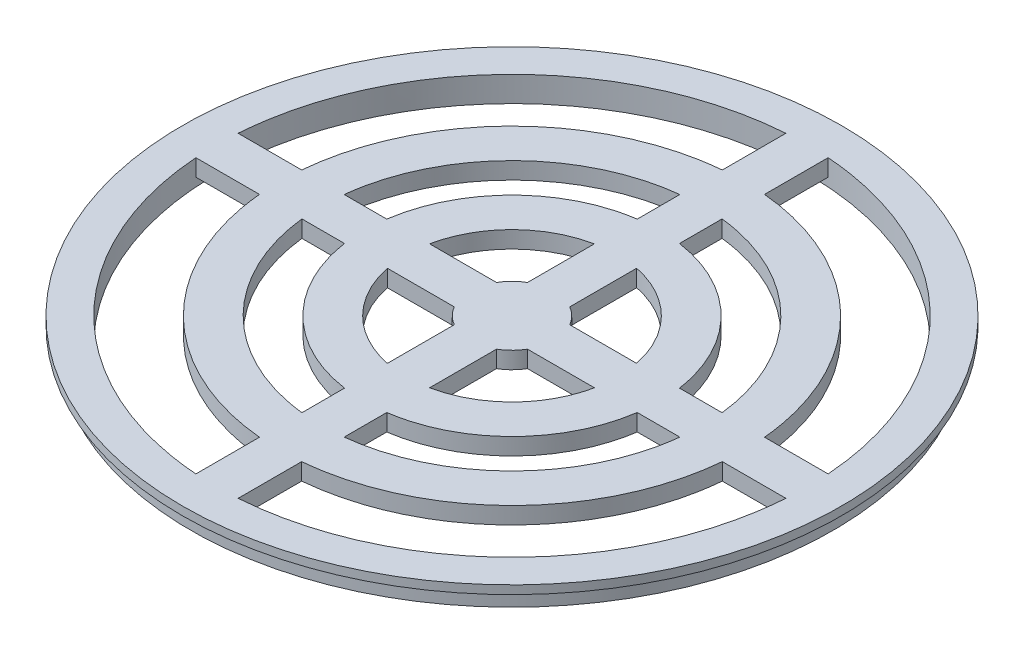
ISO-10303-21;
HEADER;
FILE_DESCRIPTION(('STEP AP214'),'2;1');
FILE_NAME('part.step','',(''),(''),'','','');
FILE_SCHEMA(('AUTOMOTIVE_DESIGN { 1 0 10303 214 1 1 1 1 }'));
ENDSEC;
DATA;
#1=APPLICATION_CONTEXT('core data for automotive mechanical design processes');
#2=APPLICATION_PROTOCOL_DEFINITION('international standard','automotive_design',2000,#1);
#3=PRODUCT_CONTEXT('',#1,'mechanical');
#4=PRODUCT('Part','Part','',(#3));
#5=PRODUCT_RELATED_PRODUCT_CATEGORY('part','',(#4));
#6=PRODUCT_DEFINITION_FORMATION('','',#4);
#7=PRODUCT_DEFINITION_CONTEXT('part definition',#1,'design');
#8=PRODUCT_DEFINITION('design','',#6,#7);
#9=PRODUCT_DEFINITION_SHAPE('','',#8);
#10=(LENGTH_UNIT() NAMED_UNIT(*) SI_UNIT(.MILLI.,.METRE.));
#11=(NAMED_UNIT(*) PLANE_ANGLE_UNIT() SI_UNIT($,.RADIAN.));
#12=(NAMED_UNIT(*) SI_UNIT($,.STERADIAN.) SOLID_ANGLE_UNIT());
#13=UNCERTAINTY_MEASURE_WITH_UNIT(LENGTH_MEASURE(1.E-05),#10,'distance_accuracy_value','');
#14=(GEOMETRIC_REPRESENTATION_CONTEXT(3) GLOBAL_UNCERTAINTY_ASSIGNED_CONTEXT((#13)) GLOBAL_UNIT_ASSIGNED_CONTEXT((#10,
#11,#12)) REPRESENTATION_CONTEXT('',''));
#15=CARTESIAN_POINT('',(0.,0.,0.));
#16=DIRECTION('',(0.,0.,1.));
#17=DIRECTION('',(1.,0.,0.));
#18=AXIS2_PLACEMENT_3D('',#15,#16,#17);
#19=CARTESIAN_POINT('',(0.,-999.,2.5));
#20=DIRECTION('',(0.,0.,1.));
#21=DIRECTION('',(1.,0.,0.));
#22=AXIS2_PLACEMENT_3D('',#19,#20,#21);
#23=PLANE('',#22);
#24=DIRECTION('',(0.,1.,0.));
#25=VECTOR('',#24,1.);
#26=CARTESIAN_POINT('',(-17.3204651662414,-4.75028988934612E-13,2.5));
#27=LINE('',#26,#25);
#28=CARTESIAN_POINT('',(-17.320545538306,0.999999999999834,2.50000002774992));
#29=VERTEX_POINT('',#28);
#30=CARTESIAN_POINT('',(-17.3204651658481,-1.,2.5));
#31=VERTEX_POINT('',#30);
#32=EDGE_CURVE('E609',#29,#31,#27,.F.);
#33=ORIENTED_EDGE('',*,*,#32,.F.);
#34=DIRECTION('',(1.,0.,0.));
#35=VECTOR('',#34,1.);
#36=CARTESIAN_POINT('',(0.,1.,2.5));
#37=LINE('',#36,#35);
#38=CARTESIAN_POINT('',(-22.3607624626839,1.00000000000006,2.50000002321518));
#39=VERTEX_POINT('',#38);
#40=EDGE_CURVE('E549',#39,#29,#37,.T.);
#41=ORIENTED_EDGE('',*,*,#40,.F.);
#42=DIRECTION('',(0.,1.,0.));
#43=VECTOR('',#42,1.);
#44=CARTESIAN_POINT('',(-22.3605944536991,-3.34568498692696E-13,2.5));
#45=LINE('',#44,#43);
#46=CARTESIAN_POINT('',(-22.3605944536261,-1.00000000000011,2.50000000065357));
#47=VERTEX_POINT('',#46);
#48=EDGE_CURVE('E705',#47,#39,#45,.T.);
#49=ORIENTED_EDGE('',*,*,#48,.F.);
#50=DIRECTION('',(-1.,0.,0.));
#51=VECTOR('',#50,1.);
#52=CARTESIAN_POINT('',(0.,-1.,2.5));
#53=LINE('',#52,#51);
#54=EDGE_CURVE('E468',#31,#47,#53,.T.);
#55=ORIENTED_EDGE('',*,*,#54,.F.);
#56=EDGE_LOOP('',(#33,#41,#49,#55));
#57=FACE_BOUND('',#56,.T.);
#58=ADVANCED_FACE('F113',(#57),#23,.T.);
#59=CARTESIAN_POINT('',(0.,-999.,-2.5));
#60=DIRECTION('',(0.,0.,-1.));
#61=DIRECTION('',(-1.,0.,0.));
#62=AXIS2_PLACEMENT_3D('',#59,#60,#61);
#63=PLANE('',#62);
#64=DIRECTION('',(0.,1.,0.));
#65=VECTOR('',#64,1.);
#66=CARTESIAN_POINT('',(-17.3204651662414,-4.75028988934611E-13,-2.5));
#67=LINE('',#66,#65);
#68=CARTESIAN_POINT('',(-17.3204651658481,-1.00000000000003,-2.50000000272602));
#69=VERTEX_POINT('',#68);
#70=CARTESIAN_POINT('',(-17.3205555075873,0.999999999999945,-2.50000002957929));
#71=VERTEX_POINT('',#70);
#72=EDGE_CURVE('E597',#69,#71,#67,.T.);
#73=ORIENTED_EDGE('',*,*,#72,.F.);
#74=DIRECTION('',(1.,0.,0.));
#75=VECTOR('',#74,1.);
#76=CARTESIAN_POINT('',(0.,-1.,-2.5));
#77=LINE('',#76,#75);
#78=CARTESIAN_POINT('',(-22.3605944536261,-1.,-2.5));
#79=VERTEX_POINT('',#78);
#80=EDGE_CURVE('E547',#79,#69,#77,.T.);
#81=ORIENTED_EDGE('',*,*,#80,.F.);
#82=DIRECTION('',(0.,1.,0.));
#83=VECTOR('',#82,1.);
#84=CARTESIAN_POINT('',(-22.3605944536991,-3.90776549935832E-13,-2.49999999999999));
#85=LINE('',#84,#83);
#86=CARTESIAN_POINT('',(-22.3607660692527,0.999999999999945,-2.50000001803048));
#87=VERTEX_POINT('',#86);
#88=EDGE_CURVE('E701',#87,#79,#85,.F.);
#89=ORIENTED_EDGE('',*,*,#88,.F.);
#90=DIRECTION('',(-1.,0.,0.));
#91=VECTOR('',#90,1.);
#92=CARTESIAN_POINT('',(0.,1.,-2.5));
#93=LINE('',#92,#91);
#94=EDGE_CURVE('E501',#71,#87,#93,.T.);
#95=ORIENTED_EDGE('',*,*,#94,.F.);
#96=EDGE_LOOP('',(#73,#81,#89,#95));
#97=FACE_BOUND('',#96,.T.);
#98=ADVANCED_FACE('F1422',(#97),#63,.T.);
#99=DIRECTION('',(0.,1.,0.));
#100=VECTOR('',#99,1.);
#101=CARTESIAN_POINT('',(17.3204651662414,-4.62691383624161E-13,2.49999999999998));
#102=LINE('',#101,#100);
#103=CARTESIAN_POINT('',(17.3204651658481,-1.00000000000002,2.50000000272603));
#104=VERTEX_POINT('',#103);
#105=CARTESIAN_POINT('',(17.3205584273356,1.,2.50000003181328));
#106=VERTEX_POINT('',#105);
#107=EDGE_CURVE('E594',#104,#106,#102,.T.);
#108=ORIENTED_EDGE('',*,*,#107,.F.);
#109=CARTESIAN_POINT('',(22.3605944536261,-1.,2.5));
#110=VERTEX_POINT('',#109);
#111=EDGE_CURVE('E462',#110,#104,#53,.T.);
#112=ORIENTED_EDGE('',*,*,#111,.F.);
#113=DIRECTION('',(0.,1.,0.));
#114=VECTOR('',#113,1.);
#115=CARTESIAN_POINT('',(22.3605944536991,-3.28669924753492E-13,2.49999999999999));
#116=LINE('',#115,#114);
#117=CARTESIAN_POINT('',(22.3607718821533,1.,2.50000002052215));
#118=VERTEX_POINT('',#117);
#119=EDGE_CURVE('E696',#118,#110,#116,.F.);
#120=ORIENTED_EDGE('',*,*,#119,.F.);
#121=EDGE_CURVE('E473',#106,#118,#37,.T.);
#122=ORIENTED_EDGE('',*,*,#121,.F.);
#123=EDGE_LOOP('',(#108,#112,#120,#122));
#124=FACE_BOUND('',#123,.T.);
#125=ADVANCED_FACE('F1424',(#124),#23,.T.);
#126=DIRECTION('',(0.,1.,0.));
#127=VECTOR('',#126,1.);
#128=CARTESIAN_POINT('',(17.3204651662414,-5.14944155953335E-13,-2.5));
#129=LINE('',#128,#127);
#130=CARTESIAN_POINT('',(17.3205426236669,0.999999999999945,-2.50000002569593));
#131=VERTEX_POINT('',#130);
#132=CARTESIAN_POINT('',(17.3204651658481,-1.,-2.5));
#133=VERTEX_POINT('',#132);
#134=EDGE_CURVE('E592',#131,#133,#129,.F.);
#135=ORIENTED_EDGE('',*,*,#134,.F.);
#136=CARTESIAN_POINT('',(22.3607566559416,0.999999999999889,-2.50000002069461));
#137=VERTEX_POINT('',#136);
#138=EDGE_CURVE('E516',#137,#131,#93,.T.);
#139=ORIENTED_EDGE('',*,*,#138,.F.);
#140=DIRECTION('',(0.,1.,0.));
#141=VECTOR('',#140,1.);
#142=CARTESIAN_POINT('',(22.3605944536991,-4.41086027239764E-13,-2.5));
#143=LINE('',#142,#141);
#144=CARTESIAN_POINT('',(22.3605944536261,-1.00000000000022,-2.50000000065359));
#145=VERTEX_POINT('',#144);
#146=EDGE_CURVE('E590',#145,#137,#143,.T.);
#147=ORIENTED_EDGE('',*,*,#146,.F.);
#148=EDGE_CURVE('E525',#133,#145,#77,.T.);
#149=ORIENTED_EDGE('',*,*,#148,.F.);
#150=EDGE_LOOP('',(#135,#139,#147,#149));
#151=FACE_BOUND('',#150,.T.);
#152=ADVANCED_FACE('F588',(#151),#63,.T.);
#153=CARTESIAN_POINT('',(2.5,-999.,0.));
#154=DIRECTION('',(1.,0.,0.));
#155=DIRECTION('',(0.,0.,-1.));
#156=AXIS2_PLACEMENT_3D('',#153,#154,#155);
#157=PLANE('',#156);
#158=DIRECTION('',(0.,1.,0.));
#159=VECTOR('',#158,1.);
#160=CARTESIAN_POINT('',(2.5,-4.05949283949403E-13,-17.3204651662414));
#161=LINE('',#160,#159);
#162=CARTESIAN_POINT('',(2.49999998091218,-0.999999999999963,-17.3204651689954));
#163=VERTEX_POINT('',#162);
#164=CARTESIAN_POINT('',(2.50000002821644,0.999999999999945,-17.3205555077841));
#165=VERTEX_POINT('',#164);
#166=EDGE_CURVE('E595',#163,#165,#161,.T.);
#167=ORIENTED_EDGE('',*,*,#166,.F.);
#168=DIRECTION('',(0.,0.,1.));
#169=VECTOR('',#168,1.);
#170=CARTESIAN_POINT('',(2.5,-1.,0.));
#171=LINE('',#170,#169);
#172=CARTESIAN_POINT('',(2.5,-1.,-22.3605944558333));
#173=VERTEX_POINT('',#172);
#174=EDGE_CURVE('E842',#173,#163,#171,.T.);
#175=ORIENTED_EDGE('',*,*,#174,.F.);
#176=DIRECTION('',(0.,1.,0.));
#177=VECTOR('',#176,1.);
#178=CARTESIAN_POINT('',(2.5,-4.3583971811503E-13,-22.3605944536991));
#179=LINE('',#178,#177);
#180=CARTESIAN_POINT('',(2.5000000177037,0.999999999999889,-22.3607660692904));
#181=VERTEX_POINT('',#180);
#182=EDGE_CURVE('E689',#181,#173,#179,.F.);
#183=ORIENTED_EDGE('',*,*,#182,.F.);
#184=DIRECTION('',(0.,0.,-1.));
#185=VECTOR('',#184,1.);
#186=CARTESIAN_POINT('',(2.5,1.,0.));
#187=LINE('',#186,#185);
#188=EDGE_CURVE('E797',#165,#181,#187,.T.);
#189=ORIENTED_EDGE('',*,*,#188,.F.);
#190=EDGE_LOOP('',(#167,#175,#183,#189));
#191=FACE_BOUND('',#190,.T.);
#192=ADVANCED_FACE('F1460',(#191),#157,.T.);
#193=CARTESIAN_POINT('',(-2.5,-999.,0.));
#194=DIRECTION('',(-1.,0.,0.));
#195=DIRECTION('',(0.,0.,1.));
#196=AXIS2_PLACEMENT_3D('',#193,#194,#195);
#197=PLANE('',#196);
#198=DIRECTION('',(0.,1.,0.));
#199=VECTOR('',#198,1.);
#200=CARTESIAN_POINT('',(-2.5,-4.20349577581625E-13,-17.3204651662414));
#201=LINE('',#200,#199);
#202=CARTESIAN_POINT('',(-2.50000002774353,0.999999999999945,-17.3205455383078));
#203=VERTEX_POINT('',#202);
#204=CARTESIAN_POINT('',(-2.5,-1.,-17.3204651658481));
#205=VERTEX_POINT('',#204);
#206=EDGE_CURVE('E599',#203,#205,#201,.F.);
#207=ORIENTED_EDGE('',*,*,#206,.F.);
#208=DIRECTION('',(0.,0.,1.));
#209=VECTOR('',#208,1.);
#210=CARTESIAN_POINT('',(-2.5,1.,0.));
#211=LINE('',#210,#209);
#212=CARTESIAN_POINT('',(-2.50000002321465,0.999999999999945,-22.3607624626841));
#213=VERTEX_POINT('',#212);
#214=EDGE_CURVE('E795',#213,#203,#211,.T.);
#215=ORIENTED_EDGE('',*,*,#214,.F.);
#216=DIRECTION('',(0.,1.,0.));
#217=VECTOR('',#216,1.);
#218=CARTESIAN_POINT('',(-2.50000000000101,-3.86379567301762E-13,-22.360594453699));
#219=LINE('',#218,#217);
#220=CARTESIAN_POINT('',(-2.50000000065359,-1.00000000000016,-22.3605944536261));
#221=VERTEX_POINT('',#220);
#222=EDGE_CURVE('E684',#221,#213,#219,.T.);
#223=ORIENTED_EDGE('',*,*,#222,.F.);
#224=DIRECTION('',(0.,0.,-1.));
#225=VECTOR('',#224,1.);
#226=CARTESIAN_POINT('',(-2.5,-1.,0.));
#227=LINE('',#226,#225);
#228=EDGE_CURVE('E789',#205,#221,#227,.T.);
#229=ORIENTED_EDGE('',*,*,#228,.F.);
#230=EDGE_LOOP('',(#207,#215,#223,#229));
#231=FACE_BOUND('',#230,.T.);
#232=ADVANCED_FACE('F1138',(#231),#197,.T.);
#233=DIRECTION('',(0.,1.,0.));
#234=VECTOR('',#233,1.);
#235=CARTESIAN_POINT('',(-2.49999999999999,-4.09103824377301E-13,17.3204651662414));
#236=LINE('',#235,#234);
#237=CARTESIAN_POINT('',(-2.50000000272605,-0.999999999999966,17.3204651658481));
#238=VERTEX_POINT('',#237);
#239=CARTESIAN_POINT('',(-2.50000002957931,0.999999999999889,17.3205555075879));
#240=VERTEX_POINT('',#239);
#241=EDGE_CURVE('E1095',#238,#240,#236,.T.);
#242=ORIENTED_EDGE('',*,*,#241,.F.);
#243=CARTESIAN_POINT('',(-2.5,-1.,22.3605944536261));
#244=VERTEX_POINT('',#243);
#245=EDGE_CURVE('E779',#244,#238,#227,.T.);
#246=ORIENTED_EDGE('',*,*,#245,.F.);
#247=DIRECTION('',(0.,1.,0.));
#248=VECTOR('',#247,1.);
#249=CARTESIAN_POINT('',(-2.50000000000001,-3.42339431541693E-13,22.3605944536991));
#250=LINE('',#249,#248);
#251=CARTESIAN_POINT('',(-2.50000001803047,1.00000000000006,22.3607660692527));
#252=VERTEX_POINT('',#251);
#253=EDGE_CURVE('E681',#252,#244,#250,.F.);
#254=ORIENTED_EDGE('',*,*,#253,.F.);
#255=EDGE_CURVE('E814',#240,#252,#211,.T.);
#256=ORIENTED_EDGE('',*,*,#255,.F.);
#257=EDGE_LOOP('',(#242,#246,#254,#256));
#258=FACE_BOUND('',#257,.T.);
#259=ADVANCED_FACE('F1410',(#258),#197,.T.);
#260=DIRECTION('',(0.,1.,0.));
#261=VECTOR('',#260,1.);
#262=CARTESIAN_POINT('',(2.50000000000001,-6.54115647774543E-13,17.3204651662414));
#263=LINE('',#262,#261);
#264=CARTESIAN_POINT('',(2.50000002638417,0.999999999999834,17.3205455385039));
#265=VERTEX_POINT('',#264);
#266=CARTESIAN_POINT('',(2.5,-1.,17.3204651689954));
#267=VERTEX_POINT('',#266);
#268=EDGE_CURVE('E124',#265,#267,#263,.F.);
#269=ORIENTED_EDGE('',*,*,#268,.F.);
#270=CARTESIAN_POINT('',(2.50000002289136,1.,22.360762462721));
#271=VERTEX_POINT('',#270);
#272=EDGE_CURVE('E828',#271,#265,#187,.T.);
#273=ORIENTED_EDGE('',*,*,#272,.F.);
#274=DIRECTION('',(0.,1.,0.));
#275=VECTOR('',#274,1.);
#276=CARTESIAN_POINT('',(2.50000000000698,-2.89505330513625E-13,22.3605944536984));
#277=LINE('',#276,#275);
#278=CARTESIAN_POINT('',(2.499999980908,-1.00000000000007,22.3605944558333));
#279=VERTEX_POINT('',#278);
#280=EDGE_CURVE('E1151',#279,#271,#277,.T.);
#281=ORIENTED_EDGE('',*,*,#280,.F.);
#282=EDGE_CURVE('E830',#267,#279,#171,.T.);
#283=ORIENTED_EDGE('',*,*,#282,.F.);
#284=EDGE_LOOP('',(#269,#273,#281,#283));
#285=FACE_BOUND('',#284,.T.);
#286=ADVANCED_FACE('F1158',(#285),#157,.T.);
#287=DIRECTION('',(0.,1.,0.));
#288=VECTOR('',#287,1.);
#289=CARTESIAN_POINT('',(-27.3860210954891,-4.38378868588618E-13,2.5));
#290=LINE('',#289,#288);
#291=CARTESIAN_POINT('',(-27.3862346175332,1.00000000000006,2.49999998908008));
#292=VERTEX_POINT('',#291);
#293=CARTESIAN_POINT('',(-27.386021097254,-1.,2.5));
#294=VERTEX_POINT('',#293);
#295=EDGE_CURVE('E759',#292,#294,#290,.F.);
#296=ORIENTED_EDGE('',*,*,#295,.F.);
#297=CARTESIAN_POINT('',(-34.9107120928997,1.00000000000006,2.49999123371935));
#298=VERTEX_POINT('',#297);
#299=EDGE_CURVE('E509',#298,#292,#37,.T.);
#300=ORIENTED_EDGE('',*,*,#299,.F.);
#301=CARTESIAN_POINT('',(-34.9104825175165,-1.,2.50000000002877));
#302=DIRECTION('',(0.,1.,0.));
#303=VECTOR('',#302,1.);
#304=LINE('',#301,#303);
#305=CARTESIAN_POINT('',(-34.9107199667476,-0.999999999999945,2.49999999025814));
#306=VERTEX_POINT('',#305);
#307=EDGE_CURVE('E1213',#306,#298,#304,.T.);
#308=ORIENTED_EDGE('',*,*,#307,.F.);
#309=EDGE_CURVE('E498',#294,#306,#53,.T.);
#310=ORIENTED_EDGE('',*,*,#309,.F.);
#311=EDGE_LOOP('',(#296,#300,#308,#310));
#312=FACE_BOUND('',#311,.T.);
#313=ADVANCED_FACE('F1388',(#312),#23,.T.);
#314=DIRECTION('',(0.,1.,0.));
#315=VECTOR('',#314,1.);
#316=CARTESIAN_POINT('',(-27.3860210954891,-3.42807083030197E-13,-2.50000000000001));
#317=LINE('',#316,#315);
#318=CARTESIAN_POINT('',(-27.386021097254,-1.00000000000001,-2.49999998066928));
#319=VERTEX_POINT('',#318);
#320=CARTESIAN_POINT('',(-27.3862326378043,1.00000000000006,-2.49999998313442));
#321=VERTEX_POINT('',#320);
#322=EDGE_CURVE('E755',#319,#321,#317,.T.);
#323=ORIENTED_EDGE('',*,*,#322,.F.);
#324=CARTESIAN_POINT('',(-34.9107142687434,-0.999999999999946,-2.49998356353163));
#325=VERTEX_POINT('',#324);
#326=EDGE_CURVE('E541',#325,#319,#77,.T.);
#327=ORIENTED_EDGE('',*,*,#326,.F.);
#328=CARTESIAN_POINT('',(-34.9104825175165,0.999999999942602,-2.50000000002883));
#329=DIRECTION('',(0.,-1.,0.));
#330=VECTOR('',#329,1.);
#331=LINE('',#328,#330);
#332=CARTESIAN_POINT('',(-34.910705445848,1.00000000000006,-2.49999148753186));
#333=VERTEX_POINT('',#332);
#334=EDGE_CURVE('E1208',#325,#333,#331,.F.);
#335=ORIENTED_EDGE('',*,*,#334,.T.);
#336=EDGE_CURVE('E504',#321,#333,#93,.T.);
#337=ORIENTED_EDGE('',*,*,#336,.F.);
#338=EDGE_LOOP('',(#323,#327,#335,#337));
#339=FACE_BOUND('',#338,.T.);
#340=ADVANCED_FACE('F1405',(#339),#63,.T.);
#341=DIRECTION('',(0.,1.,0.));
#342=VECTOR('',#341,1.);
#343=CARTESIAN_POINT('',(27.3860210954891,-6.5219948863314E-13,2.49999999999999));
#344=LINE('',#343,#342);
#345=CARTESIAN_POINT('',(27.386021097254,-1.00000000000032,2.49999998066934));
#346=VERTEX_POINT('',#345);
#347=CARTESIAN_POINT('',(27.3862399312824,0.999999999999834,2.49999998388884));
#348=VERTEX_POINT('',#347);
#349=EDGE_CURVE('E751',#346,#348,#344,.T.);
#350=ORIENTED_EDGE('',*,*,#349,.F.);
#351=CARTESIAN_POINT('',(34.9107219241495,-0.999999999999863,2.49998302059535));
#352=VERTEX_POINT('',#351);
#353=EDGE_CURVE('E466',#352,#346,#53,.T.);
#354=ORIENTED_EDGE('',*,*,#353,.F.);
#355=CARTESIAN_POINT('',(34.9104825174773,1.00000000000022,2.50000000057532));
#356=DIRECTION('',(0.,-1.,0.));
#357=VECTOR('',#356,1.);
#358=LINE('',#355,#357);
#359=CARTESIAN_POINT('',(34.9107128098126,1.00000000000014,2.4999912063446));
#360=VERTEX_POINT('',#359);
#361=EDGE_CURVE('E1389',#352,#360,#358,.F.);
#362=ORIENTED_EDGE('',*,*,#361,.T.);
#363=EDGE_CURVE('E561',#348,#360,#37,.T.);
#364=ORIENTED_EDGE('',*,*,#363,.F.);
#365=EDGE_LOOP('',(#350,#354,#362,#364));
#366=FACE_BOUND('',#365,.T.);
#367=ADVANCED_FACE('F1441',(#366),#23,.T.);
#368=DIRECTION('',(0.,1.,0.));
#369=VECTOR('',#368,1.);
#370=CARTESIAN_POINT('',(27.3860210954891,-4.09581717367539E-13,-2.5));
#371=LINE('',#370,#369);
#372=CARTESIAN_POINT('',(27.3862273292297,0.999999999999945,-2.49999998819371));
#373=VERTEX_POINT('',#372);
#374=CARTESIAN_POINT('',(27.386021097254,-1.,-2.5));
#375=VERTEX_POINT('',#374);
#376=EDGE_CURVE('E746',#373,#375,#371,.F.);
#377=ORIENTED_EDGE('',*,*,#376,.F.);
#378=CARTESIAN_POINT('',(34.9107043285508,1.00000000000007,-2.49999153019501));
#379=VERTEX_POINT('',#378);
#380=EDGE_CURVE('E485',#379,#373,#93,.T.);
#381=ORIENTED_EDGE('',*,*,#380,.F.);
#382=CARTESIAN_POINT('',(34.9104825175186,-1.,-2.49999999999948));
#383=DIRECTION('',(0.,1.,0.));
#384=VECTOR('',#383,1.);
#385=LINE('',#382,#384);
#386=CARTESIAN_POINT('',(34.9107119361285,-0.999999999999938,-2.49999999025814));
#387=VERTEX_POINT('',#386);
#388=EDGE_CURVE('E1214',#387,#379,#385,.T.);
#389=ORIENTED_EDGE('',*,*,#388,.F.);
#390=EDGE_CURVE('E528',#375,#387,#77,.T.);
#391=ORIENTED_EDGE('',*,*,#390,.F.);
#392=EDGE_LOOP('',(#377,#381,#389,#391));
#393=FACE_BOUND('',#392,.T.);
#394=ADVANCED_FACE('F1399',(#393),#63,.T.);
#395=DIRECTION('',(0.,1.,0.));
#396=VECTOR('',#395,1.);
#397=CARTESIAN_POINT('',(2.5,-4.84990097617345E-13,-27.3860210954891));
#398=LINE('',#397,#396);
#399=CARTESIAN_POINT('',(2.4999999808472,-1.00000000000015,-27.3860210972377));
#400=VERTEX_POINT('',#399);
#401=CARTESIAN_POINT('',(2.49999998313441,0.999999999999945,-27.3862326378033));
#402=VERTEX_POINT('',#401);
#403=EDGE_CURVE('E742',#400,#402,#398,.T.);
#404=ORIENTED_EDGE('',*,*,#403,.F.);
#405=CARTESIAN_POINT('',(2.49998356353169,-1.00000000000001,-34.9107142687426));
#406=VERTEX_POINT('',#405);
#407=EDGE_CURVE('E482',#406,#400,#171,.T.);
#408=ORIENTED_EDGE('',*,*,#407,.F.);
#409=CARTESIAN_POINT('',(2.49999999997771,1.00000000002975,-34.9104825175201));
#410=DIRECTION('',(0.,-1.,0.));
#411=VECTOR('',#410,1.);
#412=LINE('',#409,#411);
#413=CARTESIAN_POINT('',(2.49999148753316,0.999999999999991,-34.9107054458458));
#414=VERTEX_POINT('',#413);
#415=EDGE_CURVE('E1303',#406,#414,#412,.F.);
#416=ORIENTED_EDGE('',*,*,#415,.T.);
#417=EDGE_CURVE('E764',#402,#414,#187,.T.);
#418=ORIENTED_EDGE('',*,*,#417,.F.);
#419=EDGE_LOOP('',(#404,#408,#416,#418));
#420=FACE_BOUND('',#419,.T.);
#421=ADVANCED_FACE('F1403',(#420),#157,.T.);
#422=DIRECTION('',(0.,1.,0.));
#423=VECTOR('',#422,1.);
#424=CARTESIAN_POINT('',(-2.5,-3.43476572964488E-13,-27.3860210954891));
#425=LINE('',#424,#423);
#426=CARTESIAN_POINT('',(-2.49999998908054,1.00000000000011,-27.3862346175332));
#427=VERTEX_POINT('',#426);
#428=CARTESIAN_POINT('',(-2.5,-1.,-27.386021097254));
#429=VERTEX_POINT('',#428);
#430=EDGE_CURVE('E738',#427,#429,#425,.F.);
#431=ORIENTED_EDGE('',*,*,#430,.F.);
#432=CARTESIAN_POINT('',(-2.49999123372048,1.00000000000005,-34.9107120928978));
#433=VERTEX_POINT('',#432);
#434=EDGE_CURVE('E801',#433,#427,#211,.T.);
#435=ORIENTED_EDGE('',*,*,#434,.F.);
#436=CARTESIAN_POINT('',(-2.49999999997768,-1.,-34.9104825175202));
#437=DIRECTION('',(0.,1.,0.));
#438=VECTOR('',#437,1.);
#439=LINE('',#436,#438);
#440=CARTESIAN_POINT('',(-2.50000000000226,-0.999999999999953,-34.9107199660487));
#441=VERTEX_POINT('',#440);
#442=EDGE_CURVE('E1313',#441,#433,#439,.T.);
#443=ORIENTED_EDGE('',*,*,#442,.F.);
#444=EDGE_CURVE('E783',#429,#441,#227,.T.);
#445=ORIENTED_EDGE('',*,*,#444,.F.);
#446=EDGE_LOOP('',(#431,#435,#443,#445));
#447=FACE_BOUND('',#446,.T.);
#448=ADVANCED_FACE('F1407',(#447),#197,.T.);
#449=DIRECTION('',(0.,1.,0.));
#450=VECTOR('',#449,1.);
#451=CARTESIAN_POINT('',(-2.5,-4.02177305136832E-13,27.3860210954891));
#452=LINE('',#451,#450);
#453=CARTESIAN_POINT('',(-2.4999999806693,-1.00000000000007,27.386021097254));
#454=VERTEX_POINT('',#453);
#455=CARTESIAN_POINT('',(-2.49999998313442,0.999999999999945,27.3862326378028));
#456=VERTEX_POINT('',#455);
#457=EDGE_CURVE('E709',#454,#456,#452,.T.);
#458=ORIENTED_EDGE('',*,*,#457,.F.);
#459=CARTESIAN_POINT('',(-2.49998354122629,-0.999999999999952,34.9107145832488));
#460=VERTEX_POINT('',#459);
#461=EDGE_CURVE('E773',#460,#454,#227,.T.);
#462=ORIENTED_EDGE('',*,*,#461,.F.);
#463=CARTESIAN_POINT('',(-2.49999999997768,0.99999999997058,34.9104825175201));
#464=DIRECTION('',(0.,-1.,0.));
#465=VECTOR('',#464,1.);
#466=LINE('',#463,#465);
#467=CARTESIAN_POINT('',(-2.49999147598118,1.00000000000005,34.9107057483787));
#468=VERTEX_POINT('',#467);
#469=EDGE_CURVE('E1351',#460,#468,#466,.F.);
#470=ORIENTED_EDGE('',*,*,#469,.T.);
#471=EDGE_CURVE('E810',#456,#468,#211,.T.);
#472=ORIENTED_EDGE('',*,*,#471,.F.);
#473=EDGE_LOOP('',(#458,#462,#470,#472));
#474=FACE_BOUND('',#473,.T.);
#475=ADVANCED_FACE('F1409',(#474),#197,.T.);
#476=DIRECTION('',(0.,1.,0.));
#477=VECTOR('',#476,1.);
#478=CARTESIAN_POINT('',(2.5,-4.9221662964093E-13,27.3860210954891));
#479=LINE('',#478,#477);
#480=CARTESIAN_POINT('',(2.49999998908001,0.999999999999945,27.3862346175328));
#481=VERTEX_POINT('',#480);
#482=CARTESIAN_POINT('',(2.5,-1.,27.3860210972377));
#483=VERTEX_POINT('',#482);
#484=EDGE_CURVE('E824',#481,#483,#479,.F.);
#485=ORIENTED_EDGE('',*,*,#484,.F.);
#486=CARTESIAN_POINT('',(2.4999912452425,1.00000000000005,34.9107117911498));
#487=VERTEX_POINT('',#486);
#488=EDGE_CURVE('E769',#487,#481,#187,.T.);
#489=ORIENTED_EDGE('',*,*,#488,.F.);
#490=CARTESIAN_POINT('',(2.49999999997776,-1.,34.9104825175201));
#491=DIRECTION('',(0.,1.,0.));
#492=VECTOR('',#491,1.);
#493=LINE('',#490,#492);
#494=CARTESIAN_POINT('',(2.50000000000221,-0.999999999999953,34.9107196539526));
#495=VERTEX_POINT('',#494);
#496=EDGE_CURVE('E1340',#495,#487,#493,.T.);
#497=ORIENTED_EDGE('',*,*,#496,.F.);
#498=EDGE_CURVE('E856',#483,#495,#171,.T.);
#499=ORIENTED_EDGE('',*,*,#498,.F.);
#500=EDGE_LOOP('',(#485,#489,#497,#499));
#501=FACE_BOUND('',#500,.T.);
#502=ADVANCED_FACE('F1415',(#501),#157,.T.);
#503=DIRECTION('',(0.,1.,0.));
#504=VECTOR('',#503,1.);
#505=CARTESIAN_POINT('',(-4.33010919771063,-6.1953225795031E-13,2.5));
#506=LINE('',#505,#504);
#507=CARTESIAN_POINT('',(-4.33013997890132,0.999999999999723,2.50000001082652));
#508=VERTEX_POINT('',#507);
#509=CARTESIAN_POINT('',(-4.33010919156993,-0.999999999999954,2.50000001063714));
#510=VERTEX_POINT('',#509);
#511=EDGE_CURVE('E1503',#508,#510,#506,.F.);
#512=ORIENTED_EDGE('',*,*,#511,.F.);
#513=CARTESIAN_POINT('',(-12.2474504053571,1.00000000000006,2.50000045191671));
#514=VERTEX_POINT('',#513);
#515=EDGE_CURVE('E505',#514,#508,#37,.T.);
#516=ORIENTED_EDGE('',*,*,#515,.F.);
#517=DIRECTION('',(0.,1.,0.));
#518=VECTOR('',#517,1.);
#519=CARTESIAN_POINT('',(-12.2474482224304,-4.07011075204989E-13,2.50000000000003));
#520=LINE('',#519,#518);
#521=CARTESIAN_POINT('',(-12.2474482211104,-1.00000000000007,2.5000000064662));
#522=VERTEX_POINT('',#521);
#523=EDGE_CURVE('E1091',#522,#514,#520,.T.);
#524=ORIENTED_EDGE('',*,*,#523,.F.);
#525=EDGE_CURVE('E463',#510,#522,#53,.T.);
#526=ORIENTED_EDGE('',*,*,#525,.F.);
#527=EDGE_LOOP('',(#512,#516,#524,#526));
#528=FACE_BOUND('',#527,.T.);
#529=ADVANCED_FACE('F1433',(#528),#23,.T.);
#530=DIRECTION('',(0.,1.,0.));
#531=VECTOR('',#530,1.);
#532=CARTESIAN_POINT('',(-4.33010919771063,-4.14618886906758E-13,-2.5));
#533=LINE('',#532,#531);
#534=CARTESIAN_POINT('',(-4.33010919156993,-0.999999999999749,-2.50000001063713));
#535=VERTEX_POINT('',#534);
#536=CARTESIAN_POINT('',(-4.33014929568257,0.999999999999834,-2.50000001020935));
#537=VERTEX_POINT('',#536);
#538=EDGE_CURVE('E454',#535,#537,#533,.T.);
#539=ORIENTED_EDGE('',*,*,#538,.F.);
#540=CARTESIAN_POINT('',(-12.2474482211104,-1.,-2.5));
#541=VERTEX_POINT('',#540);
#542=EDGE_CURVE('E476',#541,#535,#77,.T.);
#543=ORIENTED_EDGE('',*,*,#542,.F.);
#544=DIRECTION('',(0.,1.,0.));
#545=VECTOR('',#544,1.);
#546=CARTESIAN_POINT('',(-12.2474482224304,-4.26965337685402E-13,-2.5));
#547=LINE('',#546,#545);
#548=CARTESIAN_POINT('',(-12.2474479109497,0.999999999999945,-2.49999994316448));
#549=VERTEX_POINT('',#548);
#550=EDGE_CURVE('E1086',#549,#541,#547,.F.);
#551=ORIENTED_EDGE('',*,*,#550,.F.);
#552=EDGE_CURVE('E503',#537,#549,#93,.T.);
#553=ORIENTED_EDGE('',*,*,#552,.F.);
#554=EDGE_LOOP('',(#539,#543,#551,#553));
#555=FACE_BOUND('',#554,.T.);
#556=ADVANCED_FACE('F1438',(#555),#63,.T.);
#557=CARTESIAN_POINT('',(0.,1.,0.));
#558=DIRECTION('',(0.,-1.,0.));
#559=DIRECTION('',(0.,0.,-1.));
#560=AXIS2_PLACEMENT_3D('',#557,#558,#559);
#561=CYLINDRICAL_SURFACE('',#560,39.);
#562=CARTESIAN_POINT('',(0.,1.,0.));
#563=DIRECTION('',(0.,1.,0.));
#564=DIRECTION('',(0.,0.,1.));
#565=AXIS2_PLACEMENT_3D('',#562,#563,#564);
#566=CIRCLE('',#565,39.);
#567=CARTESIAN_POINT('',(0.,1.,39.));
#568=VERTEX_POINT('',#567);
#569=EDGE_CURVE('E1255',#568,#568,#566,.T.);
#570=ORIENTED_EDGE('',*,*,#569,.F.);
#571=EDGE_LOOP('',(#570));
#572=FACE_BOUND('',#571,.T.);
#573=CARTESIAN_POINT('',(0.,0.,0.));
#574=DIRECTION('',(0.,1.,0.));
#575=DIRECTION('',(0.,0.,1.));
#576=AXIS2_PLACEMENT_3D('',#573,#574,#575);
#577=CIRCLE('',#576,39.);
#578=CARTESIAN_POINT('',(0.,0.,39.));
#579=VERTEX_POINT('',#578);
#580=EDGE_CURVE('E1251',#579,#579,#577,.T.);
#581=ORIENTED_EDGE('',*,*,#580,.T.);
#582=EDGE_LOOP('',(#581));
#583=FACE_BOUND('',#582,.T.);
#584=ADVANCED_FACE('F115',(#572,#583),#561,.T.);
#585=CARTESIAN_POINT('',(0.,1.,0.));
#586=DIRECTION('',(0.,1.,0.));
#587=DIRECTION('',(0.,0.,1.));
#588=AXIS2_PLACEMENT_3D('',#585,#586,#587);
#589=PLANE('',#588);
#590=ORIENTED_EDGE('',*,*,#515,.T.);
#591=CARTESIAN_POINT('',(-2.49998264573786,0.99999999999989,4.33011921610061));
#592=CARTESIAN_POINT('',(-2.54721854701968,0.999999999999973,4.30285067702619));
#593=CARTESIAN_POINT('',(-2.59400887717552,0.999999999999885,4.27480998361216));
#594=CARTESIAN_POINT('',(-2.6866463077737,0.999999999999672,4.21721214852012));
#595=CARTESIAN_POINT('',(-2.73249341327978,0.999999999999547,4.18765501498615));
#596=CARTESIAN_POINT('',(-2.82319281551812,0.999999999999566,4.12705186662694));
#597=CARTESIAN_POINT('',(-2.86804511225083,0.99999999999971,4.09600585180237));
#598=CARTESIAN_POINT('',(-2.9567095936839,0.999999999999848,4.03246213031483));
#599=CARTESIAN_POINT('',(-3.00052177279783,0.999999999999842,3.99996441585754));
#600=CARTESIAN_POINT('',(-3.08706084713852,0.999999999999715,3.9335543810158));
#601=CARTESIAN_POINT('',(-3.12978773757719,0.999999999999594,3.8996420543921));
#602=CARTESIAN_POINT('',(-3.21411102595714,0.99999999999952,3.8304398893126));
#603=CARTESIAN_POINT('',(-3.25570742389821,0.999999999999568,3.79515005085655));
#604=CARTESIAN_POINT('',(-3.33772451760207,0.999999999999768,3.72322995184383));
#605=CARTESIAN_POINT('',(-3.37814521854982,0.999999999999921,3.68659969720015));
#606=CARTESIAN_POINT('',(-3.457765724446,0.999999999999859,3.61203583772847));
#607=CARTESIAN_POINT('',(-3.49696553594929,0.999999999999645,3.57410223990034));
#608=CARTESIAN_POINT('',(-3.57409898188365,0.999999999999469,3.49696886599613));
#609=CARTESIAN_POINT('',(-3.61203261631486,0.999999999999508,3.45776908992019));
#610=CARTESIAN_POINT('',(-3.6865965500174,0.999999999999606,3.37814865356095));
#611=CARTESIAN_POINT('',(-3.72322684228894,0.999999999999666,3.33772798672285));
#612=CARTESIAN_POINT('',(-3.79514701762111,0.99999999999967,3.25571095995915));
#613=CARTESIAN_POINT('',(-3.83043689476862,0.999999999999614,3.21411459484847));
#614=CARTESIAN_POINT('',(-3.89963913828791,0.999999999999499,3.12979137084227));
#615=CARTESIAN_POINT('',(-3.93355150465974,0.99999999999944,3.0870645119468));
#616=CARTESIAN_POINT('',(-3.99996162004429,0.999999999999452,3.00052549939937));
#617=CARTESIAN_POINT('',(-4.03245937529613,0.999999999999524,2.95671335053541));
#618=CARTESIAN_POINT('',(-4.09600317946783,0.99999999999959,2.86804892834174));
#619=CARTESIAN_POINT('',(-4.12704923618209,0.999999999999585,2.82319666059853));
#620=CARTESIAN_POINT('',(-4.18765246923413,0.999999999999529,2.73249731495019));
#621=CARTESIAN_POINT('',(-4.21720964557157,0.999999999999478,2.68665023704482));
#622=CARTESIAN_POINT('',(-4.27480756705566,0.999999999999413,2.59401286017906));
#623=CARTESIAN_POINT('',(-4.30284830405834,0.9999999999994,2.54722255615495));
#624=CARTESIAN_POINT('',(-4.33011688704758,0.999999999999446,2.49998668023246));
#625=B_SPLINE_CURVE_WITH_KNOTS('',3,(#591,#592,#593,#594,#595,#596,#597,#598,#599,#600,#601,
#602,#603,#604,#605,#606,#607,#608,#609,#610,#611,#612,#613,#614,#615,#616,#617,#618,#619,#620,
#621,#622,#623,#624),.UNSPECIFIED.,.F.,.F.,(4,2,2,2,2,2,2,2,2,2,2,2,2,2,2,2,4),(0.,
0.163618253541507,0.327235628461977,0.490853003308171,0.654471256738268,0.818090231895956,
0.981709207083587,1.14532746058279,1.30894483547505,1.47256221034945,1.63618046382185,
1.79979943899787,1.96341841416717,2.12703666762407,2.29065404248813,2.45427141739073,
2.61788967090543),.UNSPECIFIED.);
#626=CARTESIAN_POINT('',(-2.50000001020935,0.999999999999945,4.33014929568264));
#627=VERTEX_POINT('',#626);
#628=EDGE_CURVE('E1573',#508,#627,#625,.F.);
#629=ORIENTED_EDGE('',*,*,#628,.T.);
#630=CARTESIAN_POINT('',(-2.49999993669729,1.,12.2474479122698));
#631=VERTEX_POINT('',#630);
#632=EDGE_CURVE('E796',#627,#631,#211,.T.);
#633=ORIENTED_EDGE('',*,*,#632,.T.);
#634=CARTESIAN_POINT('',(-12.2474482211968,1.00000000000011,2.50000000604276));
#635=CARTESIAN_POINT('',(-12.2170273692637,1.0000000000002,2.64901978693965));
#636=CARTESIAN_POINT('',(-12.1838793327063,1.00000000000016,2.79748231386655));
#637=CARTESIAN_POINT('',(-12.1121876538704,1.00000000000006,3.093099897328));
#638=CARTESIAN_POINT('',(-12.0736439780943,0.999999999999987,3.24025494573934));
#639=CARTESIAN_POINT('',(-11.991220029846,1.00000000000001,3.53306322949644));
#640=CARTESIAN_POINT('',(-11.9473397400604,1.00000000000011,3.67871645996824));
#641=CARTESIAN_POINT('',(-11.8543011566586,1.00000000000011,3.96832694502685));
#642=CARTESIAN_POINT('',(-11.8051428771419,1.00000000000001,4.11228420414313));
#643=CARTESIAN_POINT('',(-11.7016080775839,0.999999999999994,4.39830903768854));
#644=CARTESIAN_POINT('',(-11.64723158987,1.00000000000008,4.54037662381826));
#645=CARTESIAN_POINT('',(-11.5333157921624,1.00000000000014,4.82242633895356));
#646=CARTESIAN_POINT('',(-11.473776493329,1.00000000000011,4.96240847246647));
#647=CARTESIAN_POINT('',(-11.3496233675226,1.00000000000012,5.24010469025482));
#648=CARTESIAN_POINT('',(-11.2850095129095,1.00000000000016,5.37781876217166));
#649=CARTESIAN_POINT('',(-11.150804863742,1.00000000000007,5.65080087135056));
#650=CARTESIAN_POINT('',(-11.0812140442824,0.999999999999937,5.78606889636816));
#651=CARTESIAN_POINT('',(-10.9371503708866,0.999999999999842,6.05397965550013));
#652=CARTESIAN_POINT('',(-10.8626775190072,0.999999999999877,6.18662239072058));
#653=CARTESIAN_POINT('',(-10.7089462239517,0.999999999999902,6.44910419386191));
#654=CARTESIAN_POINT('',(-10.6296878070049,0.999999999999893,6.5789432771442));
#655=CARTESIAN_POINT('',(-10.4664782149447,0.999999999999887,6.8356370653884));
#656=CARTESIAN_POINT('',(-10.3825270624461,0.999999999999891,6.96249178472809));
#657=CARTESIAN_POINT('',(-10.2100398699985,0.999999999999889,7.21304533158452));
#658=CARTESIAN_POINT('',(-10.121503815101,0.999999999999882,7.33674414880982));
#659=CARTESIAN_POINT('',(-9.93997918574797,0.999999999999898,7.58083142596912));
#660=CARTESIAN_POINT('',(-9.84699058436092,0.99999999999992,7.70121986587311));
#661=CARTESIAN_POINT('',(-9.65668856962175,0.99999999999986,7.93852897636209));
#662=CARTESIAN_POINT('',(-9.55937514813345,0.999999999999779,8.05544964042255));
#663=CARTESIAN_POINT('',(-9.36055242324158,0.999999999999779,8.28566652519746));
#664=CARTESIAN_POINT('',(-9.25904313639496,0.999999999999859,8.39896276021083));
#665=CARTESIAN_POINT('',(-9.05195719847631,0.99999999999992,8.6217739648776));
#666=CARTESIAN_POINT('',(-8.94638057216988,0.999999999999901,8.73128895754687));
#667=CARTESIAN_POINT('',(-8.73128895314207,0.999999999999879,8.94638057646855));
#668=CARTESIAN_POINT('',(-8.6217739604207,0.999999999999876,9.05195720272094));
#669=CARTESIAN_POINT('',(-8.3989627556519,0.999999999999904,9.25904314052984));
#670=CARTESIAN_POINT('',(-8.28566652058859,0.999999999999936,9.36055242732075));
#671=CARTESIAN_POINT('',(-8.05544963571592,0.999999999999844,9.55937515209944));
#672=CARTESIAN_POINT('',(-7.93852897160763,0.999999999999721,9.65668857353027));
#673=CARTESIAN_POINT('',(-7.7012198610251,0.999999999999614,9.84699058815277));
#674=CARTESIAN_POINT('',(-7.5808314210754,0.99999999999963,9.93997918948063));
#675=CARTESIAN_POINT('',(-7.33674414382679,0.999999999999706,10.1215038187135));
#676=CARTESIAN_POINT('',(-7.21304532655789,0.999999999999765,10.2100398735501));
#677=CARTESIAN_POINT('',(-6.96249177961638,0.999999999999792,10.3825270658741));
#678=CARTESIAN_POINT('',(-6.83563706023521,0.99999999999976,10.46647821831));
#679=CARTESIAN_POINT('',(-6.57894327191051,0.999999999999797,10.6296878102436));
#680=CARTESIAN_POINT('',(-6.44910418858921,0.999999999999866,10.7089462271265));
#681=CARTESIAN_POINT('',(-6.18662238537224,0.999999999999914,10.862677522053));
#682=CARTESIAN_POINT('',(-6.05397965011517,0.999999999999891,10.9371503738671));
#683=CARTESIAN_POINT('',(-5.78606889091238,0.999999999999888,11.0812140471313));
#684=CARTESIAN_POINT('',(-5.65080086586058,0.999999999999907,11.1508048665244));
#685=CARTESIAN_POINT('',(-5.37781875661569,0.999999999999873,11.2850095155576));
#686=CARTESIAN_POINT('',(-5.24010468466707,0.999999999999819,11.3496233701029));
#687=CARTESIAN_POINT('',(-4.96240846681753,0.999999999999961,11.4737764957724));
#688=CARTESIAN_POINT('',(-4.82242633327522,1.00000000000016,11.5333157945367));
#689=CARTESIAN_POINT('',(-4.54037661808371,1.00000000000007,11.6472315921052));
#690=CARTESIAN_POINT('',(-4.39830903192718,0.999999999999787,11.701608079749));
#691=CARTESIAN_POINT('',(-4.11228419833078,0.99999999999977,11.8051428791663));
#692=CARTESIAN_POINT('',(-3.96832693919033,1.00000000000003,11.8543011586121));
#693=CARTESIAN_POINT('',(-3.67871645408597,1.00000000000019,11.9473397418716));
#694=CARTESIAN_POINT('',(-3.5330632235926,1.00000000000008,11.9912200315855));
#695=CARTESIAN_POINT('',(-3.240254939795,0.999999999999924,12.0736439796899));
#696=CARTESIAN_POINT('',(-3.09309989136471,0.999999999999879,12.1121876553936));
#697=CARTESIAN_POINT('',(-2.79748230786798,0.999999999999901,12.183879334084));
#698=CARTESIAN_POINT('',(-2.64901978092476,0.999999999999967,12.2170273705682));
#699=CARTESIAN_POINT('',(-2.50000000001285,1.00000000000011,12.2474482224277));
#700=B_SPLINE_CURVE_WITH_KNOTS('',3,(#634,#635,#636,#637,#638,#639,#640,#641,#642,#643,#644,
#645,#646,#647,#648,#649,#650,#651,#652,#653,#654,#655,#656,#657,#658,#659,#660,#661,#662,#663,
#664,#665,#666,#667,#668,#669,#670,#671,#672,#673,#674,#675,#676,#677,#678,#679,#680,#681,#682,
#683,#684,#685,#686,#687,#688,#689,#690,#691,#692,#693,#694,#695,#696,#697,#698,#699),
.UNSPECIFIED.,.F.,.F.,(4,2,2,2,2,2,2,2,2,2,2,2,2,2,2,2,2,2,2,2,2,2,2,2,2,2,2,2,2,2,2,2,4),(0.,
0.456253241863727,0.912509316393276,1.36876687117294,1.8250232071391,2.28127671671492,
2.73752924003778,3.19378424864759,3.65004154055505,4.10629864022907,4.56255323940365,
5.01880564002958,5.47505952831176,5.93131617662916,6.38757368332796,6.8438293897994,
7.30008231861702,7.75633524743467,8.21259095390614,8.66884846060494,9.12510510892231,
9.58135899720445,10.0376113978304,10.493865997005,10.9501230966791,11.4063803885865,
11.8626353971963,12.3188879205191,12.775141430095,13.2313977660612,13.6876553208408,
14.1439113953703,14.600164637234),.UNSPECIFIED.);
#701=EDGE_CURVE('E1491',#631,#514,#700,.F.);
#702=ORIENTED_EDGE('',*,*,#701,.T.);
#703=EDGE_LOOP('',(#590,#629,#633,#702));
#704=FACE_BOUND('',#703,.T.);
#705=CARTESIAN_POINT('',(-4.33011921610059,0.999999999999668,-2.4999826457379));
#706=CARTESIAN_POINT('',(-4.30285067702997,0.999999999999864,-2.54721854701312));
#707=CARTESIAN_POINT('',(-4.27480998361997,0.999999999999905,-2.5940088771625));
#708=CARTESIAN_POINT('',(-4.21721214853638,0.999999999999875,-2.68664630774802));
#709=CARTESIAN_POINT('',(-4.18765501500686,0.999999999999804,-2.7324934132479));
#710=CARTESIAN_POINT('',(-4.12705186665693,0.999999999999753,-2.82319281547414));
#711=CARTESIAN_POINT('',(-4.0960058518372,0.999999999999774,-2.86804511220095));
#712=CARTESIAN_POINT('',(-4.03246213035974,0.999999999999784,-2.95670959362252));
#713=CARTESIAN_POINT('',(-3.99996441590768,0.999999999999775,-3.00052177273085));
#714=CARTESIAN_POINT('',(-3.93355438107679,0.999999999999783,-3.08706084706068));
#715=CARTESIAN_POINT('',(-3.89964205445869,0.999999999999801,-3.12978773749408));
#716=CARTESIAN_POINT('',(-3.83043988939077,0.999999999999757,-3.21411102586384));
#717=CARTESIAN_POINT('',(-3.79515005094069,0.999999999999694,-3.25570742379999));
#718=CARTESIAN_POINT('',(-3.72322995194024,0.999999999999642,-3.33772451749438));
#719=CARTESIAN_POINT('',(-3.68659969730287,0.999999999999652,-3.37814521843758));
#720=CARTESIAN_POINT('',(-3.61203583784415,0.999999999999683,-3.45776572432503));
#721=CARTESIAN_POINT('',(-3.57410224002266,0.999999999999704,-3.49696553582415));
#722=CARTESIAN_POINT('',(-3.49696886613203,0.999999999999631,-3.57409898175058));
#723=CARTESIAN_POINT('',(-3.45776909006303,0.999999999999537,-3.61203261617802));
#724=CARTESIAN_POINT('',(-3.37814865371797,0.999999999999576,-3.68659654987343));
#725=CARTESIAN_POINT('',(-3.33772798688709,0.99999999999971,-3.72322684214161));
#726=CARTESIAN_POINT('',(-3.25571096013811,0.999999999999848,-3.79514701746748));
#727=CARTESIAN_POINT('',(-3.21411459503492,0.999999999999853,-3.83043689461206));
#728=CARTESIAN_POINT('',(-3.12979137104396,0.999999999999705,-3.89963913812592));
#729=CARTESIAN_POINT('',(-3.08706451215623,0.999999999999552,-3.93355150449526));
#730=CARTESIAN_POINT('',(-3.00052549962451,0.999999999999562,-3.99996161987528));
#731=CARTESIAN_POINT('',(-2.95671335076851,0.999999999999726,-4.03245937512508));
#732=CARTESIAN_POINT('',(-2.86804892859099,0.999999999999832,-4.09600317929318));
#733=CARTESIAN_POINT('',(-2.82319666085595,0.999999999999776,-4.12704923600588));
#734=CARTESIAN_POINT('',(-2.73249731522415,0.999999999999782,-4.18765246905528));
#735=CARTESIAN_POINT('',(-2.68665023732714,0.999999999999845,-4.21720964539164));
#736=CARTESIAN_POINT('',(-2.59401286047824,0.999999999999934,-4.27480756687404));
#737=CARTESIAN_POINT('',(-2.54722255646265,0.999999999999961,-4.30284830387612));
#738=CARTESIAN_POINT('',(-2.49998668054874,0.99999999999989,-4.330116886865));
#739=B_SPLINE_CURVE_WITH_KNOTS('',3,(#705,#706,#707,#708,#709,#710,#711,#712,#713,#714,#715,
#716,#717,#718,#719,#720,#721,#722,#723,#724,#725,#726,#727,#728,#729,#730,#731,#732,#733,#734,
#735,#736,#737,#738),.UNSPECIFIED.,.F.,.F.,(4,2,2,2,2,2,2,2,2,2,2,2,2,2,2,2,4),(0.,
0.163618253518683,0.327235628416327,0.490853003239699,0.654471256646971,0.818090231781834,
0.981709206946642,1.14532746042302,1.30894483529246,1.47256221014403,1.63618046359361,
1.7997994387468,1.96341841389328,2.12703666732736,2.29065404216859,2.45427141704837,
2.61788967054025),.UNSPECIFIED.);
#740=CARTESIAN_POINT('',(-2.50000001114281,1.,-4.33013997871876));
#741=VERTEX_POINT('',#740);
#742=EDGE_CURVE('E1060',#741,#537,#739,.F.);
#743=ORIENTED_EDGE('',*,*,#742,.T.);
#744=ORIENTED_EDGE('',*,*,#552,.T.);
#745=CARTESIAN_POINT('',(-2.49999999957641,1.00000000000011,-12.2474482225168));
#746=CARTESIAN_POINT('',(-2.64901978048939,1.00000000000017,-12.2170273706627));
#747=CARTESIAN_POINT('',(-2.79748230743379,1.00000000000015,-12.1838793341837));
#748=CARTESIAN_POINT('',(-3.09309989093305,1.00000000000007,-12.1121876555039));
#749=CARTESIAN_POINT('',(-3.24025493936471,1.00000000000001,-12.0736439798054));
#750=CARTESIAN_POINT('',(-3.53306322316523,0.999999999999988,-11.9912200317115));
#751=CARTESIAN_POINT('',(-3.67871645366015,1.00000000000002,-11.9473397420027));
#752=CARTESIAN_POINT('',(-3.96832693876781,0.999999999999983,-11.8543011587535));
#753=CARTESIAN_POINT('',(-4.11228419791,0.999999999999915,-11.8051428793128));
#754=CARTESIAN_POINT('',(-4.39830903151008,0.999999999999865,-11.7016080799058));
#755=CARTESIAN_POINT('',(-4.54037661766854,0.999999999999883,-11.647231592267));
#756=CARTESIAN_POINT('',(-4.8224263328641,0.999999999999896,-11.5333157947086));
#757=CARTESIAN_POINT('',(-4.96240846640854,0.999999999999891,-11.4737764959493));
#758=CARTESIAN_POINT('',(-5.24010468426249,0.999999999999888,-11.3496233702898));
#759=CARTESIAN_POINT('',(-5.3778187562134,0.999999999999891,-11.2850095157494));
#760=CARTESIAN_POINT('',(-5.65080086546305,0.999999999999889,-11.1508048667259));
#761=CARTESIAN_POINT('',(-5.78606889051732,0.999999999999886,-11.0812140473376));
#762=CARTESIAN_POINT('',(-6.05397964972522,0.999999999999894,-10.9371503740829));
#763=CARTESIAN_POINT('',(-6.18662238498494,0.999999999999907,-10.8626775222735));
#764=CARTESIAN_POINT('',(-6.44910418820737,0.999999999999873,-10.7089462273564));
#765=CARTESIAN_POINT('',(-6.57894327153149,0.999999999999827,-10.6296878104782));
#766=CARTESIAN_POINT('',(-6.83563705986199,0.999999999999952,-10.4664782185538));
#767=CARTESIAN_POINT('',(-6.96249177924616,1.00000000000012,-10.3825270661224));
#768=CARTESIAN_POINT('',(-7.21304532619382,1.0000000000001,-10.2100398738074));
#769=CARTESIAN_POINT('',(-7.33674414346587,0.999999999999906,-10.1215038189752));
#770=CARTESIAN_POINT('',(-7.58083142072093,0.999999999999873,-9.93997918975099));
#771=CARTESIAN_POINT('',(-7.70121986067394,1.00000000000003,-9.84699058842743));
#772=CARTESIAN_POINT('',(-7.93852897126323,1.00000000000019,-9.65668857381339));
#773=CARTESIAN_POINT('',(-8.05544963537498,1.00000000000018,-9.55937515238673));
#774=CARTESIAN_POINT('',(-8.28566652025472,1.00000000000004,-9.36055242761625));
#775=CARTESIAN_POINT('',(-8.39896275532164,0.999999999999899,-9.25904314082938));
#776=CARTESIAN_POINT('',(-8.62177396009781,0.999999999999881,-9.05195720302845));
#777=CARTESIAN_POINT('',(-8.73128895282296,1.,-8.94638057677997));
#778=CARTESIAN_POINT('',(-8.94638057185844,1.,-8.731288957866));
#779=CARTESIAN_POINT('',(-9.05195719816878,0.999999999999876,-8.6217739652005));
#780=CARTESIAN_POINT('',(-9.25904313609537,0.999999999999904,-8.39896276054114));
#781=CARTESIAN_POINT('',(-9.36055242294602,1.00000000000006,-8.28566652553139));
#782=CARTESIAN_POINT('',(-9.55937514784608,1.00000000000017,-8.05544964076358));
#783=CARTESIAN_POINT('',(-9.65668856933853,1.00000000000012,-7.9385289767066));
#784=CARTESIAN_POINT('',(-9.84699058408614,1.0000000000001,-7.7012198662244));
#785=CARTESIAN_POINT('',(-9.93997918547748,1.00000000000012,-7.58083142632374));
#786=CARTESIAN_POINT('',(-10.1215038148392,1.00000000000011,-7.33674414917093));
#787=CARTESIAN_POINT('',(-10.2100398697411,1.00000000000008,-7.2130453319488));
#788=CARTESIAN_POINT('',(-10.3825270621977,1.00000000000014,-6.96249178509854));
#789=CARTESIAN_POINT('',(-10.4664782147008,1.00000000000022,-6.83563706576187));
#790=CARTESIAN_POINT('',(-10.6296878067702,1.00000000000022,-6.57894327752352));
#791=CARTESIAN_POINT('',(-10.7089462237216,1.00000000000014,-6.44910419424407));
#792=CARTESIAN_POINT('',(-10.8626775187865,1.00000000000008,-6.18662239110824));
#793=CARTESIAN_POINT('',(-10.9371503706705,1.0000000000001,-6.05397965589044));
#794=CARTESIAN_POINT('',(-11.0812140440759,1.00000000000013,-5.78606889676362));
#795=CARTESIAN_POINT('',(-11.1508048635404,1.00000000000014,-5.65080087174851));
#796=CARTESIAN_POINT('',(-11.2850095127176,1.00000000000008,-5.37781876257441));
#797=CARTESIAN_POINT('',(-11.3496233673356,1.,-5.24010469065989));
#798=CARTESIAN_POINT('',(-11.4737764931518,1.,-4.96240847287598));
#799=CARTESIAN_POINT('',(-11.5333157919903,1.00000000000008,-4.82242633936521));
#800=CARTESIAN_POINT('',(-11.647231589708,1.00000000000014,-4.54037662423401));
#801=CARTESIAN_POINT('',(-11.7016080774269,1.00000000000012,-4.39830903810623));
#802=CARTESIAN_POINT('',(-11.8051428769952,1.0000000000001,-4.11228420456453));
#803=CARTESIAN_POINT('',(-11.8543011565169,1.0000000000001,-3.96832694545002));
#804=CARTESIAN_POINT('',(-11.9473397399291,1.00000000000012,-3.67871646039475));
#805=CARTESIAN_POINT('',(-11.9912200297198,1.00000000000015,-3.53306322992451));
#806=CARTESIAN_POINT('',(-12.0736439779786,1.00000000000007,-3.24025494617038));
#807=CARTESIAN_POINT('',(-12.1121876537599,0.999999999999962,-3.09309989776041));
#808=CARTESIAN_POINT('',(-12.1838793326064,0.999999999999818,-2.79748231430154));
#809=CARTESIAN_POINT('',(-12.2170273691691,0.999999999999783,-2.64901978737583));
#810=CARTESIAN_POINT('',(-12.2474482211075,0.99999999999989,-2.50000000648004));
#811=B_SPLINE_CURVE_WITH_KNOTS('',3,(#745,#746,#747,#748,#749,#750,#751,#752,#753,#754,#755,
#756,#757,#758,#759,#760,#761,#762,#763,#764,#765,#766,#767,#768,#769,#770,#771,#772,#773,#774,
#775,#776,#777,#778,#779,#780,#781,#782,#783,#784,#785,#786,#787,#788,#789,#790,#791,#792,#793,
#794,#795,#796,#797,#798,#799,#800,#801,#802,#803,#804,#805,#806,#807,#808,#809,#810),
.UNSPECIFIED.,.F.,.F.,(4,2,2,2,2,2,2,2,2,2,2,2,2,2,2,2,2,2,2,2,2,2,2,2,2,2,2,2,2,2,2,2,4),(0.,
0.456253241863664,0.912509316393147,1.36876687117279,1.82502320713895,2.28127671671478,
2.73752924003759,3.19378424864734,3.65004154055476,4.10629864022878,4.56255323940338,
5.01880564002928,5.47505952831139,5.93131617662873,6.38757368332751,6.84382938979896,
7.30008231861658,7.75633524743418,8.21259095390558,8.66884846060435,9.12510510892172,
9.58135899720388,10.0376113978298,10.4938659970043,10.9501230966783,11.4063803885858,
11.8626353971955,12.3188879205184,12.7751414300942,13.2313977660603,13.6876553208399,
14.1439113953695,14.6001646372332),.UNSPECIFIED.);
#812=CARTESIAN_POINT('',(-2.50000044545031,1.00000000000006,-12.2474504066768));
#813=VERTEX_POINT('',#812);
#814=EDGE_CURVE('E1494',#549,#813,#811,.F.);
#815=ORIENTED_EDGE('',*,*,#814,.T.);
#816=EDGE_CURVE('E792',#813,#741,#211,.T.);
#817=ORIENTED_EDGE('',*,*,#816,.T.);
#818=EDGE_LOOP('',(#743,#744,#815,#817));
#819=FACE_BOUND('',#818,.T.);
#820=CARTESIAN_POINT('',(2.50000044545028,0.999999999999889,12.2474504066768));
#821=VERTEX_POINT('',#820);
#822=CARTESIAN_POINT('',(2.50000000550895,0.999999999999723,4.33013998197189));
#823=VERTEX_POINT('',#822);
#824=EDGE_CURVE('E825',#821,#823,#187,.T.);
#825=ORIENTED_EDGE('',*,*,#824,.T.);
#826=CARTESIAN_POINT('',(4.3301192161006,0.999999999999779,2.49998264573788));
#827=CARTESIAN_POINT('',(4.30285067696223,0.999999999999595,2.54721854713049));
#828=CARTESIAN_POINT('',(4.27480998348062,0.999999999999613,2.59400887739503));
#829=CARTESIAN_POINT('',(4.21721214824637,0.999999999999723,2.68664630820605));
#830=CARTESIAN_POINT('',(4.18765501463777,0.999999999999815,2.73249341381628));
#831=CARTESIAN_POINT('',(4.12705186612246,0.999999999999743,2.82319281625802));
#832=CARTESIAN_POINT('',(4.09600585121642,0.999999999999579,2.86804511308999));
#833=CARTESIAN_POINT('',(4.03246212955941,0.999999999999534,2.95670959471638));
#834=CARTESIAN_POINT('',(3.99996441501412,0.999999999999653,3.00052177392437));
#835=CARTESIAN_POINT('',(3.93355437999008,0.999999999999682,3.08706084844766));
#836=CARTESIAN_POINT('',(3.89964205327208,0.999999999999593,3.12978773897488));
#837=CARTESIAN_POINT('',(3.83043988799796,0.999999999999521,3.21411102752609));
#838=CARTESIAN_POINT('',(3.79515004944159,0.999999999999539,3.25570742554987));
#839=CARTESIAN_POINT('',(3.72322995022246,0.999999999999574,3.33772451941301));
#840=CARTESIAN_POINT('',(3.68659969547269,0.999999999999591,3.37814522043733));
#841=CARTESIAN_POINT('',(3.61203583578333,0.999999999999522,3.45776572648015));
#842=CARTESIAN_POINT('',(3.57410223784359,0.999999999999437,3.49696553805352));
#843=CARTESIAN_POINT('',(3.49696886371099,0.999999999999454,3.57409898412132));
#844=CARTESIAN_POINT('',(3.45776908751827,0.999999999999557,3.6120326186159));
#845=CARTESIAN_POINT('',(3.37814865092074,0.999999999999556,3.68659655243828));
#846=CARTESIAN_POINT('',(3.33772798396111,0.999999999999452,3.7232268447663));
#847=CARTESIAN_POINT('',(3.25571095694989,0.99999999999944,3.79514702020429));
#848=CARTESIAN_POINT('',(3.21411459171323,0.999999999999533,3.83043689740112));
#849=CARTESIAN_POINT('',(3.12979136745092,0.999999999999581,3.89963914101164));
#850=CARTESIAN_POINT('',(3.08706450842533,0.999999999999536,3.93355150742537));
#851=CARTESIAN_POINT('',(3.00052549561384,0.999999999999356,3.99996162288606));
#852=CARTESIAN_POINT('',(2.95671334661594,0.999999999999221,4.03245937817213));
#853=CARTESIAN_POINT('',(2.86804892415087,0.999999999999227,4.09600318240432));
#854=CARTESIAN_POINT('',(2.8231966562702,0.999999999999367,4.12704923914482));
#855=CARTESIAN_POINT('',(2.73249731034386,0.999999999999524,4.18765247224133));
#856=CARTESIAN_POINT('',(2.68665023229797,0.999999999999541,4.21720964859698));
#857=CARTESIAN_POINT('',(2.59401285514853,0.999999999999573,4.27480757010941));
#858=CARTESIAN_POINT('',(2.54722255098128,0.999999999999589,4.30284830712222));
#859=CARTESIAN_POINT('',(2.49998667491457,0.999999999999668,4.33011689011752));
#860=B_SPLINE_CURVE_WITH_KNOTS('',3,(#826,#827,#828,#829,#830,#831,#832,#833,#834,#835,#836,
#837,#838,#839,#840,#841,#842,#843,#844,#845,#846,#847,#848,#849,#850,#851,#852,#853,#854,#855,
#856,#857,#858,#859),.UNSPECIFIED.,.F.,.F.,(4,2,2,2,2,2,2,2,2,2,2,2,2,2,2,2,4),(0.,
0.163618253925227,0.327235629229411,0.490853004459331,0.654471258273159,0.818090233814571,
0.981709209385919,1.14532746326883,1.3089448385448,1.47256221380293,1.63618046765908,
1.79979944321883,1.96341841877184,2.12703667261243,2.29065404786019,2.45427142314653,
2.61788967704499),.UNSPECIFIED.);
#861=CARTESIAN_POINT('',(4.33014929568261,0.999999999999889,2.50000001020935));
#862=VERTEX_POINT('',#861);
#863=EDGE_CURVE('E941',#823,#862,#860,.F.);
#864=ORIENTED_EDGE('',*,*,#863,.T.);
#865=CARTESIAN_POINT('',(12.2474479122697,0.999999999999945,2.49999993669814));
#866=VERTEX_POINT('',#865);
#867=EDGE_CURVE('E453',#862,#866,#37,.T.);
#868=ORIENTED_EDGE('',*,*,#867,.T.);
#869=CARTESIAN_POINT('',(2.49999999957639,0.999999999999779,12.2474482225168));
#870=CARTESIAN_POINT('',(2.64901978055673,0.999999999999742,12.2170273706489));
#871=CARTESIAN_POINT('',(2.79748230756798,0.999999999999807,12.1838793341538));
#872=CARTESIAN_POINT('',(3.09309989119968,0.999999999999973,12.1121876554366));
#873=CARTESIAN_POINT('',(3.24025493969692,1.00000000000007,12.0736439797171));
#874=CARTESIAN_POINT('',(3.53306322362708,1.00000000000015,11.9912200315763));
#875=CARTESIAN_POINT('',(3.67871645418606,1.00000000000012,11.9473397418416));
#876=CARTESIAN_POINT('',(3.96832693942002,1.0000000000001,11.8543011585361));
#877=CARTESIAN_POINT('',(4.11228419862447,1.00000000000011,11.8051428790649));
#878=CARTESIAN_POINT('',(4.39830903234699,1.00000000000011,11.7016080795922));
#879=CARTESIAN_POINT('',(4.54037661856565,1.00000000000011,11.6472315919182));
#880=CARTESIAN_POINT('',(4.82242633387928,1.00000000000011,11.533315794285));
#881=CARTESIAN_POINT('',(4.96240846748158,1.00000000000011,11.4737764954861));
#882=CARTESIAN_POINT('',(5.24010468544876,1.00000000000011,11.3496233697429));
#883=CARTESIAN_POINT('',(5.37781875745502,1.00000000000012,11.2850095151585));
#884=CARTESIAN_POINT('',(5.65080086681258,1.00000000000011,11.1508048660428));
#885=CARTESIAN_POINT('',(5.78606889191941,1.0000000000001,11.0812140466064));
#886=CARTESIAN_POINT('',(6.05397965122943,1.00000000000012,10.9371503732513));
#887=CARTESIAN_POINT('',(6.18662238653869,1.00000000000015,10.8626775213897));
#888=CARTESIAN_POINT('',(6.44910418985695,1.00000000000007,10.7089462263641));
#889=CARTESIAN_POINT('',(6.57894327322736,0.999999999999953,10.6296878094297));
#890=CARTESIAN_POINT('',(6.83563706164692,0.999999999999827,10.4664782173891));
#891=CARTESIAN_POINT('',(6.96249178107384,0.999999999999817,10.3825270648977));
#892=CARTESIAN_POINT('',(7.2130453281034,0.999999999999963,10.2100398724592));
#893=CARTESIAN_POINT('',(7.33674414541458,1.00000000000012,10.1215038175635));
#894=CARTESIAN_POINT('',(7.58083142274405,1.0000000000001,9.93997918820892));
#895=CARTESIAN_POINT('',(7.70121986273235,0.999999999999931,9.84699058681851));
#896=CARTESIAN_POINT('',(7.93852897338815,0.999999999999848,9.65668857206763));
#897=CARTESIAN_POINT('',(8.05544963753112,0.999999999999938,9.55937515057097));
#898=CARTESIAN_POINT('',(8.28566652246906,1.00000000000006,9.36055242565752));
#899=CARTESIAN_POINT('',(8.39896275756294,1.0000000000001,9.25904313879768));
#900=CARTESIAN_POINT('',(8.62177396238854,1.00000000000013,9.05195720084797));
#901=CARTESIAN_POINT('',(8.73128895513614,1.00000000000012,8.94638057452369));
#902=CARTESIAN_POINT('',(8.94638057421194,1.00000000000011,8.73128895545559));
#903=CARTESIAN_POINT('',(9.05195720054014,1.00000000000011,8.62177396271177));
#904=CARTESIAN_POINT('',(9.25904313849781,1.00000000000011,8.39896275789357));
#905=CARTESIAN_POINT('',(9.36055242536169,1.00000000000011,8.2856665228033));
#906=CARTESIAN_POINT('',(9.55937515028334,1.00000000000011,8.05544963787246));
#907=CARTESIAN_POINT('',(9.65668857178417,1.00000000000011,7.93852897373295));
#908=CARTESIAN_POINT('',(9.84699058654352,1.00000000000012,7.70121986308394));
#909=CARTESIAN_POINT('',(9.93997918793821,1.00000000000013,7.58083142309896));
#910=CARTESIAN_POINT('',(10.1215038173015,1.0000000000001,7.33674414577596));
#911=CARTESIAN_POINT('',(10.2100398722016,1.00000000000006,7.21304532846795));
#912=CARTESIAN_POINT('',(10.3825270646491,0.999999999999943,6.96249178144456));
#913=CARTESIAN_POINT('',(10.466478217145,0.999999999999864,6.83563706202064));
#914=CARTESIAN_POINT('',(10.6296878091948,0.999999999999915,6.57894327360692));
#915=CARTESIAN_POINT('',(10.7089462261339,1.00000000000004,6.44910419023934));
#916=CARTESIAN_POINT('',(10.8626775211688,1.00000000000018,6.18662238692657));
#917=CARTESIAN_POINT('',(10.9371503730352,1.00000000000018,6.05397965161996));
#918=CARTESIAN_POINT('',(11.0812140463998,1.00000000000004,5.78606889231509));
#919=CARTESIAN_POINT('',(11.1508048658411,0.999999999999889,5.65080086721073));
#920=CARTESIAN_POINT('',(11.2850095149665,0.999999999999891,5.37781875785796));
#921=CARTESIAN_POINT('',(11.3496233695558,1.00000000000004,5.24010468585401));
#922=CARTESIAN_POINT('',(11.4737764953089,1.00000000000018,4.96240846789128));
#923=CARTESIAN_POINT('',(11.5333157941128,1.00000000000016,4.8224263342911));
#924=CARTESIAN_POINT('',(11.6472315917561,1.00000000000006,4.54037661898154));
#925=CARTESIAN_POINT('',(11.7016080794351,0.999999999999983,4.39830903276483));
#926=CARTESIAN_POINT('',(11.8051428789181,1.00000000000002,4.112284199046));
#927=CARTESIAN_POINT('',(11.8543011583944,1.00000000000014,3.9683269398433));
#928=CARTESIAN_POINT('',(11.9473397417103,1.00000000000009,3.67871645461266));
#929=CARTESIAN_POINT('',(11.9912200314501,0.999999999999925,3.53306322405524));
#930=CARTESIAN_POINT('',(12.0736439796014,0.999999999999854,3.24025494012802));
#931=CARTESIAN_POINT('',(12.1121876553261,0.999999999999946,3.09309989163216));
#932=CARTESIAN_POINT('',(12.1838793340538,1.00000000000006,2.79748230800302));
#933=CARTESIAN_POINT('',(12.2170273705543,1.00000000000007,2.64901978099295));
#934=CARTESIAN_POINT('',(12.2474482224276,0.99999999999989,2.50000000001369));
#935=B_SPLINE_CURVE_WITH_KNOTS('',3,(#869,#870,#871,#872,#873,#874,#875,#876,#877,#878,#879,
#880,#881,#882,#883,#884,#885,#886,#887,#888,#889,#890,#891,#892,#893,#894,#895,#896,#897,#898,
#899,#900,#901,#902,#903,#904,#905,#906,#907,#908,#909,#910,#911,#912,#913,#914,#915,#916,#917,
#918,#919,#920,#921,#922,#923,#924,#925,#926,#927,#928,#929,#930,#931,#932,#933,#934),
.UNSPECIFIED.,.F.,.F.,(4,2,2,2,2,2,2,2,2,2,2,2,2,2,2,2,2,2,2,2,2,2,2,2,2,2,2,2,2,2,2,2,4),(0.,
0.456253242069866,0.912509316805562,1.36876687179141,1.82502320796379,2.28127671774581,
2.73752924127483,3.1937842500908,3.65004154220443,4.10629864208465,4.56255324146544,
5.01880564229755,5.47505953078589,5.93131617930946,6.38757368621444,6.84382939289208,
7.30008232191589,7.75633525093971,8.21259095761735,8.66884846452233,9.12510511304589,
9.58135900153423,10.0376114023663,10.4938660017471,10.9501231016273,11.406380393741,
11.8626354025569,12.318887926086,12.775141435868,13.2313977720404,13.6876553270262,
14.1439114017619,14.6001646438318),.UNSPECIFIED.);
#936=EDGE_CURVE('E1488',#866,#821,#935,.F.);
#937=ORIENTED_EDGE('',*,*,#936,.T.);
#938=EDGE_LOOP('',(#825,#864,#868,#937));
#939=FACE_BOUND('',#938,.T.);
#940=CARTESIAN_POINT('',(2.4999826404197,0.999999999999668,-4.33011921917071));
#941=CARTESIAN_POINT('',(2.54721854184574,0.999999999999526,-4.30285068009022));
#942=CARTESIAN_POINT('',(2.59400887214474,0.999999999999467,-4.27480998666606));
#943=CARTESIAN_POINT('',(2.68664630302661,0.999999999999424,-4.21721215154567));
#944=CARTESIAN_POINT('',(2.73249340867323,0.99999999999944,-4.1876550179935));
#945=CARTESIAN_POINT('',(2.82319281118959,0.999999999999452,-4.12705186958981));
#946=CARTESIAN_POINT('',(2.86804510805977,0.999999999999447,-4.09600585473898));
#947=CARTESIAN_POINT('',(2.95670958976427,0.999999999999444,-4.03246213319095));
#948=CARTESIAN_POINT('',(3.00052176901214,0.999999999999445,-3.99996441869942));
#949=CARTESIAN_POINT('',(3.0870608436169,0.999999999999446,-3.93355438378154));
#950=CARTESIAN_POINT('',(3.12978773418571,0.999999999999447,-3.89964205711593));
#951=CARTESIAN_POINT('',(3.21411102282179,0.999999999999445,-3.83043989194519));
#952=CARTESIAN_POINT('',(3.25570742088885,0.999999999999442,-3.79515005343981));
#953=CARTESIAN_POINT('',(3.33772451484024,0.99999999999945,-3.72322995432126));
#954=CARTESIAN_POINT('',(3.37814521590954,0.999999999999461,-3.68659969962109));
#955=CARTESIAN_POINT('',(3.45776572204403,0.999999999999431,-3.61203584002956));
#956=CARTESIAN_POINT('',(3.4969655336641,0.99999999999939,-3.57410224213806));
#957=CARTESIAN_POINT('',(3.57409897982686,0.999999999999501,-3.49696886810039));
#958=CARTESIAN_POINT('',(3.61203261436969,0.999999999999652,-3.45776909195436));
#959=CARTESIAN_POINT('',(3.68659654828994,0.999999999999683,-3.37814865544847));
#960=CARTESIAN_POINT('',(3.72322684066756,0.999999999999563,-3.3377279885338));
#961=CARTESIAN_POINT('',(3.79514701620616,0.99999999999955,-3.25571096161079));
#962=CARTESIAN_POINT('',(3.830436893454,0.999999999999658,-3.21411459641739));
#963=CARTESIAN_POINT('',(3.89963913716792,0.999999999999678,-3.12979137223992));
#964=CARTESIAN_POINT('',(3.93355150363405,0.999999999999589,-3.0870645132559));
#965=CARTESIAN_POINT('',(3.99996161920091,0.999999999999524,-3.00052550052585));
#966=CARTESIAN_POINT('',(4.03245937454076,0.999999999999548,-2.95671335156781));
#967=CARTESIAN_POINT('',(4.09600317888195,0.999999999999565,-2.86804892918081));
#968=CARTESIAN_POINT('',(4.12704923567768,0.999999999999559,-2.82319666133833));
#969=CARTESIAN_POINT('',(4.18765246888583,0.999999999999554,-2.73249731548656));
#970=CARTESIAN_POINT('',(4.2172096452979,0.999999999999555,-2.68665023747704));
#971=CARTESIAN_POINT('',(4.27480756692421,0.999999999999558,-2.5940128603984));
#972=CARTESIAN_POINT('',(4.30284830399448,0.999999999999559,-2.54722255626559));
#973=CARTESIAN_POINT('',(4.33011688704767,0.999999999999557,-2.4999866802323));
#974=B_SPLINE_CURVE_WITH_KNOTS('',3,(#940,#941,#942,#943,#944,#945,#946,#947,#948,#949,#950,
#951,#952,#953,#954,#955,#956,#957,#958,#959,#960,#961,#962,#963,#964,#965,#966,#967,#968,#969,
#970,#971,#972,#973),.UNSPECIFIED.,.F.,.F.,(4,2,2,2,2,2,2,2,2,2,2,2,2,2,2,2,4),(0.,
0.163618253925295,0.327235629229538,0.490853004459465,0.654471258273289,0.81809023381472,
0.981709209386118,1.1453274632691,1.30894483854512,1.47256221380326,1.6361804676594,
1.79979944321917,1.96341841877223,2.12703667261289,2.29065404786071,2.45427142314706,
2.61788967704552),.UNSPECIFIED.);
#975=CARTESIAN_POINT('',(4.33013997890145,0.999999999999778,-2.50000001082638));
#976=VERTEX_POINT('',#975);
#977=CARTESIAN_POINT('',(2.50000000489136,0.999999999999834,-4.33014929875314));
#978=VERTEX_POINT('',#977);
#979=EDGE_CURVE('E1051',#976,#978,#974,.F.);
#980=ORIENTED_EDGE('',*,*,#979,.T.);
#981=CARTESIAN_POINT('',(2.49999993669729,0.999999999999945,-12.2474479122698));
#982=VERTEX_POINT('',#981);
#983=EDGE_CURVE('E829',#978,#982,#187,.T.);
#984=ORIENTED_EDGE('',*,*,#983,.T.);
#985=CARTESIAN_POINT('',(12.2474482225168,1.00000000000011,-2.49999999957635));
#986=CARTESIAN_POINT('',(12.2170273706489,1.00000000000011,-2.6490197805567));
#987=CARTESIAN_POINT('',(12.1838793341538,1.00000000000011,-2.79748230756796));
#988=CARTESIAN_POINT('',(12.1121876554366,1.00000000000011,-3.09309989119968));
#989=CARTESIAN_POINT('',(12.0736439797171,1.00000000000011,-3.24025493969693));
#990=CARTESIAN_POINT('',(11.9912200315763,1.00000000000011,-3.5330632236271));
#991=CARTESIAN_POINT('',(11.9473397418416,1.00000000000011,-3.67871645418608));
#992=CARTESIAN_POINT('',(11.8543011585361,1.00000000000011,-3.96832693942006));
#993=CARTESIAN_POINT('',(11.8051428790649,1.00000000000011,-4.11228419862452));
#994=CARTESIAN_POINT('',(11.7016080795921,1.00000000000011,-4.39830903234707));
#995=CARTESIAN_POINT('',(11.6472315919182,1.00000000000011,-4.54037661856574));
#996=CARTESIAN_POINT('',(11.533315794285,1.00000000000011,-4.82242633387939));
#997=CARTESIAN_POINT('',(11.473776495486,1.00000000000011,-4.9624084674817));
#998=CARTESIAN_POINT('',(11.3496233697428,1.00000000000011,-5.24010468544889));
#999=CARTESIAN_POINT('',(11.2850095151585,1.00000000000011,-5.37781875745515));
#1000=CARTESIAN_POINT('',(11.1508048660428,1.00000000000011,-5.65080086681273));
#1001=CARTESIAN_POINT('',(11.0812140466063,1.00000000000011,-5.78606889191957));
#1002=CARTESIAN_POINT('',(10.9371503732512,1.00000000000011,-6.0539796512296));
#1003=CARTESIAN_POINT('',(10.8626775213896,1.00000000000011,-6.18662238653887));
#1004=CARTESIAN_POINT('',(10.708946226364,1.00000000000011,-6.44910418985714));
#1005=CARTESIAN_POINT('',(10.6296878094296,1.0000000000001,-6.57894327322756));
#1006=CARTESIAN_POINT('',(10.466478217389,1.00000000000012,-6.83563706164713));
#1007=CARTESIAN_POINT('',(10.3825270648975,1.00000000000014,-6.96249178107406));
#1008=CARTESIAN_POINT('',(10.210039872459,1.00000000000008,-7.21304532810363));
#1009=CARTESIAN_POINT('',(10.1215038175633,0.999999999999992,-7.33674414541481));
#1010=CARTESIAN_POINT('',(9.93997918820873,1.00000000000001,-7.5808314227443));
#1011=CARTESIAN_POINT('',(9.84699058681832,1.00000000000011,-7.7012198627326));
#1012=CARTESIAN_POINT('',(9.65668857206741,1.00000000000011,-7.93852897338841));
#1013=CARTESIAN_POINT('',(9.55937515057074,1.,-8.05544963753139));
#1014=CARTESIAN_POINT('',(9.36055242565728,1.,-8.28566652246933));
#1015=CARTESIAN_POINT('',(9.25904313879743,1.00000000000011,-8.39896275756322));
#1016=CARTESIAN_POINT('',(9.0519572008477,1.00000000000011,-8.62177396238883));
#1017=CARTESIAN_POINT('',(8.94638057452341,1.00000000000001,-8.73128895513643));
#1018=CARTESIAN_POINT('',(8.73128895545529,0.999999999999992,-8.94638057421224));
#1019=CARTESIAN_POINT('',(8.62177396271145,1.00000000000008,-9.05195720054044));
#1020=CARTESIAN_POINT('',(8.39896275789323,1.00000000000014,-9.25904313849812));
#1021=CARTESIAN_POINT('',(8.28566652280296,1.00000000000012,-9.36055242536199));
#1022=CARTESIAN_POINT('',(8.05544963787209,1.0000000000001,-9.55937515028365));
#1023=CARTESIAN_POINT('',(7.93852897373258,1.00000000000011,-9.65668857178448));
#1024=CARTESIAN_POINT('',(7.70121986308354,1.00000000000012,-9.84699058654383));
#1025=CARTESIAN_POINT('',(7.58083142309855,1.00000000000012,-9.93997918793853));
#1026=CARTESIAN_POINT('',(7.33674414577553,1.00000000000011,-10.1215038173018));
#1027=CARTESIAN_POINT('',(7.2130453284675,1.0000000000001,-10.2100398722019));
#1028=CARTESIAN_POINT('',(6.9624917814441,1.00000000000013,-10.3825270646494));
#1029=CARTESIAN_POINT('',(6.83563706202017,1.00000000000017,-10.4664782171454));
#1030=CARTESIAN_POINT('',(6.57894327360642,1.00000000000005,-10.6296878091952));
#1031=CARTESIAN_POINT('',(6.44910419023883,0.999999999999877,-10.7089462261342));
#1032=CARTESIAN_POINT('',(6.18662238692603,0.999999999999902,-10.8626775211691));
#1033=CARTESIAN_POINT('',(6.05397965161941,1.0000000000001,-10.9371503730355));
#1034=CARTESIAN_POINT('',(5.78606889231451,1.00000000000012,-11.0812140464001));
#1035=CARTESIAN_POINT('',(5.65080086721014,0.999999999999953,-11.1508048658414));
#1036=CARTESIAN_POINT('',(5.37781875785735,0.999999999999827,-11.2850095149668));
#1037=CARTESIAN_POINT('',(5.24010468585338,0.999999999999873,-11.349623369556));
#1038=CARTESIAN_POINT('',(4.96240846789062,0.999999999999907,-11.4737764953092));
#1039=CARTESIAN_POINT('',(4.82242633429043,0.999999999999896,-11.5333157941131));
#1040=CARTESIAN_POINT('',(4.54037661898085,0.999999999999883,-11.6472315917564));
#1041=CARTESIAN_POINT('',(4.39830903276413,0.999999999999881,-11.7016080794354));
#1042=CARTESIAN_POINT('',(4.11228419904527,0.999999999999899,-11.8051428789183));
#1043=CARTESIAN_POINT('',(3.96832693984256,0.999999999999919,-11.8543011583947));
#1044=CARTESIAN_POINT('',(3.67871645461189,0.999999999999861,-11.9473397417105));
#1045=CARTESIAN_POINT('',(3.53306322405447,0.999999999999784,-11.9912200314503));
#1046=CARTESIAN_POINT('',(3.24025494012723,0.999999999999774,-12.0736439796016));
#1047=CARTESIAN_POINT('',(3.09309989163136,0.999999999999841,-12.1121876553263));
#1048=CARTESIAN_POINT('',(2.79748230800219,0.999999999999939,-12.183879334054));
#1049=CARTESIAN_POINT('',(2.64901978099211,0.999999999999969,-12.2170273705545));
#1050=CARTESIAN_POINT('',(2.50000000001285,0.99999999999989,-12.2474482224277));
#1051=B_SPLINE_CURVE_WITH_KNOTS('',3,(#985,#986,#987,#988,#989,#990,#991,#992,#993,#994,#995,
#996,#997,#998,#999,#1000,#1001,#1002,#1003,#1004,#1005,#1006,#1007,#1008,#1009,#1010,#1011,
#1012,#1013,#1014,#1015,#1016,#1017,#1018,#1019,#1020,#1021,#1022,#1023,#1024,#1025,#1026,#1027,
#1028,#1029,#1030,#1031,#1032,#1033,#1034,#1035,#1036,#1037,#1038,#1039,#1040,#1041,#1042,#1043,
#1044,#1045,#1046,#1047,#1048,#1049,#1050),.UNSPECIFIED.,.F.,.F.,(4,2,2,2,2,2,2,2,2,2,2,2,2,2,2,
2,2,2,2,2,2,2,2,2,2,2,2,2,2,2,2,2,4),(0.,0.456253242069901,0.912509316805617,1.3687668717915,
1.8250232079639,2.28127671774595,2.73752924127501,3.193784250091,3.65004154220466,
4.10629864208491,4.56255324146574,5.01880564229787,5.47505953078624,5.93131617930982,
6.38757368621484,6.8438293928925,7.30008232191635,7.7563352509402,8.21259095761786,
8.66884846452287,9.12510511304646,9.58135900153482,10.037611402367,10.4938660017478,
10.950123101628,11.4063803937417,11.8626354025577,12.3188879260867,12.7751414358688,
13.2313977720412,13.6876553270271,14.1439114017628,14.6001646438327),.UNSPECIFIED.);
#1052=CARTESIAN_POINT('',(12.2474504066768,1.00000000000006,-2.50000044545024));
#1053=VERTEX_POINT('',#1052);
#1054=EDGE_CURVE('E1499',#982,#1053,#1051,.F.);
#1055=ORIENTED_EDGE('',*,*,#1054,.T.);
#1056=EDGE_CURVE('E522',#1053,#976,#93,.T.);
#1057=ORIENTED_EDGE('',*,*,#1056,.T.);
#1058=EDGE_LOOP('',(#980,#984,#1055,#1057));
#1059=FACE_BOUND('',#1058,.T.);
#1060=ORIENTED_EDGE('',*,*,#40,.T.);
#1061=CARTESIAN_POINT('',(-2.49998726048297,0.999999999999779,17.3204670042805));
#1062=CARTESIAN_POINT('',(-2.7316701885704,0.999999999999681,17.2870516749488));
#1063=CARTESIAN_POINT('',(-2.96268021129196,0.999999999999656,17.2489728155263));
#1064=CARTESIAN_POINT('',(-3.42298311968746,0.99999999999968,17.1635645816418));
#1065=CARTESIAN_POINT('',(-3.65227601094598,0.999999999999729,17.1162352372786));
#1066=CARTESIAN_POINT('',(-4.10877616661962,0.999999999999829,17.0124020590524));
#1067=CARTESIAN_POINT('',(-4.33598341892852,0.999999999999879,16.9558981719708));
#1068=CARTESIAN_POINT('',(-4.78795302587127,0.999999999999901,16.8338340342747));
#1069=CARTESIAN_POINT('',(-5.0127153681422,0.999999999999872,16.7682737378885));
#1070=CARTESIAN_POINT('',(-5.45943350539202,0.999999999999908,16.6282035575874));
#1071=CARTESIAN_POINT('',(-5.68138930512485,0.999999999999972,16.5536936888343));
#1072=CARTESIAN_POINT('',(-6.12213423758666,0.999999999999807,16.3958359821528));
#1073=CARTESIAN_POINT('',(-6.3409233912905,0.999999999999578,16.3124882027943));
#1074=CARTESIAN_POINT('',(-6.77497098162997,0.999999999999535,16.1370579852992));
#1075=CARTESIAN_POINT('',(-6.99022942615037,0.999999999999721,16.0449755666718));
#1076=CARTESIAN_POINT('',(-7.41687678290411,0.999999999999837,15.8522423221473));
#1077=CARTESIAN_POINT('',(-7.6282656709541,0.999999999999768,15.7515914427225));
#1078=CARTESIAN_POINT('',(-8.04684273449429,0.999999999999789,15.541902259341));
#1079=CARTESIAN_POINT('',(-8.25403089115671,0.999999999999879,15.4328639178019));
#1080=CARTESIAN_POINT('',(-8.66387319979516,0.999999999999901,15.2065765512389));
#1081=CARTESIAN_POINT('',(-8.8665273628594,0.999999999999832,15.0893275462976));
#1082=CARTESIAN_POINT('',(-9.26696977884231,0.999999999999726,14.8467976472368));
#1083=CARTESIAN_POINT('',(-9.46475806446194,0.999999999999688,14.7215168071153));
#1084=CARTESIAN_POINT('',(-9.85513310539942,0.999999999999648,14.4630978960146));
#1085=CARTESIAN_POINT('',(-10.0477198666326,0.999999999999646,14.3299598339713));
#1086=CARTESIAN_POINT('',(-10.4273962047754,0.99999999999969,14.0560616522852));
#1087=CARTESIAN_POINT('',(-10.614485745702,0.999999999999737,13.9153014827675));
#1088=CARTESIAN_POINT('',(-10.9828770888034,0.999999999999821,13.6263996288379));
#1089=CARTESIAN_POINT('',(-11.1641788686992,0.999999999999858,13.4782579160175));
#1090=CARTESIAN_POINT('',(-11.5207027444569,0.999999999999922,13.1748319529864));
#1091=CARTESIAN_POINT('',(-11.695924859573,0.999999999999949,13.0195477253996));
#1092=CARTESIAN_POINT('',(-12.0399979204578,0.99999999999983,12.7020759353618));
#1093=CARTESIAN_POINT('',(-12.2088489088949,0.999999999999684,12.5398884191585));
#1094=CARTESIAN_POINT('',(-12.539887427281,0.999999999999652,12.2088499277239));
#1095=CARTESIAN_POINT('',(-12.7020749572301,0.999999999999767,12.0399989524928));
#1096=CARTESIAN_POINT('',(-13.019546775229,0.999999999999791,11.6959259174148));
#1097=CARTESIAN_POINT('',(-13.1748310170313,0.999999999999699,11.5207038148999));
#1098=CARTESIAN_POINT('',(-13.478257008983,0.999999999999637,11.1641799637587));
#1099=CARTESIAN_POINT('',(-13.6263987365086,0.999999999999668,10.9828781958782));
#1100=CARTESIAN_POINT('',(-13.9153006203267,0.999999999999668,10.6144868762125));
#1101=CARTESIAN_POINT('',(-14.0560608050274,0.999999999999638,10.4273973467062));
#1102=CARTESIAN_POINT('',(-14.3299590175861,0.999999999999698,10.047721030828));
#1103=CARTESIAN_POINT('',(-14.4630970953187,0.999999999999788,9.85513428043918));
#1104=CARTESIAN_POINT('',(-14.7215160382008,0.99999999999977,9.46475926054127));
#1105=CARTESIAN_POINT('',(-14.8467968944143,0.999999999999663,9.26697098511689));
#1106=CARTESIAN_POINT('',(-15.0893268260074,0.999999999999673,8.86652858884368));
#1107=CARTESIAN_POINT('',(-15.2065758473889,0.999999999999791,8.66387443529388));
#1108=CARTESIAN_POINT('',(-15.4328632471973,0.999999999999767,8.25403214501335));
#1109=CARTESIAN_POINT('',(-15.5419016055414,0.999999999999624,8.04684399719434));
#1110=CARTESIAN_POINT('',(-15.7515908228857,0.999999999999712,7.62826695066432));
#1111=CARTESIAN_POINT('',(-15.852241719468,0.999999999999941,7.41687807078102));
#1112=CARTESIAN_POINT('',(-16.0449749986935,1.00000000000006,6.99023072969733));
#1113=CARTESIAN_POINT('',(-16.1370574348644,0.999999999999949,6.77497229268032));
#1114=CARTESIAN_POINT('',(-16.3124876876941,0.99999999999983,6.34092471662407));
#1115=CARTESIAN_POINT('',(-16.3958354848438,0.999999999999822,6.12213556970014));
#1116=CARTESIAN_POINT('',(-16.5536932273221,0.999999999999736,5.68139065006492));
#1117=CARTESIAN_POINT('',(-16.6282031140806,0.999999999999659,5.45943485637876));
#1118=CARTESIAN_POINT('',(-16.7682733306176,0.999999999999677,5.01271673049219));
#1119=CARTESIAN_POINT('',(-16.8338336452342,0.999999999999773,4.7879543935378));
#1120=CARTESIAN_POINT('',(-16.9558978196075,0.999999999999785,4.33598479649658));
#1121=CARTESIAN_POINT('',(-17.0124017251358,0.999999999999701,4.10877754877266));
#1122=CARTESIAN_POINT('',(-17.1162349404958,0.999999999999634,3.65227740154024));
#1123=CARTESIAN_POINT('',(-17.1635643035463,0.999999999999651,3.42298451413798));
#1124=CARTESIAN_POINT('',(-17.2489725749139,0.999999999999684,2.96268161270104));
#1125=CARTESIAN_POINT('',(-17.2870514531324,0.999999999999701,2.7316715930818));
#1126=CARTESIAN_POINT('',(-17.3204668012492,0.999999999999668,2.49998866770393));
#1127=B_SPLINE_CURVE_WITH_KNOTS('',3,(#1061,#1062,#1063,#1064,#1065,#1066,#1067,#1068,#1069,
#1070,#1071,#1072,#1073,#1074,#1075,#1076,#1077,#1078,#1079,#1080,#1081,#1082,#1083,#1084,#1085,
#1086,#1087,#1088,#1089,#1090,#1091,#1092,#1093,#1094,#1095,#1096,#1097,#1098,#1099,#1100,#1101,
#1102,#1103,#1104,#1105,#1106,#1107,#1108,#1109,#1110,#1111,#1112,#1113,#1114,#1115,#1116,#1117,
#1118,#1119,#1120,#1121,#1122,#1123,#1124,#1125,#1126),.UNSPECIFIED.,.F.,.F.,(4,2,2,2,2,2,2,2,2,
2,2,2,2,2,2,2,2,2,2,2,2,2,2,2,2,2,2,2,2,2,2,2,4),(0.,0.702193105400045,1.40438392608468,
2.10657882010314,2.80877726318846,3.5109745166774,4.21316711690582,4.91535814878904,
5.61755356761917,6.3197521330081,7.02194898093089,7.72414110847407,8.42633243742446,
9.12852836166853,9.83072698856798,10.5329233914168,11.2351150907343,11.9373067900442,
12.6395031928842,13.3417018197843,14.0438977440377,14.7460890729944,15.448281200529,
16.1504780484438,16.8526766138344,17.5548720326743,18.2570630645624,18.9592556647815,
19.6614529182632,20.3636513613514,21.0658462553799,21.7680370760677,22.4702301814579),.UNSPECIFIED.);
#1128=EDGE_CURVE('E1492',#29,#240,#1127,.F.);
#1129=ORIENTED_EDGE('',*,*,#1128,.T.);
#1130=ORIENTED_EDGE('',*,*,#255,.T.);
#1131=CARTESIAN_POINT('',(-22.3605965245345,1.00000000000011,2.49998147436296));
#1132=CARTESIAN_POINT('',(-22.2897690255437,1.00000000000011,3.1336047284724));
#1133=CARTESIAN_POINT('',(-21.9663470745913,1.00000000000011,5.22078456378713));
#1134=CARTESIAN_POINT('',(-20.9212883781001,1.,8.66588138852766));
#1135=CARTESIAN_POINT('',(-18.8286620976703,0.99999999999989,12.5809097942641));
#1136=CARTESIAN_POINT('',(-16.0124608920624,0.999999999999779,16.0124608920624));
#1137=CARTESIAN_POINT('',(-12.5809097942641,1.00000000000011,18.8286620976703));
#1138=CARTESIAN_POINT('',(-8.66588138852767,1.,20.9212883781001));
#1139=CARTESIAN_POINT('',(-5.22078443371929,0.99999999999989,21.9663471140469));
#1140=CARTESIAN_POINT('',(-3.13360446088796,1.,22.2897690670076));
#1141=CARTESIAN_POINT('',(-2.49998107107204,1.00000000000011,22.3605965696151));
#1142=B_SPLINE_CURVE_WITH_KNOTS('',3,(#1131,#1132,#1133,#1134,#1135,#1136,#1137,#1138,#1139,
#1140,#1141),.UNSPECIFIED.,.F.,.F.,(4,1,1,1,1,1,1,1,4),(0.517720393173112,0.53125,0.5625,
0.59375,0.625,0.65625,0.6875,0.71875,0.732279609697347),.UNSPECIFIED.);
#1143=EDGE_CURVE('E1372',#252,#39,#1142,.F.);
#1144=ORIENTED_EDGE('',*,*,#1143,.T.);
#1145=EDGE_LOOP('',(#1060,#1129,#1130,#1144));
#1146=FACE_BOUND('',#1145,.T.);
#1147=ORIENTED_EDGE('',*,*,#214,.T.);
#1148=CARTESIAN_POINT('',(-17.3204670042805,0.99999999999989,-2.49998726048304));
#1149=CARTESIAN_POINT('',(-17.2870516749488,0.999999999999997,-2.73167018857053));
#1150=CARTESIAN_POINT('',(-17.2489728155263,0.999999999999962,-2.96268021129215));
#1151=CARTESIAN_POINT('',(-17.1635645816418,0.999999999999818,-3.42298311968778));
#1152=CARTESIAN_POINT('',(-17.1162352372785,0.999999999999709,-3.65227601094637));
#1153=CARTESIAN_POINT('',(-17.0124020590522,0.999999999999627,-4.10877616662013));
#1154=CARTESIAN_POINT('',(-16.9558981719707,0.999999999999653,-4.3359834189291));
#1155=CARTESIAN_POINT('',(-16.8338340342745,0.999999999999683,-4.78795302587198));
#1156=CARTESIAN_POINT('',(-16.7682737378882,0.999999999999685,-5.01271536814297));
#1157=CARTESIAN_POINT('',(-16.6282035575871,0.99999999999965,-5.45943350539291));
#1158=CARTESIAN_POINT('',(-16.553693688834,0.999999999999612,-5.6813893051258));
#1159=CARTESIAN_POINT('',(-16.3958359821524,0.999999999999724,-6.12213423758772));
#1160=CARTESIAN_POINT('',(-16.3124882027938,0.999999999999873,-6.34092339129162));
#1161=CARTESIAN_POINT('',(-16.1370579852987,0.999999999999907,-6.7749709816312));
#1162=CARTESIAN_POINT('',(-16.0449755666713,0.999999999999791,-6.99022942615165));
#1163=CARTESIAN_POINT('',(-15.8522423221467,0.999999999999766,-7.4168767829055));
#1164=CARTESIAN_POINT('',(-15.7515914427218,0.999999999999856,-7.62826567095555));
#1165=CARTESIAN_POINT('',(-15.5419022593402,0.999999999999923,-8.04684273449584));
#1166=CARTESIAN_POINT('',(-15.4328639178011,0.9999999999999,-8.25403089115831));
#1167=CARTESIAN_POINT('',(-15.2065765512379,0.99999999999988,-8.66387319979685));
#1168=CARTESIAN_POINT('',(-15.0893275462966,0.999999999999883,-8.86652736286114));
#1169=CARTESIAN_POINT('',(-14.8467976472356,0.999999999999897,-9.26696977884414));
#1170=CARTESIAN_POINT('',(-14.7215168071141,0.999999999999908,-9.46475806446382));
#1171=CARTESIAN_POINT('',(-14.4630978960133,0.999999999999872,-9.85513310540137));
#1172=CARTESIAN_POINT('',(-14.32995983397,0.999999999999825,-10.0477198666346));
#1173=CARTESIAN_POINT('',(-14.0560616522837,0.999999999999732,-10.4273962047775));
#1174=CARTESIAN_POINT('',(-13.9153014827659,0.999999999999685,-10.6144857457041));
#1175=CARTESIAN_POINT('',(-13.6263996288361,0.99999999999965,-10.9828770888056));
#1176=CARTESIAN_POINT('',(-13.4782579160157,0.999999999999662,-11.1641788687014));
#1177=CARTESIAN_POINT('',(-13.1748319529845,0.999999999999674,-11.5207027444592));
#1178=CARTESIAN_POINT('',(-13.0195477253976,0.999999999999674,-11.6959248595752));
#1179=CARTESIAN_POINT('',(-12.7020759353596,0.999999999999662,-12.0399979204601));
#1180=CARTESIAN_POINT('',(-12.5398884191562,0.99999999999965,-12.2088489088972));
#1181=CARTESIAN_POINT('',(-12.2088499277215,0.999999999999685,-12.5398874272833));
#1182=CARTESIAN_POINT('',(-12.0399989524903,0.999999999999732,-12.7020749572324));
#1183=CARTESIAN_POINT('',(-11.6959259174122,0.999999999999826,-13.0195467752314));
#1184=CARTESIAN_POINT('',(-11.5207038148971,0.999999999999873,-13.1748310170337));
#1185=CARTESIAN_POINT('',(-11.1641799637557,0.999999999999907,-13.4782570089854));
#1186=CARTESIAN_POINT('',(-10.9828781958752,0.999999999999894,-13.6263987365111));
#1187=CARTESIAN_POINT('',(-10.6144868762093,0.999999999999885,-13.9153006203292));
#1188=CARTESIAN_POINT('',(-10.4273973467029,0.999999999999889,-14.0560608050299));
#1189=CARTESIAN_POINT('',(-10.0477210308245,0.999999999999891,-14.3299590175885));
#1190=CARTESIAN_POINT('',(-9.85513428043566,0.999999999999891,-14.4630970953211));
#1191=CARTESIAN_POINT('',(-9.46475926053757,0.999999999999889,-14.7215160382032));
#1192=CARTESIAN_POINT('',(-9.2669709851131,0.999999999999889,-14.8467968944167));
#1193=CARTESIAN_POINT('',(-8.86652858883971,0.999999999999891,-15.0893268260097));
#1194=CARTESIAN_POINT('',(-8.66387443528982,0.999999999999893,-15.2065758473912));
#1195=CARTESIAN_POINT('',(-8.25403214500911,0.999999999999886,-15.4328632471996));
#1196=CARTESIAN_POINT('',(-8.04684399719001,0.999999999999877,-15.5419016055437));
#1197=CARTESIAN_POINT('',(-7.62826695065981,0.999999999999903,-15.7515908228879));
#1198=CARTESIAN_POINT('',(-7.41687807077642,0.999999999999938,-15.8522417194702));
#1199=CARTESIAN_POINT('',(-6.99023072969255,0.999999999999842,-16.0449749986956));
#1200=CARTESIAN_POINT('',(-6.77497229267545,0.999999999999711,-16.1370574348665));
#1201=CARTESIAN_POINT('',(-6.34092471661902,0.999999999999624,-16.312487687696));
#1202=CARTESIAN_POINT('',(-6.122135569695,0.999999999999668,-16.3958354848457));
#1203=CARTESIAN_POINT('',(-5.6813906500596,0.999999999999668,-16.5536932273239));
#1204=CARTESIAN_POINT('',(-5.45943485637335,0.999999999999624,-16.6282031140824));
#1205=CARTESIAN_POINT('',(-5.0127167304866,0.999999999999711,-16.7682733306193));
#1206=CARTESIAN_POINT('',(-4.78795439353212,0.999999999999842,-16.8338336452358));
#1207=CARTESIAN_POINT('',(-4.33598479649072,0.999999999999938,-16.955897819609));
#1208=CARTESIAN_POINT('',(-4.10877754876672,0.999999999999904,-17.0124017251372));
#1209=CARTESIAN_POINT('',(-3.65227740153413,0.999999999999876,-17.1162349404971));
#1210=CARTESIAN_POINT('',(-3.4229845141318,0.999999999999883,-17.1635643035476));
#1211=CARTESIAN_POINT('',(-2.96268161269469,0.999999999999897,-17.248972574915));
#1212=CARTESIAN_POINT('',(-2.73167159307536,0.999999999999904,-17.2870514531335));
#1213=CARTESIAN_POINT('',(-2.49998866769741,0.99999999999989,-17.3204668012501));
#1214=B_SPLINE_CURVE_WITH_KNOTS('',3,(#1148,#1149,#1150,#1151,#1152,#1153,#1154,#1155,#1156,
#1157,#1158,#1159,#1160,#1161,#1162,#1163,#1164,#1165,#1166,#1167,#1168,#1169,#1170,#1171,#1172,
#1173,#1174,#1175,#1176,#1177,#1178,#1179,#1180,#1181,#1182,#1183,#1184,#1185,#1186,#1187,#1188,
#1189,#1190,#1191,#1192,#1193,#1194,#1195,#1196,#1197,#1198,#1199,#1200,#1201,#1202,#1203,#1204,
#1205,#1206,#1207,#1208,#1209,#1210,#1211,#1212,#1213),.UNSPECIFIED.,.F.,.F.,(4,2,2,2,2,2,2,2,2,
2,2,2,2,2,2,2,2,2,2,2,2,2,2,2,2,2,2,2,2,2,2,2,4),(0.,0.702193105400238,1.40438392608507,
2.10657882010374,2.80877726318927,3.51097451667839,4.21316711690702,4.91535814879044,
5.61755356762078,6.3197521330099,7.0219489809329,7.72414110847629,8.42633243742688,
9.12852836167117,9.83072698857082,10.5329233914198,11.2351150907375,11.9373067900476,
12.6395031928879,13.3417018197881,14.0438977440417,14.7460890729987,15.4482812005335,
16.1504780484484,16.8526766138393,17.5548720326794,18.2570630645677,18.959255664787,
19.6614529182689,20.3636513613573,21.065846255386,21.768037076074,22.4702301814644),.UNSPECIFIED.);
#1215=EDGE_CURVE('E1103',#203,#71,#1214,.F.);
#1216=ORIENTED_EDGE('',*,*,#1215,.T.);
#1217=ORIENTED_EDGE('',*,*,#94,.T.);
#1218=CARTESIAN_POINT('',(-2.49998147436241,0.99999999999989,-22.3605965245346));
#1219=CARTESIAN_POINT('',(-3.13360472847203,0.99999999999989,-22.2897690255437));
#1220=CARTESIAN_POINT('',(-5.22078456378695,0.99999999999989,-21.9663470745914));
#1221=CARTESIAN_POINT('',(-8.66588138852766,0.99999999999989,-20.9212883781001));
#1222=CARTESIAN_POINT('',(-12.5809097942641,1.00000000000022,-18.8286620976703));
#1223=CARTESIAN_POINT('',(-16.0124608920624,0.999999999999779,-16.0124608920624));
#1224=CARTESIAN_POINT('',(-18.8286620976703,1.,-12.5809097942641));
#1225=CARTESIAN_POINT('',(-20.9212883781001,1.,-8.66588138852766));
#1226=CARTESIAN_POINT('',(-21.9663471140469,0.99999999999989,-5.22078443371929));
#1227=CARTESIAN_POINT('',(-22.2897690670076,0.99999999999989,-3.13360446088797));
#1228=CARTESIAN_POINT('',(-22.3605965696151,0.99999999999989,-2.49998107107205));
#1229=B_SPLINE_CURVE_WITH_KNOTS('',3,(#1218,#1219,#1220,#1221,#1222,#1223,#1224,#1225,#1226,
#1227,#1228),.UNSPECIFIED.,.F.,.F.,(4,1,1,1,1,1,1,1,4),(0.267720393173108,0.28125,0.3125,
0.34375,0.375,0.40625,0.4375,0.46875,0.482279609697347),.UNSPECIFIED.);
#1230=EDGE_CURVE('E675',#87,#213,#1229,.F.);
#1231=ORIENTED_EDGE('',*,*,#1230,.T.);
#1232=EDGE_LOOP('',(#1147,#1216,#1217,#1231));
#1233=FACE_BOUND('',#1232,.T.);
#1234=ORIENTED_EDGE('',*,*,#272,.T.);
#1235=CARTESIAN_POINT('',(17.3204670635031,1.,2.49998685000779));
#1236=CARTESIAN_POINT('',(17.2870517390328,0.999999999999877,2.73166978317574));
#1237=CARTESIAN_POINT('',(17.2489728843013,0.999999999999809,2.96267981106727));
#1238=CARTESIAN_POINT('',(17.1635646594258,0.999999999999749,3.42298272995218));
#1239=CARTESIAN_POINT('',(17.1162353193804,0.999999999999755,3.65227562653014));
#1240=CARTESIAN_POINT('',(17.0124021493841,0.999999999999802,4.10877579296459));
#1241=CARTESIAN_POINT('',(16.9558982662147,0.999999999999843,4.33598305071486));
#1242=CARTESIAN_POINT('',(16.8338341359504,0.999999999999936,4.78795266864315));
#1243=CARTESIAN_POINT('',(16.7682738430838,0.999999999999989,5.01271501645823));
#1244=CARTESIAN_POINT('',(16.6282036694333,1.00000000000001,5.4594331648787));
#1245=CARTESIAN_POINT('',(16.553693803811,0.999999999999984,5.68138897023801));
#1246=CARTESIAN_POINT('',(16.3958361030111,1.00000000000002,6.12213391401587));
#1247=CARTESIAN_POINT('',(16.3124883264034,1.00000000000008,6.34092307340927));
#1248=CARTESIAN_POINT('',(16.1370581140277,0.99999999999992,6.77497067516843));
#1249=CARTESIAN_POINT('',(16.044975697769,0.999999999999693,6.99022912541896));
#1250=CARTESIAN_POINT('',(15.8522424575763,0.999999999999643,7.41687649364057));
#1251=CARTESIAN_POINT('',(15.7515915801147,0.99999999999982,7.62826538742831));
#1252=CARTESIAN_POINT('',(15.541902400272,0.99999999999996,8.04684246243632));
#1253=CARTESIAN_POINT('',(15.4328640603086,0.999999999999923,8.25403062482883));
#1254=CARTESIAN_POINT('',(15.2065766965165,0.999999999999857,8.66387294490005));
#1255=CARTESIAN_POINT('',(15.0893276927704,0.999999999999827,8.86652711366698));
#1256=CARTESIAN_POINT('',(14.8467977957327,0.99999999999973,9.26696954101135));
#1257=CARTESIAN_POINT('',(14.7215169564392,0.999999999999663,9.46475783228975));
#1258=CARTESIAN_POINT('',(14.4630980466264,0.999999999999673,9.85513288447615));
#1259=CARTESIAN_POINT('',(14.3299599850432,0.999999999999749,10.0477196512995));
#1260=CARTESIAN_POINT('',(14.0560618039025,0.999999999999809,10.4273960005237));
#1261=CARTESIAN_POINT('',(13.9153016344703,0.999999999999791,10.6144855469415));
#1262=CARTESIAN_POINT('',(13.6263997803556,0.999999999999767,10.9828769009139));
#1263=CARTESIAN_POINT('',(13.4782580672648,0.999999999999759,11.1641786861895));
#1264=CARTESIAN_POINT('',(13.1748321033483,0.999999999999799,11.5207025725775));
#1265=CARTESIAN_POINT('',(13.0195478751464,0.999999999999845,11.695924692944));
#1266=CARTESIAN_POINT('',(12.7020760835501,0.999999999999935,12.0399977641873));
#1267=CARTESIAN_POINT('',(12.5398885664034,0.999999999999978,12.2088487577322));
#1268=CARTESIAN_POINT('',(12.2088500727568,1.00000000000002,12.5398872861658));
#1269=CARTESIAN_POINT('',(12.0399990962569,1.00000000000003,12.7020748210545));
#1270=CARTESIAN_POINT('',(11.6959260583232,0.999999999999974,13.0195466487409));
#1271=CARTESIAN_POINT('',(11.5207039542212,0.999999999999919,13.1748308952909));
#1272=CARTESIAN_POINT('',(11.1641800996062,0.999999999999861,13.4782568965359));
#1273=CARTESIAN_POINT('',(10.9828783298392,0.99999999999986,13.6263986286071));
#1274=CARTESIAN_POINT('',(10.6144870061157,0.99999999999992,13.9153005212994));
#1275=CARTESIAN_POINT('',(10.4273974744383,0.999999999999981,14.0560607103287));
#1276=CARTESIAN_POINT('',(10.0477211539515,1.00000000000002,14.3299589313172));
#1277=CARTESIAN_POINT('',(9.85513440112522,0.999999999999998,14.4630970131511));
#1278=CARTESIAN_POINT('',(9.46475937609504,1.,14.7215159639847));
#1279=CARTESIAN_POINT('',(9.26697109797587,1.00000000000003,14.8467968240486));
#1280=CARTESIAN_POINT('',(8.86652869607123,0.999999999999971,15.0893267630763));
#1281=CARTESIAN_POINT('',(8.66387453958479,0.999999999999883,15.2065757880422));
#1282=CARTESIAN_POINT('',(8.25403224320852,0.999999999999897,15.4328631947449));
#1283=CARTESIAN_POINT('',(8.04684409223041,0.999999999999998,15.5419015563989));
#1284=CARTESIAN_POINT('',(7.62826703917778,1.,15.7515907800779));
#1285=CARTESIAN_POINT('',(7.41687815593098,0.999999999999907,15.8522416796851));
#1286=CARTESIAN_POINT('',(6.99023080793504,0.999999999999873,16.0449749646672));
#1287=CARTESIAN_POINT('',(6.7749723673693,0.999999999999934,16.1370574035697));
#1288=CARTESIAN_POINT('',(6.34092478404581,1.00000000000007,16.3124876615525));
#1289=CARTESIAN_POINT('',(6.12213563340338,1.00000000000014,16.3958354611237));
#1290=CARTESIAN_POINT('',(5.68139070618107,1.00000000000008,16.5536932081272));
#1291=CARTESIAN_POINT('',(5.45943490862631,0.999999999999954,16.6282030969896));
#1292=CARTESIAN_POINT('',(5.01271677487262,0.999999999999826,16.7682733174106));
#1293=CARTESIAN_POINT('',(4.7879544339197,0.999999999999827,16.8338336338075));
#1294=CARTESIAN_POINT('',(4.33598482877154,0.999999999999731,16.9558978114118));
#1295=CARTESIAN_POINT('',(4.10877757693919,0.999999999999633,17.0124017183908));
#1296=CARTESIAN_POINT('',(3.6522774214,0.999999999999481,17.1162349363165));
#1297=CARTESIAN_POINT('',(3.42298452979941,0.999999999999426,17.1635643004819));
#1298=CARTESIAN_POINT('',(2.96268161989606,0.999999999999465,17.2489725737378));
#1299=CARTESIAN_POINT('',(2.73167159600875,0.999999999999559,17.2870514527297));
#1300=CARTESIAN_POINT('',(2.49998866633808,0.999999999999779,17.3204668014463));
#1301=B_SPLINE_CURVE_WITH_KNOTS('',3,(#1235,#1236,#1237,#1238,#1239,#1240,#1241,#1242,#1243,
#1244,#1245,#1246,#1247,#1248,#1249,#1250,#1251,#1252,#1253,#1254,#1255,#1256,#1257,#1258,#1259,
#1260,#1261,#1262,#1263,#1264,#1265,#1266,#1267,#1268,#1269,#1270,#1271,#1272,#1273,#1274,#1275,
#1276,#1277,#1278,#1279,#1280,#1281,#1282,#1283,#1284,#1285,#1286,#1287,#1288,#1289,#1290,#1291,
#1292,#1293,#1294,#1295,#1296,#1297,#1298,#1299,#1300),.UNSPECIFIED.,.F.,.F.,(4,2,2,2,2,2,2,2,2,
2,2,2,2,2,2,2,2,2,2,2,2,2,2,2,2,2,2,2,2,2,2,2,4),(0.,0.702193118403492,1.40438395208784,
2.10657885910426,2.80877731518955,3.510974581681,4.21316719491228,4.91535823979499,
5.61755367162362,6.3197522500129,7.02194911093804,7.72414125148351,8.42633259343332,
9.12852853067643,9.8307271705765,10.5329235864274,11.2351152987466,11.937307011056,
12.6395034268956,13.3417020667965,14.0438980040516,14.7460893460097,15.4482814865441,
16.1504783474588,16.8526769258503,17.5548723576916,18.2570634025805,18.9592560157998,
19.6614532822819,20.3636517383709,21.0658466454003,21.7680374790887,22.4702305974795),.UNSPECIFIED.);
#1302=EDGE_CURVE('E1124',#265,#106,#1301,.F.);
#1303=ORIENTED_EDGE('',*,*,#1302,.T.);
#1304=ORIENTED_EDGE('',*,*,#121,.T.);
#1305=CARTESIAN_POINT('',(2.49998147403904,1.00000000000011,22.3605965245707));
#1306=CARTESIAN_POINT('',(3.13360472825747,1.00000000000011,22.289769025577));
#1307=CARTESIAN_POINT('',(5.22078456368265,1.,21.966347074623));
#1308=CARTESIAN_POINT('',(8.66588138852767,0.99999999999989,20.9212883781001));
#1309=CARTESIAN_POINT('',(12.5809097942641,1.00000000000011,18.8286620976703));
#1310=CARTESIAN_POINT('',(16.0124608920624,0.99999999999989,16.0124608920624));
#1311=CARTESIAN_POINT('',(18.8286620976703,1.00000000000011,12.5809097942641));
#1312=CARTESIAN_POINT('',(20.9212883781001,0.99999999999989,8.66588138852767));
#1313=CARTESIAN_POINT('',(21.9663471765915,1.,5.22078422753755));
#1314=CARTESIAN_POINT('',(22.2897691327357,1.,3.13360403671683));
#1315=CARTESIAN_POINT('',(22.3605966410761,1.,2.49998043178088));
#1316=B_SPLINE_CURVE_WITH_KNOTS('',3,(#1305,#1306,#1307,#1308,#1309,#1310,#1311,#1312,#1313,
#1314,#1315),.UNSPECIFIED.,.F.,.F.,(4,1,1,1,1,1,1,1,4),(0.767720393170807,0.78125,0.8125,
0.84375,0.875,0.90625,0.9375,0.96875,0.982279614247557),.UNSPECIFIED.);
#1317=EDGE_CURVE('E1374',#118,#271,#1316,.F.);
#1318=ORIENTED_EDGE('',*,*,#1317,.T.);
#1319=EDGE_LOOP('',(#1234,#1303,#1304,#1318));
#1320=FACE_BOUND('',#1319,.T.);
#1321=CARTESIAN_POINT('',(2.49998725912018,0.99999999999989,-17.3204670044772));
#1322=CARTESIAN_POINT('',(2.73167018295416,0.99999999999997,-17.2870516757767));
#1323=CARTESIAN_POINT('',(2.96268020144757,0.999999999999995,-17.2489728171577));
#1324=CARTESIAN_POINT('',(3.4229831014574,1.00000000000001,-17.163564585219));
#1325=CARTESIAN_POINT('',(3.6522759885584,0.999999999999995,-17.1162352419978));
#1326=CARTESIAN_POINT('',(4.1087761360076,1.00000000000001,-17.0124020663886));
#1327=CARTESIAN_POINT('',(4.33598338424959,1.00000000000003,-16.9558981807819));
#1328=CARTESIAN_POINT('',(4.78795298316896,0.999999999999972,-16.8338340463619));
#1329=CARTESIAN_POINT('',(5.01271532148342,0.999999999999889,-16.7682737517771));
#1330=CARTESIAN_POINT('',(5.4594334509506,0.999999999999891,-16.6282035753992));
#1331=CARTESIAN_POINT('',(5.68138924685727,0.999999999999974,-16.5536937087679));
#1332=CARTESIAN_POINT('',(6.12213417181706,1.00000000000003,-16.3958360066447));
#1333=CARTESIAN_POINT('',(6.34092332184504,0.999999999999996,-16.3124882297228));
#1334=CARTESIAN_POINT('',(6.77497090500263,1.00000000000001,-16.1370580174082));
#1335=CARTESIAN_POINT('',(6.99022934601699,1.00000000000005,-16.0449756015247));
#1336=CARTESIAN_POINT('',(7.41687669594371,0.999999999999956,-15.8522423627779));
#1337=CARTESIAN_POINT('',(7.62826558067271,0.999999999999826,-15.7515914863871));
#1338=CARTESIAN_POINT('',(8.04684263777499,0.999999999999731,-15.5419023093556));
#1339=CARTESIAN_POINT('',(8.2540307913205,0.999999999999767,-15.4328639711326));
#1340=CARTESIAN_POINT('',(8.66387309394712,0.999999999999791,-15.2065766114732));
#1341=CARTESIAN_POINT('',(8.86652725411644,0.999999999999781,-15.0893276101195));
#1342=CARTESIAN_POINT('',(9.26696966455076,0.999999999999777,-14.8467977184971));
#1343=CARTESIAN_POINT('',(9.46475794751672,0.999999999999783,-14.7215168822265));
#1344=CARTESIAN_POINT('',(9.85513298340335,0.999999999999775,-14.4630979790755));
#1345=CARTESIAN_POINT('',(10.0477197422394,0.999999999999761,-14.3299599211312));
#1346=CARTESIAN_POINT('',(10.4273960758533,0.999999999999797,-14.0560617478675));
#1347=CARTESIAN_POINT('',(10.614485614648,0.999999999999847,-13.9153015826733));
#1348=CARTESIAN_POINT('',(10.9828769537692,0.999999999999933,-13.626399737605));
#1349=CARTESIAN_POINT('',(11.1641787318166,0.999999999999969,-13.4782580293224));
#1350=CARTESIAN_POINT('',(11.5207026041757,1.00000000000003,-13.1748320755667));
#1351=CARTESIAN_POINT('',(11.6959247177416,1.00000000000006,-13.0195478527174));
#1352=CARTESIAN_POINT('',(12.0399977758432,0.999999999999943,-12.7020760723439));
#1353=CARTESIAN_POINT('',(12.2088487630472,0.999999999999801,-12.5398885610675));
#1354=CARTESIAN_POINT('',(12.5398872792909,0.999999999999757,-12.2088500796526));
#1355=CARTESIAN_POINT('',(12.7020748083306,0.999999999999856,-12.0399991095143));
#1356=CARTESIAN_POINT('',(13.0195466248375,0.999999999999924,-11.6959260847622));
#1357=CARTESIAN_POINT('',(13.174830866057,0.999999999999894,-11.5207039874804));
#1358=CARTESIAN_POINT('',(13.4782568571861,0.999999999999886,-11.1641801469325));
#1359=CARTESIAN_POINT('',(13.6263985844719,0.999999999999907,-10.9828783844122));
#1360=CARTESIAN_POINT('',(13.9153004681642,0.999999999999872,-10.6144870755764));
#1361=CARTESIAN_POINT('',(14.056060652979,0.999999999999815,-10.4273975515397));
#1362=CARTESIAN_POINT('',(14.3299588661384,0.999999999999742,-10.0477212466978));
#1363=CARTESIAN_POINT('',(14.4630969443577,0.999999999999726,-9.85513450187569));
#1364=CARTESIAN_POINT('',(14.7215158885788,0.999999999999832,-9.46475949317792));
#1365=CARTESIAN_POINT('',(14.8467967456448,0.999999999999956,-9.26697122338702));
#1366=CARTESIAN_POINT('',(15.0893266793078,1.00000000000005,-8.86652883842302));
#1367=CARTESIAN_POINT('',(15.2065757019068,1.00000000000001,-8.66387469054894));
#1368=CARTESIAN_POINT('',(15.4328631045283,0.999999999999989,-8.25403241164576));
#1369=CARTESIAN_POINT('',(15.541901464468,0.999999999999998,-8.04684426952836));
#1370=CARTESIAN_POINT('',(15.7515906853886,1.,-7.62826723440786));
#1371=CARTESIAN_POINT('',(15.8522415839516,1.,-7.41687836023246));
#1372=CARTESIAN_POINT('',(16.0449748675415,1.,-6.99023103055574));
#1373=CARTESIAN_POINT('',(16.1370573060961,1.,-6.7749725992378));
#1374=CARTESIAN_POINT('',(16.3124875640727,1.,-6.34092503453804));
#1375=CARTESIAN_POINT('',(16.3958353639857,0.999999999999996,-6.12213589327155));
#1376=CARTESIAN_POINT('',(16.553693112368,1.00000000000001,-5.6813909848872));
#1377=CARTESIAN_POINT('',(16.6282030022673,1.00000000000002,-5.45943519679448));
#1378=CARTESIAN_POINT('',(16.7682732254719,0.999999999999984,-5.01271708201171));
#1379=CARTESIAN_POINT('',(16.8338335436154,0.999999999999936,-4.78795475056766));
#1380=CARTESIAN_POINT('',(16.9558977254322,0.999999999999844,-4.33598516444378));
#1381=CARTESIAN_POINT('',(17.0124016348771,0.9999999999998,-4.10877792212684));
#1382=CARTESIAN_POINT('',(17.1162348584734,0.999999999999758,-3.65227778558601));
#1383=CARTESIAN_POINT('',(17.1635642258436,0.999999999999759,-3.42298490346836));
#1384=CARTESIAN_POINT('',(17.2489725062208,0.999999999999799,-2.96268201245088));
#1385=CARTESIAN_POINT('',(17.2870513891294,0.999999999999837,-2.7316719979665));
#1386=CARTESIAN_POINT('',(17.3204667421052,0.99999999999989,-2.499989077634));
#1387=B_SPLINE_CURVE_WITH_KNOTS('',3,(#1321,#1322,#1323,#1324,#1325,#1326,#1327,#1328,#1329,
#1330,#1331,#1332,#1333,#1334,#1335,#1336,#1337,#1338,#1339,#1340,#1341,#1342,#1343,#1344,#1345,
#1346,#1347,#1348,#1349,#1350,#1351,#1352,#1353,#1354,#1355,#1356,#1357,#1358,#1359,#1360,#1361,
#1362,#1363,#1364,#1365,#1366,#1367,#1368,#1369,#1370,#1371,#1372,#1373,#1374,#1375,#1376,#1377,
#1378,#1379,#1380,#1381,#1382,#1383,#1384,#1385,#1386),.UNSPECIFIED.,.F.,.F.,(4,2,2,2,2,2,2,2,2,
2,2,2,2,2,2,2,2,2,2,2,2,2,2,2,2,2,2,2,2,2,2,2,4),(0.,0.702193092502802,1.40438390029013,
2.10657878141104,2.80877721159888,3.51097445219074,4.21316703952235,4.91535805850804,
5.61755346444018,6.31975201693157,7.02194885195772,7.72414096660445,8.42633228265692,
9.12852819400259,9.83072680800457,10.5329231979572,11.2351148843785,11.93730657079,
12.6395029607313,13.341701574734,14.0438974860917,14.7460888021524,15.4482809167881,
16.1504777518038,16.8526763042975,17.5548717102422,18.2570627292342,18.9592553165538,
19.6614525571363,20.3636509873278,21.0658458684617,21.7680366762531,22.4702297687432),.UNSPECIFIED.);
#1388=EDGE_CURVE('E579',#131,#165,#1387,.F.);
#1389=ORIENTED_EDGE('',*,*,#1388,.T.);
#1390=ORIENTED_EDGE('',*,*,#188,.T.);
#1391=CARTESIAN_POINT('',(22.3605964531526,0.99999999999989,-2.49998211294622));
#1392=CARTESIAN_POINT('',(22.2897689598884,0.99999999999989,-3.13360515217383));
#1393=CARTESIAN_POINT('',(21.966347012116,0.99999999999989,-5.22078476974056));
#1394=CARTESIAN_POINT('',(20.9212883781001,0.99999999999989,-8.66588138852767));
#1395=CARTESIAN_POINT('',(18.8286620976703,0.99999999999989,-12.5809097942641));
#1396=CARTESIAN_POINT('',(16.0124608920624,1.,-16.0124608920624));
#1397=CARTESIAN_POINT('',(12.5809097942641,1.00000000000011,-18.8286620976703));
#1398=CARTESIAN_POINT('',(8.66588138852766,1.00000000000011,-20.9212883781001));
#1399=CARTESIAN_POINT('',(5.22078443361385,1.,-21.9663471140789));
#1400=CARTESIAN_POINT('',(3.13360446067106,0.999999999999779,-22.2897690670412));
#1401=CARTESIAN_POINT('',(2.49998107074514,0.999999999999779,-22.3605965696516));
#1402=B_SPLINE_CURVE_WITH_KNOTS('',3,(#1391,#1392,#1393,#1394,#1395,#1396,#1397,#1398,#1399,
#1400,#1401),.UNSPECIFIED.,.F.,.F.,(4,1,1,1,1,1,1,1,4),(0.0177203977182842,0.03125,0.0625,
0.09375,0.125,0.15625,0.1875,0.21875,0.232279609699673),.UNSPECIFIED.);
#1403=EDGE_CURVE('E583',#181,#137,#1402,.F.);
#1404=ORIENTED_EDGE('',*,*,#1403,.T.);
#1405=ORIENTED_EDGE('',*,*,#138,.T.);
#1406=EDGE_LOOP('',(#1389,#1390,#1404,#1405));
#1407=FACE_BOUND('',#1406,.T.);
#1408=ORIENTED_EDGE('',*,*,#299,.T.);
#1409=CARTESIAN_POINT('',(-2.49998082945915,1.00000000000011,27.3860228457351));
#1410=CARTESIAN_POINT('',(-2.89614522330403,1.00000000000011,27.3498498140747));
#1411=CARTESIAN_POINT('',(-3.29152835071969,1.00000000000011,27.3050997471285));
#1412=CARTESIAN_POINT('',(-4.07998119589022,1.00000000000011,27.1985076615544));
#1413=CARTESIAN_POINT('',(-4.47305092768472,1.00000000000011,27.1366657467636));
#1414=CARTESIAN_POINT('',(-5.25612911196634,1.00000000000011,26.9959519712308));
#1415=CARTESIAN_POINT('',(-5.64613757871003,1.00000000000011,26.9170801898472));
#1416=CARTESIAN_POINT('',(-6.42236061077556,1.00000000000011,26.7424644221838));
#1417=CARTESIAN_POINT('',(-6.80857515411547,1.00000000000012,26.646720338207));
#1418=CARTESIAN_POINT('',(-7.57649569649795,1.00000000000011,26.4385910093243));
#1419=CARTESIAN_POINT('',(-7.95820167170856,1.0000000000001,26.3262056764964));
#1420=CARTESIAN_POINT('',(-8.71638692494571,1.00000000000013,26.08500818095));
#1421=CARTESIAN_POINT('',(-9.09286621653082,1.00000000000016,25.9561960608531));
#1422=CARTESIAN_POINT('',(-9.83988063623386,1.00000000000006,25.68236200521));
#1423=CARTESIAN_POINT('',(-10.2104158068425,0.999999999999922,25.5373401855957));
#1424=CARTESIAN_POINT('',(-10.9448243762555,0.999999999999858,25.2313092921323));
#1425=CARTESIAN_POINT('',(-11.3086977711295,0.999999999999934,25.0703002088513));
#1426=CARTESIAN_POINT('',(-12.0291219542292,1.00000000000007,24.7326533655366));
#1427=CARTESIAN_POINT('',(-12.3856726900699,1.00000000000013,24.5560154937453));
#1428=CARTESIAN_POINT('',(-13.0907896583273,1.0000000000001,24.1874624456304));
#1429=CARTESIAN_POINT('',(-13.4393558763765,1.00000000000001,23.9955472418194));
#1430=CARTESIAN_POINT('',(-14.1278448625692,0.99999999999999,23.5967964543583));
#1431=CARTESIAN_POINT('',(-14.4677676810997,1.00000000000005,23.3899609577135));
#1432=CARTESIAN_POINT('',(-15.1382999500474,1.00000000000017,22.9617101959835));
#1433=CARTESIAN_POINT('',(-15.4689094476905,1.00000000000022,22.7402950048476));
#1434=CARTESIAN_POINT('',(-16.1201946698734,1.00000000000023,22.283304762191));
#1435=CARTESIAN_POINT('',(-16.4408703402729,1.00000000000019,22.0477296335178));
#1436=CARTESIAN_POINT('',(-17.0717164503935,1.00000000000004,21.5629072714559));
#1437=CARTESIAN_POINT('',(-17.3818868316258,0.999999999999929,21.313659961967));
#1438=CARTESIAN_POINT('',(-17.9911405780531,0.99999999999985,20.8019656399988));
#1439=CARTESIAN_POINT('',(-18.2902239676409,0.999999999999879,20.5395186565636));
#1440=CARTESIAN_POINT('',(-18.8767248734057,0.999999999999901,20.0019010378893));
#1441=CARTESIAN_POINT('',(-19.164142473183,0.999999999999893,19.7267304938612));
#1442=CARTESIAN_POINT('',(-19.7267306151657,0.999999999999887,19.1641423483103));
#1443=CARTESIAN_POINT('',(-20.001901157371,0.999999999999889,18.8767247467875));
#1444=CARTESIAN_POINT('',(-20.5395187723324,0.999999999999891,18.2902238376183));
#1445=CARTESIAN_POINT('',(-20.8019657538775,0.99999999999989,17.9911404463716));
#1446=CARTESIAN_POINT('',(-21.3136600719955,0.99999999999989,17.3818866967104));
#1447=CARTESIAN_POINT('',(-21.5629073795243,0.99999999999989,17.0717163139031));
#1448=CARTESIAN_POINT('',(-22.0477297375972,0.99999999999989,16.4408702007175));
#1449=CARTESIAN_POINT('',(-22.2833048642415,0.99999999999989,16.1201945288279));
#1450=CARTESIAN_POINT('',(-22.740295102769,0.99999999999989,15.4689093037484));
#1451=CARTESIAN_POINT('',(-22.9617102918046,0.999999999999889,15.1382998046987));
#1452=CARTESIAN_POINT('',(-23.3899610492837,0.999999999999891,14.4677675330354));
#1453=CARTESIAN_POINT('',(-23.5967965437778,0.999999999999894,14.1278447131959));
#1454=CARTESIAN_POINT('',(-23.9955473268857,0.999999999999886,13.4393557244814));
#1455=CARTESIAN_POINT('',(-24.1874625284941,0.999999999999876,13.0907895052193));
#1456=CARTESIAN_POINT('',(-24.5560155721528,0.999999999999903,12.385672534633));
#1457=CARTESIAN_POINT('',(-24.7326534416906,0.99999999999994,12.0291217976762));
#1458=CARTESIAN_POINT('',(-25.0703002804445,1.00000000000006,11.3086976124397));
#1459=CARTESIAN_POINT('',(-25.2313093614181,1.00000000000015,10.944824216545));
#1460=CARTESIAN_POINT('',(-25.5373402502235,1.00000000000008,10.210415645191));
#1461=CARTESIAN_POINT('',(-25.682362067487,0.99999999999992,9.83988047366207));
#1462=CARTESIAN_POINT('',(-25.9561961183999,0.99999999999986,9.09286605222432));
#1463=CARTESIAN_POINT('',(-26.0850082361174,0.999999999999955,8.71638675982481));
#1464=CARTESIAN_POINT('',(-26.3262057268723,1.00000000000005,7.95820150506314));
#1465=CARTESIAN_POINT('',(-26.438591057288,1.00000000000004,7.57649552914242));
#1466=CARTESIAN_POINT('',(-26.6467203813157,0.999999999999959,6.80857498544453));
#1467=CARTESIAN_POINT('',(-26.7424644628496,0.999999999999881,6.42236044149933));
#1468=CARTESIAN_POINT('',(-26.9170802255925,0.999999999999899,5.64613740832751));
#1469=CARTESIAN_POINT('',(-26.9959520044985,0.999999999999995,5.25612894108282));
#1470=CARTESIAN_POINT('',(-27.1366657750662,1.00000000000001,4.47305075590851));
#1471=CARTESIAN_POINT('',(-27.1985076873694,0.99999999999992,4.0799810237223));
#1472=CARTESIAN_POINT('',(-27.3050997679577,0.99999999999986,3.29152817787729));
#1473=CARTESIAN_POINT('',(-27.3498498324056,0.999999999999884,2.89614505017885));
#1474=CARTESIAN_POINT('',(-27.3860228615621,1.00000000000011,2.49998065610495));
#1475=B_SPLINE_CURVE_WITH_KNOTS('',3,(#1409,#1410,#1411,#1412,#1413,#1414,#1415,#1416,#1417,
#1418,#1419,#1420,#1421,#1422,#1423,#1424,#1425,#1426,#1427,#1428,#1429,#1430,#1431,#1432,#1433,
#1434,#1435,#1436,#1437,#1438,#1439,#1440,#1441,#1442,#1443,#1444,#1445,#1446,#1447,#1448,#1449,
#1450,#1451,#1452,#1453,#1454,#1455,#1456,#1457,#1458,#1459,#1460,#1461,#1462,#1463,#1464,#1465,
#1466,#1467,#1468,#1469,#1470,#1471,#1472,#1473,#1474),.UNSPECIFIED.,.F.,.F.,(4,2,2,2,2,2,2,2,2,
2,2,2,2,2,2,2,2,2,2,2,2,2,2,2,2,2,2,2,2,2,2,2,4),(0.,1.19334718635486,2.38668712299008,
3.58002149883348,4.77336278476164,5.96671037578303,7.16005487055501,8.35339083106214,
9.54672749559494,10.7400726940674,11.9334200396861,13.1267604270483,14.3200947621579,
15.5134355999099,16.7067830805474,17.900127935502,19.0934642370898,20.2868005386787,
21.4801453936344,22.6734928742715,23.8668337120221,25.0601680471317,26.2535084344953,
27.4468557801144,28.6402009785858,29.8335376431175,31.0268736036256,32.2202180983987,
33.4135656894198,34.6069069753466,35.8002413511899,36.9935812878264,38.1869284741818),.UNSPECIFIED.);
#1476=EDGE_CURVE('E1376',#292,#456,#1475,.F.);
#1477=ORIENTED_EDGE('',*,*,#1476,.T.);
#1478=ORIENTED_EDGE('',*,*,#471,.T.);
#1479=CARTESIAN_POINT('',(35.,1.00000000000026,0.));
#1480=CARTESIAN_POINT('',(35.,1.00000000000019,-2.29072564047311));
#1481=CARTESIAN_POINT('',(34.5487664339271,0.999999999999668,-6.87217692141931));
#1482=CARTESIAN_POINT('',(32.5442263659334,1.00000000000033,-13.4802599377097));
#1483=CARTESIAN_POINT('',(29.2890299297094,0.999999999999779,-19.5703041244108));
#1484=CARTESIAN_POINT('',(24.9082724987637,1.00000000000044,-24.9082724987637));
#1485=CARTESIAN_POINT('',(19.5703041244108,0.99999999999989,-29.2890299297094));
#1486=CARTESIAN_POINT('',(13.4802599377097,1.00000000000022,-32.5442263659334));
#1487=CARTESIAN_POINT('',(6.87217692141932,0.999999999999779,-34.5487664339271));
#1488=CARTESIAN_POINT('',(0.,1.00000000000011,-35.2256167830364));
#1489=CARTESIAN_POINT('',(-6.87217692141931,1.00000000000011,-34.5487664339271));
#1490=CARTESIAN_POINT('',(-13.4802599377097,0.99999999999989,-32.5442263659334));
#1491=CARTESIAN_POINT('',(-19.5703041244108,1.00000000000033,-29.2890299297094));
#1492=CARTESIAN_POINT('',(-24.9082724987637,1.,-24.9082724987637));
#1493=CARTESIAN_POINT('',(-29.2890299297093,1.00000000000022,-19.5703041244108));
#1494=CARTESIAN_POINT('',(-32.5442263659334,1.,-13.4802599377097));
#1495=CARTESIAN_POINT('',(-34.5487664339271,1.00000000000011,-6.87217692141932));
#1496=CARTESIAN_POINT('',(-35.2256167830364,1.00000000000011,0.));
#1497=CARTESIAN_POINT('',(-34.5487664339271,1.00000000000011,6.8721769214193));
#1498=CARTESIAN_POINT('',(-32.5442263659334,1.00000000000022,13.4802599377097));
#1499=CARTESIAN_POINT('',(-29.2890299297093,1.00000000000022,19.5703041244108));
#1500=CARTESIAN_POINT('',(-24.9082724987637,1.00000000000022,24.9082724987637));
#1501=CARTESIAN_POINT('',(-19.5703041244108,1.00000000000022,29.2890299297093));
#1502=CARTESIAN_POINT('',(-13.4802599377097,1.00000000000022,32.5442263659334));
#1503=CARTESIAN_POINT('',(-6.87217692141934,1.00000000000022,34.5487664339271));
#1504=CARTESIAN_POINT('',(0.,1.,35.2256167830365));
#1505=CARTESIAN_POINT('',(6.87217692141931,1.00000000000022,34.5487664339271));
#1506=CARTESIAN_POINT('',(13.4802599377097,1.,32.5442263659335));
#1507=CARTESIAN_POINT('',(19.5703041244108,0.99999999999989,29.2890299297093));
#1508=CARTESIAN_POINT('',(24.9082724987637,0.999999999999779,24.9082724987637));
#1509=CARTESIAN_POINT('',(29.2890299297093,1.,19.5703041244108));
#1510=CARTESIAN_POINT('',(32.5442263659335,0.999999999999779,13.4802599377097));
#1511=CARTESIAN_POINT('',(34.5487664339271,1.00000000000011,6.87217692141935));
#1512=CARTESIAN_POINT('',(35.,1.00000000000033,2.29072564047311));
#1513=CARTESIAN_POINT('',(35.,1.00000000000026,0.));
#1514=B_SPLINE_CURVE_WITH_KNOTS('',3,(#1479,#1480,#1481,#1482,#1483,#1484,#1485,#1486,#1487,
#1488,#1489,#1490,#1491,#1492,#1493,#1494,#1495,#1496,#1497,#1498,#1499,#1500,#1501,#1502,#1503,
#1504,#1505,#1506,#1507,#1508,#1509,#1510,#1511,#1512,#1513),.UNSPECIFIED.,.T.,.F.,(4,1,1,1,1,1,
1,1,1,1,1,1,1,1,1,1,1,1,1,1,1,1,1,1,1,1,1,1,1,1,1,1,4),(0.,0.03125,0.0625,0.09375,0.125,0.15625,
0.1875,0.21875,0.25,0.28125,0.3125,0.34375,0.375,0.40625,0.4375,0.46875,0.5,0.53125,0.5625,
0.59375,0.625,0.65625,0.6875,0.71875,0.75,0.78125,0.8125,0.84375,0.875,0.90625,0.9375,0.96875,
1.),.UNSPECIFIED.);
#1515=EDGE_CURVE('E1271',#468,#298,#1514,.F.);
#1516=ORIENTED_EDGE('',*,*,#1515,.T.);
#1517=EDGE_LOOP('',(#1408,#1477,#1478,#1516));
#1518=FACE_BOUND('',#1517,.T.);
#1519=ORIENTED_EDGE('',*,*,#434,.T.);
#1520=CARTESIAN_POINT('',(-27.3860228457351,1.00000000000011,-2.49998082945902));
#1521=CARTESIAN_POINT('',(-27.3498498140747,1.00000000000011,-2.89614522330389));
#1522=CARTESIAN_POINT('',(-27.3050997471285,1.00000000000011,-3.29152835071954));
#1523=CARTESIAN_POINT('',(-27.1985076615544,1.00000000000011,-4.07998119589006));
#1524=CARTESIAN_POINT('',(-27.1366657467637,1.00000000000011,-4.47305092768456));
#1525=CARTESIAN_POINT('',(-26.9959519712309,1.00000000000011,-5.25612911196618));
#1526=CARTESIAN_POINT('',(-26.9170801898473,1.00000000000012,-5.64613757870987));
#1527=CARTESIAN_POINT('',(-26.7424644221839,1.0000000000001,-6.42236061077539));
#1528=CARTESIAN_POINT('',(-26.6467203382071,1.00000000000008,-6.80857515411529));
#1529=CARTESIAN_POINT('',(-26.4385910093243,1.00000000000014,-7.57649569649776));
#1530=CARTESIAN_POINT('',(-26.3262056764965,1.00000000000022,-7.95820167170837));
#1531=CARTESIAN_POINT('',(-26.0850081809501,1.00000000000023,-8.71638692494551));
#1532=CARTESIAN_POINT('',(-25.9561960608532,1.00000000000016,-9.09286621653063));
#1533=CARTESIAN_POINT('',(-25.6823620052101,1.00000000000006,-9.83988063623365));
#1534=CARTESIAN_POINT('',(-25.5373401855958,1.00000000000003,-10.2104158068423));
#1535=CARTESIAN_POINT('',(-25.2313092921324,0.999999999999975,-10.9448243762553));
#1536=CARTESIAN_POINT('',(-25.0703002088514,0.999999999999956,-11.3086977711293));
#1537=CARTESIAN_POINT('',(-24.7326533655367,1.00000000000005,-12.029121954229));
#1538=CARTESIAN_POINT('',(-24.5560154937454,1.00000000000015,-12.3856726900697));
#1539=CARTESIAN_POINT('',(-24.1874624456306,1.00000000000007,-13.090789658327));
#1540=CARTESIAN_POINT('',(-23.9955472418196,0.999999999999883,-13.4393558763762));
#1541=CARTESIAN_POINT('',(-23.5967964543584,0.999999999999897,-14.1278448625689));
#1542=CARTESIAN_POINT('',(-23.3899609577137,1.0000000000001,-14.4677676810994));
#1543=CARTESIAN_POINT('',(-22.9617101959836,1.00000000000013,-15.1382999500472));
#1544=CARTESIAN_POINT('',(-22.7402950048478,0.99999999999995,-15.4689094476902));
#1545=CARTESIAN_POINT('',(-22.2833047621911,0.99999999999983,-16.1201946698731));
#1546=CARTESIAN_POINT('',(-22.047729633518,0.999999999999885,-16.4408703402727));
#1547=CARTESIAN_POINT('',(-21.5629072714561,0.999999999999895,-17.0717164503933));
#1548=CARTESIAN_POINT('',(-21.3136599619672,0.999999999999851,-17.3818868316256));
#1549=CARTESIAN_POINT('',(-20.801965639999,0.999999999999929,-17.9911405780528));
#1550=CARTESIAN_POINT('',(-20.5395186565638,1.00000000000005,-18.2902239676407));
#1551=CARTESIAN_POINT('',(-20.0019010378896,1.00000000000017,-18.8767248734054));
#1552=CARTESIAN_POINT('',(-19.7267304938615,1.00000000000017,-19.1641424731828));
#1553=CARTESIAN_POINT('',(-19.1641423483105,1.00000000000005,-19.7267306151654));
#1554=CARTESIAN_POINT('',(-18.8767247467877,0.99999999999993,-20.0019011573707));
#1555=CARTESIAN_POINT('',(-18.2902238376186,0.99999999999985,-20.5395187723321));
#1556=CARTESIAN_POINT('',(-17.9911404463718,0.99999999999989,-20.8019657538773));
#1557=CARTESIAN_POINT('',(-17.3818866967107,0.99999999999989,-21.3136600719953));
#1558=CARTESIAN_POINT('',(-17.0717163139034,0.999999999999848,-21.562907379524));
#1559=CARTESIAN_POINT('',(-16.4408702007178,0.999999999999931,-22.047729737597));
#1560=CARTESIAN_POINT('',(-16.1201945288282,1.00000000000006,-22.2833048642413));
#1561=CARTESIAN_POINT('',(-15.4689093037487,1.00000000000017,-22.7402951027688));
#1562=CARTESIAN_POINT('',(-15.138299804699,1.00000000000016,-22.9617102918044));
#1563=CARTESIAN_POINT('',(-14.4677675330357,1.00000000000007,-23.3899610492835));
#1564=CARTESIAN_POINT('',(-14.1278447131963,0.99999999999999,-23.5967965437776));
#1565=CARTESIAN_POINT('',(-13.4393557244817,1.00000000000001,-23.9955473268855));
#1566=CARTESIAN_POINT('',(-13.0907895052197,1.00000000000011,-24.1874625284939));
#1567=CARTESIAN_POINT('',(-12.3856725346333,1.00000000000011,-24.5560155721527));
#1568=CARTESIAN_POINT('',(-12.0291217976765,1.00000000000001,-24.7326534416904));
#1569=CARTESIAN_POINT('',(-11.30869761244,0.999999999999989,-25.0703002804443));
#1570=CARTESIAN_POINT('',(-10.9448242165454,1.00000000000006,-25.231309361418));
#1571=CARTESIAN_POINT('',(-10.2104156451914,1.00000000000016,-25.5373402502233));
#1572=CARTESIAN_POINT('',(-9.83988047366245,1.00000000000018,-25.6823620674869));
#1573=CARTESIAN_POINT('',(-9.09286605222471,1.00000000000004,-25.9561961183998));
#1574=CARTESIAN_POINT('',(-8.71638675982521,0.999999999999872,-26.0850082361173));
#1575=CARTESIAN_POINT('',(-7.95820150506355,0.999999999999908,-26.3262057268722));
#1576=CARTESIAN_POINT('',(-7.57649552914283,1.00000000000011,-26.4385910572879));
#1577=CARTESIAN_POINT('',(-6.80857498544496,1.00000000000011,-26.6467203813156));
#1578=CARTESIAN_POINT('',(-6.42236044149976,0.999999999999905,-26.7424644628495));
#1579=CARTESIAN_POINT('',(-5.64613740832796,0.999999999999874,-26.9170802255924));
#1580=CARTESIAN_POINT('',(-5.25612894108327,1.00000000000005,-26.9959520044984));
#1581=CARTESIAN_POINT('',(-4.47305075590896,1.00000000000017,-27.1366657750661));
#1582=CARTESIAN_POINT('',(-4.07998102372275,1.00000000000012,-27.1985076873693));
#1583=CARTESIAN_POINT('',(-3.29152817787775,1.0000000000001,-27.3050997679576));
#1584=CARTESIAN_POINT('',(-2.89614505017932,1.00000000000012,-27.3498498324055));
#1585=CARTESIAN_POINT('',(-2.49998065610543,1.00000000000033,-27.386022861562));
#1586=B_SPLINE_CURVE_WITH_KNOTS('',3,(#1520,#1521,#1522,#1523,#1524,#1525,#1526,#1527,#1528,
#1529,#1530,#1531,#1532,#1533,#1534,#1535,#1536,#1537,#1538,#1539,#1540,#1541,#1542,#1543,#1544,
#1545,#1546,#1547,#1548,#1549,#1550,#1551,#1552,#1553,#1554,#1555,#1556,#1557,#1558,#1559,#1560,
#1561,#1562,#1563,#1564,#1565,#1566,#1567,#1568,#1569,#1570,#1571,#1572,#1573,#1574,#1575,#1576,
#1577,#1578,#1579,#1580,#1581,#1582,#1583,#1584,#1585),.UNSPECIFIED.,.F.,.F.,(4,2,2,2,2,2,2,2,2,
2,2,2,2,2,2,2,2,2,2,2,2,2,2,2,2,2,2,2,2,2,2,2,4),(0.,1.19334718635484,2.38668712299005,
3.58002149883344,4.77336278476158,5.96671037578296,7.16005487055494,8.35339083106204,
9.54672749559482,10.7400726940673,11.9334200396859,13.1267604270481,14.3200947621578,
15.5134355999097,16.7067830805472,17.9001279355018,19.0934642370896,20.2868005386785,
21.4801453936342,22.6734928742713,23.8668337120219,25.0601680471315,26.2535084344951,
27.4468557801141,28.6402009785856,29.8335376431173,31.0268736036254,32.2202180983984,
33.4135656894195,34.6069069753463,35.8002413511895,36.9935812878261,38.1869284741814),.UNSPECIFIED.);
#1587=EDGE_CURVE('E717',#427,#321,#1586,.F.);
#1588=ORIENTED_EDGE('',*,*,#1587,.T.);
#1589=ORIENTED_EDGE('',*,*,#336,.T.);
#1590=EDGE_CURVE('E1190',#333,#433,#1514,.F.);
#1591=ORIENTED_EDGE('',*,*,#1590,.T.);
#1592=EDGE_LOOP('',(#1519,#1588,#1589,#1591));
#1593=FACE_BOUND('',#1592,.T.);
#1594=ORIENTED_EDGE('',*,*,#488,.T.);
#1595=CARTESIAN_POINT('',(27.3860229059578,0.999999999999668,2.49998016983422));
#1596=CARTESIAN_POINT('',(27.3498498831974,0.999999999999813,2.89614457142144));
#1597=CARTESIAN_POINT('',(27.3050998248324,0.99999999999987,3.29152770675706));
#1598=CARTESIAN_POINT('',(27.1985077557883,0.99999999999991,4.07998056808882));
#1599=CARTESIAN_POINT('',(27.1366658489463,0.999999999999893,4.47305030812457));
#1600=CARTESIAN_POINT('',(26.9959520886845,0.999999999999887,5.25612850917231));
#1601=CARTESIAN_POINT('',(26.9170803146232,0.999999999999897,5.64613698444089));
#1602=CARTESIAN_POINT('',(26.7424645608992,0.999999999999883,6.42236003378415));
#1603=CARTESIAN_POINT('',(26.6467204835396,0.999999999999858,6.80857458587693));
#1604=CARTESIAN_POINT('',(26.4385911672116,0.999999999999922,7.57649514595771));
#1605=CARTESIAN_POINT('',(26.3262058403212,1.00000000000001,7.95820113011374));
#1606=CARTESIAN_POINT('',(26.0850083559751,0.999999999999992,8.71638640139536));
#1607=CARTESIAN_POINT('',(25.9561962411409,0.999999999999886,9.09286570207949));
#1608=CARTESIAN_POINT('',(25.682362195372,0.999999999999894,9.83988014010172));
#1609=CARTESIAN_POINT('',(25.5373403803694,1.00000000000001,10.2104153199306));
#1610=CARTESIAN_POINT('',(25.2313094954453,0.999999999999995,10.9448239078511));
#1611=CARTESIAN_POINT('',(25.0703004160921,0.999999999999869,11.3086973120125));
#1612=CARTESIAN_POINT('',(24.7326535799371,0.999999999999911,12.0291215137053));
#1613=CARTESIAN_POINT('',(24.5560157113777,1.00000000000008,12.3856722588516));
#1614=CARTESIAN_POINT('',(24.1874626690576,1.00000000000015,13.0907892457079));
#1615=CARTESIAN_POINT('',(23.9955474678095,1.00000000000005,13.4393554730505));
#1616=CARTESIAN_POINT('',(23.5967966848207,0.999999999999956,14.1278444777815));
#1617=CARTESIAN_POINT('',(23.3899611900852,0.999999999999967,14.467767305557));
#1618=CARTESIAN_POINT('',(22.9617104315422,1.00000000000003,15.1382995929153));
#1619=CARTESIAN_POINT('',(22.7402952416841,1.00000000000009,15.4689090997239));
#1620=CARTESIAN_POINT('',(22.2833050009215,1.00000000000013,16.1201943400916));
#1621=CARTESIAN_POINT('',(22.0477298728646,1.00000000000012,16.4408700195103));
#1622=CARTESIAN_POINT('',(21.562907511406,1.00000000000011,17.0717161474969));
#1623=CARTESIAN_POINT('',(21.313660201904,1.00000000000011,17.3818865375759));
#1624=CARTESIAN_POINT('',(20.8019658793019,1.00000000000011,17.9911403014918));
#1625=CARTESIAN_POINT('',(20.5395188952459,1.00000000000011,18.2902236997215));
#1626=CARTESIAN_POINT('',(20.0019012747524,1.00000000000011,18.8767246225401));
#1627=CARTESIAN_POINT('',(19.726730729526,1.00000000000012,19.1641422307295));
#1628=CARTESIAN_POINT('',(19.1641425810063,1.00000000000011,19.7267303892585));
#1629=CARTESIAN_POINT('',(18.8767249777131,1.0000000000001,20.0019009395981));
#1630=CARTESIAN_POINT('',(18.290224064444,1.00000000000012,20.5395185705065));
#1631=CARTESIAN_POINT('',(17.9911406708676,1.00000000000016,20.8019655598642));
#1632=CARTESIAN_POINT('',(17.3818869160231,1.00000000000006,21.3136598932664));
#1633=CARTESIAN_POINT('',(17.0717165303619,0.999999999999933,21.5629072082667));
#1634=CARTESIAN_POINT('',(16.440870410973,0.999999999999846,22.0477295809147));
#1635=CARTESIAN_POINT('',(16.1201947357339,0.99999999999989,22.2833047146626));
#1636=CARTESIAN_POINT('',(15.4689095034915,0.99999999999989,22.7402949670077));
#1637=CARTESIAN_POINT('',(15.1383000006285,0.999999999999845,22.9617101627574));
#1638=CARTESIAN_POINT('',(14.4677677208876,0.999999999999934,23.3899609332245));
#1639=CARTESIAN_POINT('',(14.1278448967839,1.00000000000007,23.5967964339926));
#1640=CARTESIAN_POINT('',(13.4393558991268,1.00000000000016,23.9955472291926));
#1641=CARTESIAN_POINT('',(13.0907896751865,1.00000000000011,24.1874624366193));
#1642=CARTESIAN_POINT('',(12.3856726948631,1.00000000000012,24.5560154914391));
#1643=CARTESIAN_POINT('',(12.0291219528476,1.00000000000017,24.7326533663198));
#1644=CARTESIAN_POINT('',(11.3086977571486,1.00000000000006,25.0703002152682));
#1645=CARTESIAN_POINT('',(10.9448243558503,0.99999999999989,25.2313093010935));
#1646=CARTESIAN_POINT('',(10.2104157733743,0.999999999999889,25.5373401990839));
#1647=CARTESIAN_POINT('',(9.839880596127,1.00000000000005,25.6823620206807));
#1648=CARTESIAN_POINT('',(9.09286616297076,1.00000000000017,25.956196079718));
#1649=CARTESIAN_POINT('',(8.71638686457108,1.00000000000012,26.0850082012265));
#1650=CARTESIAN_POINT('',(7.95820159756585,1.0000000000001,26.3262056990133));
#1651=CARTESIAN_POINT('',(7.57649561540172,1.00000000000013,26.4385910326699));
#1652=CARTESIAN_POINT('',(6.80857505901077,1.00000000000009,26.6467203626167));
#1653=CARTESIAN_POINT('',(6.42236050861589,1.00000000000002,26.742464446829));
#1654=CARTESIAN_POINT('',(5.64613746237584,0.999999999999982,26.9170802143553));
#1655=CARTESIAN_POINT('',(5.25612898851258,1.00000000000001,26.9959519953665));
#1656=CARTESIAN_POINT('',(4.47305078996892,0.999999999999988,27.1366657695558));
#1657=CARTESIAN_POINT('',(4.07998105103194,0.99999999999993,27.1985076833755));
#1658=CARTESIAN_POINT('',(3.29152819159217,0.99999999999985,27.3050997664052));
#1659=CARTESIAN_POINT('',(2.89614505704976,0.999999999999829,27.349849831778));
#1660=CARTESIAN_POINT('',(2.49998065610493,0.99999999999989,27.3860228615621));
#1661=B_SPLINE_CURVE_WITH_KNOTS('',3,(#1595,#1596,#1597,#1598,#1599,#1600,#1601,#1602,#1603,
#1604,#1605,#1606,#1607,#1608,#1609,#1610,#1611,#1612,#1613,#1614,#1615,#1616,#1617,#1618,#1619,
#1620,#1621,#1622,#1623,#1624,#1625,#1626,#1627,#1628,#1629,#1630,#1631,#1632,#1633,#1634,#1635,
#1636,#1637,#1638,#1639,#1640,#1641,#1642,#1643,#1644,#1645,#1646,#1647,#1648,#1649,#1650,#1651,
#1652,#1653,#1654,#1655,#1656,#1657,#1658,#1659,#1660),.UNSPECIFIED.,.F.,.F.,(4,2,2,2,2,2,2,2,2,
2,2,2,2,2,2,2,2,2,2,2,2,2,2,2,2,2,2,2,2,2,2,2,4),(0.,1.1933472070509,2.38668716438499,
3.58002156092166,4.77336286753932,5.96671047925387,7.1600549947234,8.35339097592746,
9.54672766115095,10.7400728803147,11.9334202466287,13.1267606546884,14.3200950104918,
15.5134358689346,16.7067833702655,17.9001282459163,19.0934645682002,20.2868008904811,
21.480145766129,22.6734932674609,23.8668341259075,25.0601684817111,26.253508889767,
27.4468562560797,28.6402014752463,29.8335381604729,31.0268741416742,32.2202186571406,
33.413566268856,34.6069075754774,35.8002419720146,36.9935819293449,38.1869291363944),.UNSPECIFIED.);
#1662=EDGE_CURVE('E735',#481,#348,#1661,.F.);
#1663=ORIENTED_EDGE('',*,*,#1662,.T.);
#1664=ORIENTED_EDGE('',*,*,#363,.T.);
#1665=EDGE_CURVE('E1262',#360,#487,#1514,.F.);
#1666=ORIENTED_EDGE('',*,*,#1665,.T.);
#1667=EDGE_LOOP('',(#1594,#1663,#1664,#1666));
#1668=FACE_BOUND('',#1667,.T.);
#1669=CARTESIAN_POINT('',(2.4999808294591,0.99999999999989,-27.3860228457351));
#1670=CARTESIAN_POINT('',(2.89614521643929,0.999999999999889,-27.3498498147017));
#1671=CARTESIAN_POINT('',(3.29152833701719,0.999999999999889,-27.3050997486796));
#1672=CARTESIAN_POINT('',(4.07998116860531,0.99999999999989,-27.1985076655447));
#1673=CARTESIAN_POINT('',(4.47305089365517,0.999999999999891,-27.136665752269));
#1674=CARTESIAN_POINT('',(5.25612906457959,0.999999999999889,-26.9959519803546));
#1675=CARTESIAN_POINT('',(5.64613752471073,0.999999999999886,-26.9170802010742));
#1676=CARTESIAN_POINT('',(6.42236054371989,0.999999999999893,-26.7424644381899));
#1677=CARTESIAN_POINT('',(6.80857508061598,0.999999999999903,-26.646720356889));
#1678=CARTESIAN_POINT('',(7.57649561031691,0.999999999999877,-26.4385910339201));
#1679=CARTESIAN_POINT('',(7.95820157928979,0.999999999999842,-26.3262057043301));
#1680=CARTESIAN_POINT('',(8.7163868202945,0.999999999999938,-26.0850082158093));
#1681=CARTESIAN_POINT('',(9.09286610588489,1.00000000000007,-25.9561960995));
#1682=CARTESIAN_POINT('',(9.83988051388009,1.00000000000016,-25.6823620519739));
#1683=CARTESIAN_POINT('',(10.2104156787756,1.00000000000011,-25.5373402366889));
#1684=CARTESIAN_POINT('',(10.9448242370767,1.00000000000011,-25.2313093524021));
#1685=CARTESIAN_POINT('',(11.308697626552,1.00000000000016,-25.0703002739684));
#1686=CARTESIAN_POINT('',(12.0291217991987,1.00000000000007,-24.732653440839));
#1687=CARTESIAN_POINT('',(12.3856725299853,0.999999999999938,-24.5560155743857));
#1688=CARTESIAN_POINT('',(13.0907894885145,0.999999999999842,-24.1874625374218));
#1689=CARTESIAN_POINT('',(13.4393557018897,0.999999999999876,-23.9955473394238));
#1690=CARTESIAN_POINT('',(14.127844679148,0.999999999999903,-23.5967965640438));
#1691=CARTESIAN_POINT('',(14.4677674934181,0.999999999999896,-23.3899610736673));
#1692=CARTESIAN_POINT('',(15.1382997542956,0.999999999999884,-22.9617103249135));
#1693=CARTESIAN_POINT('',(15.4689092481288,0.999999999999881,-22.7402951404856));
#1694=CARTESIAN_POINT('',(16.1201944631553,0.999999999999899,-22.2833049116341));
#1695=CARTESIAN_POINT('',(16.4408701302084,0.99999999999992,-22.047729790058));
#1696=CARTESIAN_POINT('',(17.0717162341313,0.99999999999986,-21.5629074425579));
#1697=CARTESIAN_POINT('',(17.3818866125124,0.999999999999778,-21.3136601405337));
#1698=CARTESIAN_POINT('',(17.9911403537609,0.99999999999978,-20.8019658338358));
#1699=CARTESIAN_POINT('',(18.2902237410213,0.999999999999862,-20.5395188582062));
#1700=CARTESIAN_POINT('',(18.8767246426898,0.999999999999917,-20.0019012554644));
#1701=CARTESIAN_POINT('',(19.1641422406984,0.99999999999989,-19.7267307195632));
#1702=CARTESIAN_POINT('',(19.726730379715,0.99999999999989,-19.1641425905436));
#1703=CARTESIAN_POINT('',(20.001900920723,0.999999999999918,-18.8767249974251));
#1704=CARTESIAN_POINT('',(20.5395185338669,0.999999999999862,-18.2902241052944));
#1705=CARTESIAN_POINT('',(20.8019655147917,0.999999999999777,-17.9911407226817));
#1706=CARTESIAN_POINT('',(21.3136598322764,0.99999999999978,-17.3818869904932));
#1707=CARTESIAN_POINT('',(21.5629071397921,0.999999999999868,-17.0717166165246));
#1708=CARTESIAN_POINT('',(22.0477294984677,0.999999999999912,-16.4408705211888));
#1709=CARTESIAN_POINT('',(22.2833046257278,0.999999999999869,-16.1201948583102));
#1710=CARTESIAN_POINT('',(22.7402948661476,0.999999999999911,-15.4689096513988));
#1711=CARTESIAN_POINT('',(22.9617100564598,0.999999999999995,-15.1383001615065));
#1712=CARTESIAN_POINT('',(23.389960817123,1.00000000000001,-14.4677679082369));
#1713=CARTESIAN_POINT('',(23.5967963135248,0.999999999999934,-14.127845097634));
#1714=CARTESIAN_POINT('',(23.9955471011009,0.999999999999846,-13.439356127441));
#1715=CARTESIAN_POINT('',(24.1874623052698,0.99999999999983,-13.0907899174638));
#1716=CARTESIAN_POINT('',(24.5560153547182,0.999999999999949,-12.3856729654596));
#1717=CARTESIAN_POINT('',(24.7326532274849,1.00000000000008,-12.0291222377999));
#1718=CARTESIAN_POINT('',(25.0703000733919,1.00000000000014,-11.3086980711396));
#1719=CARTESIAN_POINT('',(25.2313091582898,1.00000000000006,-10.9448246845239));
#1720=CARTESIAN_POINT('',(25.5373400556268,1.00000000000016,-10.2104161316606));
#1721=CARTESIAN_POINT('',(25.6823618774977,1.00000000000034,-9.83988096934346));
#1722=CARTESIAN_POINT('',(25.956195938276,1.00000000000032,-9.09286656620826));
#1723=CARTESIAN_POINT('',(26.0850080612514,1.00000000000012,-8.71638728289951));
#1724=CARTESIAN_POINT('',(26.3262055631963,1.0000000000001,-7.95820204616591));
#1725=CARTESIAN_POINT('',(26.4385908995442,1.00000000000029,-7.57649607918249));
#1726=CARTESIAN_POINT('',(26.6467202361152,1.00000000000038,-6.80857555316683));
#1727=CARTESIAN_POINT('',(26.7424643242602,1.00000000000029,-6.42236101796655));
#1728=CARTESIAN_POINT('',(26.9170801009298,1.00000000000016,-5.64613800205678));
#1729=CARTESIAN_POINT('',(26.9959518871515,1.00000000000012,-5.25612954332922));
#1730=CARTESIAN_POINT('',(27.1366656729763,1.0000000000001,-4.4730513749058));
#1731=CARTESIAN_POINT('',(27.198507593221,1.00000000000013,-4.07998165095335));
#1732=CARTESIAN_POINT('',(27.3050996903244,1.0000000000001,-3.29152882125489));
#1733=CARTESIAN_POINT('',(27.3498497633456,1.00000000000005,-2.89614570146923));
#1734=CARTESIAN_POINT('',(27.3860228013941,0.99999999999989,-2.49998131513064));
#1735=B_SPLINE_CURVE_WITH_KNOTS('',3,(#1669,#1670,#1671,#1672,#1673,#1674,#1675,#1676,#1677,
#1678,#1679,#1680,#1681,#1682,#1683,#1684,#1685,#1686,#1687,#1688,#1689,#1690,#1691,#1692,#1693,
#1694,#1695,#1696,#1697,#1698,#1699,#1700,#1701,#1702,#1703,#1704,#1705,#1706,#1707,#1708,#1709,
#1710,#1711,#1712,#1713,#1714,#1715,#1716,#1717,#1718,#1719,#1720,#1721,#1722,#1723,#1724,#1725,
#1726,#1727,#1728,#1729,#1730,#1731,#1732,#1733,#1734),.UNSPECIFIED.,.F.,.F.,(4,2,2,2,2,2,2,2,2,
2,2,2,2,2,2,2,2,2,2,2,2,2,2,2,2,2,2,2,2,2,2,2,4),(0.,1.19334716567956,2.38668708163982,
3.58002143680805,4.77336270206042,5.96671027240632,7.16005474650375,8.35339068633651,
9.54672733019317,10.7400725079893,11.9334198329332,13.1267601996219,14.3200945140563,
15.513435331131,16.7067827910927,17.9001276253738,19.0934639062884,20.2868001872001,
21.4801450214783,22.6734924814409,23.8668332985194,25.060167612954,26.253507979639,
27.4468553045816,28.6402004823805,29.8335371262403,31.0268730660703,32.2202175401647,
33.4135651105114,34.6069063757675,35.8002407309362,36.9935806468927,38.1869278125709),.UNSPECIFIED.);
#1736=EDGE_CURVE('E1380',#373,#402,#1735,.F.);
#1737=ORIENTED_EDGE('',*,*,#1736,.T.);
#1738=ORIENTED_EDGE('',*,*,#417,.T.);
#1739=EDGE_CURVE('E1276',#414,#379,#1514,.F.);
#1740=ORIENTED_EDGE('',*,*,#1739,.T.);
#1741=ORIENTED_EDGE('',*,*,#380,.T.);
#1742=EDGE_LOOP('',(#1737,#1738,#1740,#1741));
#1743=FACE_BOUND('',#1742,.T.);
#1744=ORIENTED_EDGE('',*,*,#569,.T.);
#1745=EDGE_LOOP('',(#1744));
#1746=FACE_BOUND('',#1745,.T.);
#1747=ADVANCED_FACE('F577',(#704,#819,#939,#1059,#1146,#1233,#1320,#1407,#1518,#1593,#1668,
#1743,#1746),#589,.T.);
#1748=CARTESIAN_POINT('',(0.,0.,0.));
#1749=DIRECTION('',(0.,1.,0.));
#1750=DIRECTION('',(0.,0.,1.));
#1751=AXIS2_PLACEMENT_3D('',#1748,#1749,#1750);
#1752=PLANE('',#1751);
#1753=CARTESIAN_POINT('',(0.,0.,0.));
#1754=DIRECTION('',(0.,-1.,0.));
#1755=DIRECTION('',(0.,0.,-1.));
#1756=AXIS2_PLACEMENT_3D('',#1753,#1754,#1755);
#1757=CIRCLE('',#1756,38.);
#1758=CARTESIAN_POINT('',(0.,0.,-38.));
#1759=VERTEX_POINT('',#1758);
#1760=EDGE_CURVE('E1252',#1759,#1759,#1757,.T.);
#1761=ORIENTED_EDGE('',*,*,#1760,.F.);
#1762=EDGE_LOOP('',(#1761));
#1763=FACE_BOUND('',#1762,.T.);
#1764=ORIENTED_EDGE('',*,*,#580,.F.);
#1765=EDGE_LOOP('',(#1764));
#1766=FACE_BOUND('',#1765,.T.);
#1767=ADVANCED_FACE('F955',(#1763,#1766),#1752,.F.);
#1768=CARTESIAN_POINT('',(0.,-2.,0.));
#1769=DIRECTION('',(0.,1.,0.));
#1770=DIRECTION('',(0.,0.,1.));
#1771=AXIS2_PLACEMENT_3D('',#1768,#1769,#1770);
#1772=CYLINDRICAL_SURFACE('',#1771,38.);
#1773=CARTESIAN_POINT('',(0.,-2.,0.));
#1774=DIRECTION('',(0.,-1.,0.));
#1775=DIRECTION('',(0.,0.,-1.));
#1776=AXIS2_PLACEMENT_3D('',#1773,#1774,#1775);
#1777=CIRCLE('',#1776,38.);
#1778=CARTESIAN_POINT('',(0.,-2.,-38.));
#1779=VERTEX_POINT('',#1778);
#1780=EDGE_CURVE('E1245',#1779,#1779,#1777,.T.);
#1781=ORIENTED_EDGE('',*,*,#1780,.F.);
#1782=EDGE_LOOP('',(#1781));
#1783=FACE_BOUND('',#1782,.T.);
#1784=ORIENTED_EDGE('',*,*,#1760,.T.);
#1785=EDGE_LOOP('',(#1784));
#1786=FACE_BOUND('',#1785,.T.);
#1787=ADVANCED_FACE('F957',(#1783,#1786),#1772,.T.);
#1788=CARTESIAN_POINT('',(0.,-2.,0.));
#1789=DIRECTION('',(0.,-1.,0.));
#1790=DIRECTION('',(0.,0.,-1.));
#1791=AXIS2_PLACEMENT_3D('',#1788,#1789,#1790);
#1792=PLANE('',#1791);
#1793=CARTESIAN_POINT('',(35.,-1.99999999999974,0.));
#1794=CARTESIAN_POINT('',(35.,-1.99999999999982,-2.29072564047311));
#1795=CARTESIAN_POINT('',(34.5487664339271,-2.00000000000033,-6.87217692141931));
#1796=CARTESIAN_POINT('',(32.5442263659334,-1.99999999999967,-13.4802599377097));
#1797=CARTESIAN_POINT('',(29.2890299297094,-2.00000000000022,-19.5703041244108));
#1798=CARTESIAN_POINT('',(24.9082724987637,-1.99999999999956,-24.9082724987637));
#1799=CARTESIAN_POINT('',(19.5703041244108,-2.00000000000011,-29.2890299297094));
#1800=CARTESIAN_POINT('',(13.4802599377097,-1.99999999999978,-32.5442263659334));
#1801=CARTESIAN_POINT('',(6.87217692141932,-2.00000000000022,-34.5487664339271));
#1802=CARTESIAN_POINT('',(0.,-1.99999999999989,-35.2256167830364));
#1803=CARTESIAN_POINT('',(-6.87217692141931,-1.99999999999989,-34.5487664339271));
#1804=CARTESIAN_POINT('',(-13.4802599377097,-2.00000000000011,-32.5442263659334));
#1805=CARTESIAN_POINT('',(-19.5703041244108,-1.99999999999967,-29.2890299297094));
#1806=CARTESIAN_POINT('',(-24.9082724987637,-2.,-24.9082724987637));
#1807=CARTESIAN_POINT('',(-29.2890299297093,-1.99999999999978,-19.5703041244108));
#1808=CARTESIAN_POINT('',(-32.5442263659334,-2.,-13.4802599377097));
#1809=CARTESIAN_POINT('',(-34.5487664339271,-1.99999999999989,-6.87217692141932));
#1810=CARTESIAN_POINT('',(-35.2256167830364,-1.99999999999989,0.));
#1811=CARTESIAN_POINT('',(-34.5487664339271,-1.99999999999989,6.8721769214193));
#1812=CARTESIAN_POINT('',(-32.5442263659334,-1.99999999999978,13.4802599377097));
#1813=CARTESIAN_POINT('',(-29.2890299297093,-1.99999999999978,19.5703041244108));
#1814=CARTESIAN_POINT('',(-24.9082724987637,-1.99999999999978,24.9082724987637));
#1815=CARTESIAN_POINT('',(-19.5703041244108,-1.99999999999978,29.2890299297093));
#1816=CARTESIAN_POINT('',(-13.4802599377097,-1.99999999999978,32.5442263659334));
#1817=CARTESIAN_POINT('',(-6.87217692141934,-1.99999999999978,34.5487664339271));
#1818=CARTESIAN_POINT('',(0.,-2.,35.2256167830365));
#1819=CARTESIAN_POINT('',(6.87217692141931,-1.99999999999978,34.5487664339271));
#1820=CARTESIAN_POINT('',(13.4802599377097,-2.,32.5442263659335));
#1821=CARTESIAN_POINT('',(19.5703041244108,-2.00000000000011,29.2890299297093));
#1822=CARTESIAN_POINT('',(24.9082724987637,-2.00000000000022,24.9082724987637));
#1823=CARTESIAN_POINT('',(29.2890299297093,-2.,19.5703041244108));
#1824=CARTESIAN_POINT('',(32.5442263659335,-2.00000000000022,13.4802599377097));
#1825=CARTESIAN_POINT('',(34.5487664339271,-1.99999999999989,6.87217692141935));
#1826=CARTESIAN_POINT('',(35.,-1.99999999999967,2.29072564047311));
#1827=CARTESIAN_POINT('',(35.,-1.99999999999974,0.));
#1828=B_SPLINE_CURVE_WITH_KNOTS('',3,(#1793,#1794,#1795,#1796,#1797,#1798,#1799,#1800,#1801,
#1802,#1803,#1804,#1805,#1806,#1807,#1808,#1809,#1810,#1811,#1812,#1813,#1814,#1815,#1816,#1817,
#1818,#1819,#1820,#1821,#1822,#1823,#1824,#1825,#1826,#1827),.UNSPECIFIED.,.T.,.F.,(4,1,1,1,1,1,
1,1,1,1,1,1,1,1,1,1,1,1,1,1,1,1,1,1,1,1,1,1,1,1,1,1,4),(0.,0.03125,0.0625,0.09375,0.125,0.15625,
0.1875,0.21875,0.25,0.28125,0.3125,0.34375,0.375,0.40625,0.4375,0.46875,0.5,0.53125,0.5625,
0.59375,0.625,0.65625,0.6875,0.71875,0.75,0.78125,0.8125,0.84375,0.875,0.90625,0.9375,0.96875,
1.),.UNSPECIFIED.);
#1829=CARTESIAN_POINT('',(35.,-1.99999999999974,0.));
#1830=VERTEX_POINT('',#1829);
#1831=EDGE_CURVE('E1242',#1830,#1830,#1828,.T.);
#1832=ORIENTED_EDGE('',*,*,#1831,.T.);
#1833=EDGE_LOOP('',(#1832));
#1834=FACE_BOUND('',#1833,.T.);
#1835=ORIENTED_EDGE('',*,*,#1780,.T.);
#1836=EDGE_LOOP('',(#1835));
#1837=FACE_BOUND('',#1836,.T.);
#1838=ADVANCED_FACE('F1233',(#1834,#1837),#1792,.T.);
#1839=CARTESIAN_POINT('',(35.,-989.,0.));
#1840=CARTESIAN_POINT('',(35.,-989.,-2.29072564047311));
#1841=CARTESIAN_POINT('',(34.5487664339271,-989.,-6.87217692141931));
#1842=CARTESIAN_POINT('',(32.5442263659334,-989.,-13.4802599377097));
#1843=CARTESIAN_POINT('',(29.2890299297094,-989.,-19.5703041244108));
#1844=CARTESIAN_POINT('',(24.9082724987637,-989.,-24.9082724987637));
#1845=CARTESIAN_POINT('',(19.5703041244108,-989.,-29.2890299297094));
#1846=CARTESIAN_POINT('',(13.4802599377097,-989.,-32.5442263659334));
#1847=CARTESIAN_POINT('',(6.87217692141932,-989.,-34.5487664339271));
#1848=CARTESIAN_POINT('',(0.,-989.,-35.2256167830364));
#1849=CARTESIAN_POINT('',(-6.87217692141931,-989.,-34.5487664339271));
#1850=CARTESIAN_POINT('',(-13.4802599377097,-989.,-32.5442263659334));
#1851=CARTESIAN_POINT('',(-19.5703041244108,-989.,-29.2890299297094));
#1852=CARTESIAN_POINT('',(-24.9082724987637,-989.,-24.9082724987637));
#1853=CARTESIAN_POINT('',(-29.2890299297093,-989.,-19.5703041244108));
#1854=CARTESIAN_POINT('',(-32.5442263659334,-989.,-13.4802599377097));
#1855=CARTESIAN_POINT('',(-34.5487664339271,-989.,-6.87217692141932));
#1856=CARTESIAN_POINT('',(-35.2256167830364,-989.,0.));
#1857=CARTESIAN_POINT('',(-34.5487664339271,-989.,6.8721769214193));
#1858=CARTESIAN_POINT('',(-32.5442263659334,-989.,13.4802599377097));
#1859=CARTESIAN_POINT('',(-29.2890299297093,-989.,19.5703041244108));
#1860=CARTESIAN_POINT('',(-24.9082724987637,-989.,24.9082724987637));
#1861=CARTESIAN_POINT('',(-19.5703041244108,-989.,29.2890299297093));
#1862=CARTESIAN_POINT('',(-13.4802599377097,-989.,32.5442263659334));
#1863=CARTESIAN_POINT('',(-6.87217692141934,-989.,34.5487664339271));
#1864=CARTESIAN_POINT('',(0.,-989.,35.2256167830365));
#1865=CARTESIAN_POINT('',(6.87217692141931,-989.,34.5487664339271));
#1866=CARTESIAN_POINT('',(13.4802599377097,-989.,32.5442263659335));
#1867=CARTESIAN_POINT('',(19.5703041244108,-989.,29.2890299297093));
#1868=CARTESIAN_POINT('',(24.9082724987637,-989.,24.9082724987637));
#1869=CARTESIAN_POINT('',(29.2890299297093,-989.,19.5703041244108));
#1870=CARTESIAN_POINT('',(32.5442263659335,-989.,13.4802599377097));
#1871=CARTESIAN_POINT('',(34.5487664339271,-989.,6.87217692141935));
#1872=CARTESIAN_POINT('',(35.,-989.,2.29072564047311));
#1873=CARTESIAN_POINT('',(35.,-989.,0.));
#1874=B_SPLINE_CURVE_WITH_KNOTS('',3,(#1839,#1840,#1841,#1842,#1843,#1844,#1845,#1846,#1847,
#1848,#1849,#1850,#1851,#1852,#1853,#1854,#1855,#1856,#1857,#1858,#1859,#1860,#1861,#1862,#1863,
#1864,#1865,#1866,#1867,#1868,#1869,#1870,#1871,#1872,#1873),.UNSPECIFIED.,.T.,.F.,(4,1,1,1,1,1,
1,1,1,1,1,1,1,1,1,1,1,1,1,1,1,1,1,1,1,1,1,1,1,1,1,1,4),(0.,0.03125,0.0625,0.09375,0.125,0.15625,
0.1875,0.21875,0.25,0.28125,0.3125,0.34375,0.375,0.40625,0.4375,0.46875,0.5,0.53125,0.5625,
0.59375,0.625,0.65625,0.6875,0.71875,0.75,0.78125,0.8125,0.84375,0.875,0.90625,0.9375,0.96875,
1.),.UNSPECIFIED.);
#1875=DIRECTION('',(0.,1.,0.));
#1876=VECTOR('',#1875,1.);
#1877=SURFACE_OF_LINEAR_EXTRUSION('',#1874,#1876);
#1878=ORIENTED_EDGE('',*,*,#1515,.F.);
#1879=ORIENTED_EDGE('',*,*,#469,.F.);
#1880=CARTESIAN_POINT('',(-2.49996708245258,-0.99999999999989,34.9104848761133));
#1881=CARTESIAN_POINT('',(-1.68079204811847,-0.99999999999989,34.96917968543));
#1882=CARTESIAN_POINT('',(-0.85955715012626,-0.99999999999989,34.9990776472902));
#1883=CARTESIAN_POINT('',(-0.0382907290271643,-0.99999999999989,34.9999789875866));
#1884=B_SPLINE_CURVE_WITH_KNOTS('',3,(#1880,#1881,#1882,#1883),.UNSPECIFIED.,.F.,.F.,(4,4),
(0.738622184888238,0.749825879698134),.UNSPECIFIED.);
#1885=CARTESIAN_POINT('',(-0.0382907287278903,-1.00000000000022,34.9999787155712));
#1886=VERTEX_POINT('',#1885);
#1887=EDGE_CURVE('E859',#460,#1886,#1884,.T.);
#1888=ORIENTED_EDGE('',*,*,#1887,.T.);
#1889=CARTESIAN_POINT('',(-0.0382907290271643,-1.00000000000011,34.9999789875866));
#1890=CARTESIAN_POINT('',(-0.0255271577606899,-1.00000000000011,34.9999929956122));
#1891=CARTESIAN_POINT('',(0.821277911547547,-1.00000000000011,35.0004577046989));
#1892=CARTESIAN_POINT('',(1.66808298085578,-1.00000000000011,34.9700910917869));
#1893=CARTESIAN_POINT('',(2.50000000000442,-1.00000000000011,34.9104825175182));
#1894=B_SPLINE_CURVE_WITH_KNOTS('',3,(#1889,#1890,#1891,#1892,#1893),.UNSPECIFIED.,.F.,.F.,(4,1,
4),(0.749825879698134,0.75,0.761377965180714),.UNSPECIFIED.);
#1895=EDGE_CURVE('E922',#1886,#495,#1894,.T.);
#1896=ORIENTED_EDGE('',*,*,#1895,.T.);
#1897=ORIENTED_EDGE('',*,*,#496,.T.);
#1898=ORIENTED_EDGE('',*,*,#1665,.F.);
#1899=ORIENTED_EDGE('',*,*,#361,.F.);
#1900=CARTESIAN_POINT('',(34.9104849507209,-0.99999999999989,2.4999660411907));
#1901=CARTESIAN_POINT('',(34.9635330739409,-0.999999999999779,1.75959876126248));
#1902=CARTESIAN_POINT('',(34.9930585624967,-0.999999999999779,1.01754888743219));
#1903=CARTESIAN_POINT('',(34.9989139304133,-0.999999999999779,0.275313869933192));
#1904=B_SPLINE_CURVE_WITH_KNOTS('',3,(#1900,#1901,#1902,#1903),.UNSPECIFIED.,.F.,.F.,(4,4),
(0.988622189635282,0.998748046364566),.UNSPECIFIED.);
#1905=CARTESIAN_POINT('',(34.9989139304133,-0.999999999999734,0.275313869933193));
#1906=VERTEX_POINT('',#1905);
#1907=EDGE_CURVE('E1173',#1906,#352,#1904,.F.);
#1908=ORIENTED_EDGE('',*,*,#1907,.F.);
#1909=CARTESIAN_POINT('',(35.,-0.999999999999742,0.));
#1910=CARTESIAN_POINT('',(35.,-0.999999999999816,-2.29072564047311));
#1911=CARTESIAN_POINT('',(34.5487664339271,-1.00000000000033,-6.87217692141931));
#1912=CARTESIAN_POINT('',(32.5442263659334,-0.999999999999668,-13.4802599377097));
#1913=CARTESIAN_POINT('',(29.2890299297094,-1.00000000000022,-19.5703041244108));
#1914=CARTESIAN_POINT('',(24.9082724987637,-0.999999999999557,-24.9082724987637));
#1915=CARTESIAN_POINT('',(19.5703041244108,-1.00000000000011,-29.2890299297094));
#1916=CARTESIAN_POINT('',(13.4802599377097,-0.999999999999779,-32.5442263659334));
#1917=CARTESIAN_POINT('',(6.87217692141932,-1.00000000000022,-34.5487664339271));
#1918=CARTESIAN_POINT('',(0.,-0.99999999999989,-35.2256167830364));
#1919=CARTESIAN_POINT('',(-6.87217692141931,-0.99999999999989,-34.5487664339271));
#1920=CARTESIAN_POINT('',(-13.4802599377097,-1.00000000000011,-32.5442263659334));
#1921=CARTESIAN_POINT('',(-19.5703041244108,-0.999999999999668,-29.2890299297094));
#1922=CARTESIAN_POINT('',(-24.9082724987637,-1.,-24.9082724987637));
#1923=CARTESIAN_POINT('',(-29.2890299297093,-0.999999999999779,-19.5703041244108));
#1924=CARTESIAN_POINT('',(-32.5442263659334,-1.,-13.4802599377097));
#1925=CARTESIAN_POINT('',(-34.5487664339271,-0.99999999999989,-6.87217692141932));
#1926=CARTESIAN_POINT('',(-35.2256167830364,-0.99999999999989,0.));
#1927=CARTESIAN_POINT('',(-34.5487664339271,-0.99999999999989,6.8721769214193));
#1928=CARTESIAN_POINT('',(-32.5442263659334,-0.999999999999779,13.4802599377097));
#1929=CARTESIAN_POINT('',(-29.2890299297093,-0.999999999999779,19.5703041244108));
#1930=CARTESIAN_POINT('',(-24.9082724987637,-0.999999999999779,24.9082724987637));
#1931=CARTESIAN_POINT('',(-19.5703041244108,-0.999999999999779,29.2890299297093));
#1932=CARTESIAN_POINT('',(-13.4802599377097,-0.999999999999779,32.5442263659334));
#1933=CARTESIAN_POINT('',(-6.87217692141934,-0.999999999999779,34.5487664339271));
#1934=CARTESIAN_POINT('',(0.,-1.,35.2256167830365));
#1935=CARTESIAN_POINT('',(6.87217692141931,-0.999999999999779,34.5487664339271));
#1936=CARTESIAN_POINT('',(13.4802599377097,-1.,32.5442263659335));
#1937=CARTESIAN_POINT('',(19.5703041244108,-1.00000000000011,29.2890299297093));
#1938=CARTESIAN_POINT('',(24.9082724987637,-1.00000000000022,24.9082724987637));
#1939=CARTESIAN_POINT('',(29.2890299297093,-1.,19.5703041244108));
#1940=CARTESIAN_POINT('',(32.5442263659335,-1.00000000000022,13.4802599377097));
#1941=CARTESIAN_POINT('',(34.5487664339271,-0.99999999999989,6.87217692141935));
#1942=CARTESIAN_POINT('',(35.,-0.999999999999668,2.29072564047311));
#1943=CARTESIAN_POINT('',(35.,-0.999999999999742,0.));
#1944=B_SPLINE_CURVE_WITH_KNOTS('',3,(#1909,#1910,#1911,#1912,#1913,#1914,#1915,#1916,#1917,
#1918,#1919,#1920,#1921,#1922,#1923,#1924,#1925,#1926,#1927,#1928,#1929,#1930,#1931,#1932,#1933,
#1934,#1935,#1936,#1937,#1938,#1939,#1940,#1941,#1942,#1943),.UNSPECIFIED.,.T.,.F.,(4,1,1,1,1,1,
1,1,1,1,1,1,1,1,1,1,1,1,1,1,1,1,1,1,1,1,1,1,1,1,1,1,4),(0.,0.03125,0.0625,0.09375,0.125,0.15625,
0.1875,0.21875,0.25,0.28125,0.3125,0.34375,0.375,0.40625,0.4375,0.46875,0.5,0.53125,0.5625,
0.59375,0.625,0.65625,0.6875,0.71875,0.75,0.78125,0.8125,0.84375,0.875,0.90625,0.9375,0.96875,
1.),.UNSPECIFIED.);
#1945=CARTESIAN_POINT('',(34.9996475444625,-1.,-0.158268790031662));
#1946=VERTEX_POINT('',#1945);
#1947=EDGE_CURVE('E1176',#1946,#1906,#1944,.F.);
#1948=ORIENTED_EDGE('',*,*,#1947,.F.);
#1949=CARTESIAN_POINT('',(34.9996410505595,-1.00000000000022,-0.158268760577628));
#1950=CARTESIAN_POINT('',(34.996097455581,-1.00000000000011,-0.93954584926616));
#1951=CARTESIAN_POINT('',(34.9663206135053,-1.,-1.72070501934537));
#1952=CARTESIAN_POINT('',(34.9104825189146,-1.00000000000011,-2.49999998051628));
#1953=B_SPLINE_CURVE_WITH_KNOTS('',3,(#1949,#1950,#1951,#1952),.UNSPECIFIED.,.F.,.F.,(4,4),
(0.000719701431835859,0.0113779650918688),.UNSPECIFIED.);
#1954=EDGE_CURVE('E1201',#387,#1946,#1953,.F.);
#1955=ORIENTED_EDGE('',*,*,#1954,.F.);
#1956=ORIENTED_EDGE('',*,*,#388,.T.);
#1957=ORIENTED_EDGE('',*,*,#1739,.F.);
#1958=ORIENTED_EDGE('',*,*,#415,.F.);
#1959=CARTESIAN_POINT('',(2.49996712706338,-1.,-34.9104848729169));
#1960=CARTESIAN_POINT('',(1.68204171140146,-1.,-34.9690901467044));
#1961=CARTESIAN_POINT('',(0.862062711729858,-0.99999999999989,-34.9989863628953));
#1962=CARTESIAN_POINT('',(0.0420492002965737,-0.99999999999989,-34.9999746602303));
#1963=B_SPLINE_CURVE_WITH_KNOTS('',3,(#1959,#1960,#1961,#1962),.UNSPECIFIED.,.F.,.F.,(4,4),
(0.238622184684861,0.249808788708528),.UNSPECIFIED.);
#1964=CARTESIAN_POINT('',(0.0420491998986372,-1.,-34.9999743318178));
#1965=VERTEX_POINT('',#1964);
#1966=EDGE_CURVE('E1292',#406,#1965,#1963,.T.);
#1967=ORIENTED_EDGE('',*,*,#1966,.T.);
#1968=CARTESIAN_POINT('',(0.0420492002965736,-0.99999999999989,-34.9999746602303));
#1969=CARTESIAN_POINT('',(0.0280328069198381,-0.99999999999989,-34.9999915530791));
#1970=CARTESIAN_POINT('',(-0.820025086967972,-0.99999999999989,-35.0005026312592));
#1971=CARTESIAN_POINT('',(-1.66808298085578,-0.99999999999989,-34.9700910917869));
#1972=CARTESIAN_POINT('',(-2.50000000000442,-0.999999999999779,-34.9104825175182));
#1973=B_SPLINE_CURVE_WITH_KNOTS('',3,(#1968,#1969,#1970,#1971,#1972),.UNSPECIFIED.,.F.,.F.,(4,1,
4),(0.249808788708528,0.25,0.261377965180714),.UNSPECIFIED.);
#1974=EDGE_CURVE('E1281',#1965,#441,#1973,.T.);
#1975=ORIENTED_EDGE('',*,*,#1974,.T.);
#1976=ORIENTED_EDGE('',*,*,#442,.T.);
#1977=ORIENTED_EDGE('',*,*,#1590,.F.);
#1978=ORIENTED_EDGE('',*,*,#334,.F.);
#1979=CARTESIAN_POINT('',(-34.9104848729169,-1.,-2.49996712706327));
#1980=CARTESIAN_POINT('',(-34.9690901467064,-0.99999999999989,-1.68204171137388));
#1981=CARTESIAN_POINT('',(-34.9989863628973,-1.,-0.862062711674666));
#1982=CARTESIAN_POINT('',(-34.9999746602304,-1.,-0.0420492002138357));
#1983=B_SPLINE_CURVE_WITH_KNOTS('',3,(#1979,#1980,#1981,#1982),.UNSPECIFIED.,.F.,.F.,(4,4),
(0.488622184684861,0.499808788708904),.UNSPECIFIED.);
#1984=CARTESIAN_POINT('',(-34.9999743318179,-1.,-0.042049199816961));
#1985=VERTEX_POINT('',#1984);
#1986=EDGE_CURVE('E1163',#1985,#325,#1983,.F.);
#1987=ORIENTED_EDGE('',*,*,#1986,.F.);
#1988=CARTESIAN_POINT('',(-34.9999999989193,-0.99999999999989,0.000274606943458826));
#1989=VERTEX_POINT('',#1988);
#1990=EDGE_CURVE('E1170',#1989,#1985,#1944,.F.);
#1991=ORIENTED_EDGE('',*,*,#1990,.F.);
#1992=CARTESIAN_POINT('',(-34.9999999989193,-1.00000000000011,0.000274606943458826));
#1993=CARTESIAN_POINT('',(-34.9999934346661,-1.00000000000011,0.834224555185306));
#1994=CARTESIAN_POINT('',(-34.970084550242,-1.00000000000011,1.66817427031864));
#1995=CARTESIAN_POINT('',(-34.9104825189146,-1.00000000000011,2.49999998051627));
#1996=B_SPLINE_CURVE_WITH_KNOTS('',3,(#1992,#1993,#1994,#1995),.UNSPECIFIED.,.F.,.F.,(4,4),
(0.500001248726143,0.511377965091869),.UNSPECIFIED.);
#1997=EDGE_CURVE('E1160',#306,#1989,#1996,.F.);
#1998=ORIENTED_EDGE('',*,*,#1997,.F.);
#1999=ORIENTED_EDGE('',*,*,#307,.T.);
#2000=EDGE_LOOP('',(#1878,#1879,#1888,#1896,#1897,#1898,#1899,#1908,#1948,#1955,#1956,#1957,
#1958,#1967,#1975,#1976,#1977,#1978,#1987,#1991,#1998,#1999));
#2001=FACE_BOUND('',#2000,.T.);
#2002=ORIENTED_EDGE('',*,*,#1831,.F.);
#2003=EDGE_LOOP('',(#2002));
#2004=FACE_BOUND('',#2003,.T.);
#2005=ADVANCED_FACE('F874',(#2001,#2004),#1877,.F.);
#2006=CARTESIAN_POINT('',(0.,-1.,0.));
#2007=DIRECTION('',(0.,1.,0.));
#2008=DIRECTION('',(0.,0.,1.));
#2009=AXIS2_PLACEMENT_3D('',#2006,#2007,#2008);
#2010=PLANE('',#2009);
#2011=CARTESIAN_POINT('',(5.,-0.999999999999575,0.));
#2012=CARTESIAN_POINT('',(5.,-0.999999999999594,-0.327246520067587));
#2013=CARTESIAN_POINT('',(4.93553806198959,-1.00000000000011,-0.981739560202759));
#2014=CARTESIAN_POINT('',(4.64917519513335,-0.999999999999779,-1.92575141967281));
#2015=CARTESIAN_POINT('',(4.18414713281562,-1.,-2.79575773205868));
#2016=CARTESIAN_POINT('',(3.55832464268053,-0.99999999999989,-3.55832464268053));
#2017=CARTESIAN_POINT('',(2.79575773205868,-1.,-4.18414713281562));
#2018=CARTESIAN_POINT('',(1.92575141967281,-1.,-4.64917519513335));
#2019=CARTESIAN_POINT('',(0.981739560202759,-1.,-4.93553806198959));
#2020=CARTESIAN_POINT('',(0.,-0.999999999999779,-5.03223096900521));
#2021=CARTESIAN_POINT('',(-0.98173956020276,-0.999999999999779,-4.93553806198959));
#2022=CARTESIAN_POINT('',(-1.92575141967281,-0.99999999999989,-4.64917519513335));
#2023=CARTESIAN_POINT('',(-2.79575773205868,-0.999999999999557,-4.18414713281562));
#2024=CARTESIAN_POINT('',(-3.55832464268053,-1.00000000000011,-3.55832464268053));
#2025=CARTESIAN_POINT('',(-4.18414713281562,-0.999999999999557,-2.79575773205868));
#2026=CARTESIAN_POINT('',(-4.64917519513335,-1.,-1.92575141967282));
#2027=CARTESIAN_POINT('',(-4.93553806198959,-0.999999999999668,-0.981739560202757));
#2028=CARTESIAN_POINT('',(-5.03223096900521,-1.00000000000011,0.));
#2029=CARTESIAN_POINT('',(-4.93553806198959,-1.,0.98173956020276));
#2030=CARTESIAN_POINT('',(-4.64917519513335,-0.99999999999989,1.92575141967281));
#2031=CARTESIAN_POINT('',(-4.18414713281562,-1.,2.79575773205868));
#2032=CARTESIAN_POINT('',(-3.55832464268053,-0.99999999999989,3.55832464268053));
#2033=CARTESIAN_POINT('',(-2.79575773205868,-0.99999999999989,4.18414713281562));
#2034=CARTESIAN_POINT('',(-1.92575141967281,-0.999999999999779,4.64917519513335));
#2035=CARTESIAN_POINT('',(-0.981739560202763,-0.999999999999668,4.93553806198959));
#2036=CARTESIAN_POINT('',(0.,-1.,5.03223096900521));
#2037=CARTESIAN_POINT('',(0.981739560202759,-0.99999999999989,4.93553806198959));
#2038=CARTESIAN_POINT('',(1.92575141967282,-1.,4.64917519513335));
#2039=CARTESIAN_POINT('',(2.79575773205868,-1.00000000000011,4.18414713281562));
#2040=CARTESIAN_POINT('',(3.55832464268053,-1.,3.55832464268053));
#2041=CARTESIAN_POINT('',(4.18414713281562,-0.999999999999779,2.79575773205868));
#2042=CARTESIAN_POINT('',(4.64917519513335,-0.999999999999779,1.92575141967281));
#2043=CARTESIAN_POINT('',(4.93553806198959,-1.,0.981739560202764));
#2044=CARTESIAN_POINT('',(5.,-0.999999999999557,0.327246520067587));
#2045=CARTESIAN_POINT('',(5.,-0.999999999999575,0.));
#2046=B_SPLINE_CURVE_WITH_KNOTS('',3,(#2011,#2012,#2013,#2014,#2015,#2016,#2017,#2018,#2019,
#2020,#2021,#2022,#2023,#2024,#2025,#2026,#2027,#2028,#2029,#2030,#2031,#2032,#2033,#2034,#2035,
#2036,#2037,#2038,#2039,#2040,#2041,#2042,#2043,#2044,#2045),.UNSPECIFIED.,.T.,.F.,(4,1,1,1,1,1,
1,1,1,1,1,1,1,1,1,1,1,1,1,1,1,1,1,1,1,1,1,1,1,1,1,1,4),(0.,0.03125,0.0625,0.09375,0.125,0.15625,
0.1875,0.21875,0.25,0.28125,0.3125,0.34375,0.375,0.40625,0.4375,0.46875,0.5,0.53125,0.5625,
0.59375,0.625,0.65625,0.6875,0.71875,0.75,0.78125,0.8125,0.84375,0.875,0.90625,0.9375,0.96875,
1.),.UNSPECIFIED.);
#2047=CARTESIAN_POINT('',(-2.50000001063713,-0.999999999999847,4.33010919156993));
#2048=VERTEX_POINT('',#2047);
#2049=EDGE_CURVE('E444',#2048,#510,#2046,.F.);
#2050=ORIENTED_EDGE('',*,*,#2049,.T.);
#2051=ORIENTED_EDGE('',*,*,#525,.T.);
#2052=CARTESIAN_POINT('',(12.5,-1.00000000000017,0.));
#2053=CARTESIAN_POINT('',(12.5,-1.00000000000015,-0.818116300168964));
#2054=CARTESIAN_POINT('',(12.338845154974,-1.,-2.4543489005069));
#2055=CARTESIAN_POINT('',(11.6229379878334,-1.,-4.81437854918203));
#2056=CARTESIAN_POINT('',(10.460367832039,-1.,-6.9893943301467));
#2057=CARTESIAN_POINT('',(8.89581160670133,-1.00000000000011,-8.89581160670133));
#2058=CARTESIAN_POINT('',(6.9893943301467,-1.,-10.460367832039));
#2059=CARTESIAN_POINT('',(4.81437854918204,-1.00000000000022,-11.6229379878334));
#2060=CARTESIAN_POINT('',(2.4543489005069,-1.00000000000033,-12.338845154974));
#2061=CARTESIAN_POINT('',(0.,-1.,-12.580577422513));
#2062=CARTESIAN_POINT('',(-2.4543489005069,-1.,-12.338845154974));
#2063=CARTESIAN_POINT('',(-4.81437854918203,-1.00000000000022,-11.6229379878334));
#2064=CARTESIAN_POINT('',(-6.9893943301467,-1.00000000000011,-10.460367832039));
#2065=CARTESIAN_POINT('',(-8.89581160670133,-1.00000000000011,-8.89581160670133));
#2066=CARTESIAN_POINT('',(-10.460367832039,-1.,-6.9893943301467));
#2067=CARTESIAN_POINT('',(-11.6229379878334,-1.00000000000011,-4.81437854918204));
#2068=CARTESIAN_POINT('',(-12.338845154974,-1.00000000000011,-2.4543489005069));
#2069=CARTESIAN_POINT('',(-12.580577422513,-1.,0.));
#2070=CARTESIAN_POINT('',(-12.338845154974,-1.00000000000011,2.45434890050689));
#2071=CARTESIAN_POINT('',(-11.6229379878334,-1.,4.81437854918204));
#2072=CARTESIAN_POINT('',(-10.4603678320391,-1.00000000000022,6.98939433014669));
#2073=CARTESIAN_POINT('',(-8.89581160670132,-1.00000000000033,8.89581160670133));
#2074=CARTESIAN_POINT('',(-6.98939433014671,-1.00000000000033,10.460367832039));
#2075=CARTESIAN_POINT('',(-4.81437854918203,-1.00000000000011,11.6229379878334));
#2076=CARTESIAN_POINT('',(-2.45434890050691,-1.00000000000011,12.338845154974));
#2077=CARTESIAN_POINT('',(0.,-1.00000000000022,12.580577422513));
#2078=CARTESIAN_POINT('',(2.4543489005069,-1.00000000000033,12.338845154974));
#2079=CARTESIAN_POINT('',(4.81437854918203,-0.999999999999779,11.6229379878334));
#2080=CARTESIAN_POINT('',(6.9893943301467,-1.00000000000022,10.4603678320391));
#2081=CARTESIAN_POINT('',(8.89581160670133,-1.,8.89581160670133));
#2082=CARTESIAN_POINT('',(10.460367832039,-1.00000000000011,6.9893943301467));
#2083=CARTESIAN_POINT('',(11.6229379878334,-1.00000000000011,4.81437854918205));
#2084=CARTESIAN_POINT('',(12.338845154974,-1.00000000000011,2.45434890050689));
#2085=CARTESIAN_POINT('',(12.5,-1.00000000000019,0.818116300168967));
#2086=CARTESIAN_POINT('',(12.5,-1.00000000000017,0.));
#2087=B_SPLINE_CURVE_WITH_KNOTS('',3,(#2052,#2053,#2054,#2055,#2056,#2057,#2058,#2059,#2060,
#2061,#2062,#2063,#2064,#2065,#2066,#2067,#2068,#2069,#2070,#2071,#2072,#2073,#2074,#2075,#2076,
#2077,#2078,#2079,#2080,#2081,#2082,#2083,#2084,#2085,#2086),.UNSPECIFIED.,.T.,.F.,(4,1,1,1,1,1,
1,1,1,1,1,1,1,1,1,1,1,1,1,1,1,1,1,1,1,1,1,1,1,1,1,1,4),(0.,0.03125,0.0625,0.09375,0.125,0.15625,
0.1875,0.21875,0.25,0.28125,0.3125,0.34375,0.375,0.40625,0.4375,0.46875,0.5,0.53125,0.5625,
0.59375,0.625,0.65625,0.6875,0.71875,0.75,0.78125,0.8125,0.84375,0.875,0.90625,0.9375,0.96875,
1.),.UNSPECIFIED.);
#2088=CARTESIAN_POINT('',(-2.5,-1.,12.2474482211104));
#2089=VERTEX_POINT('',#2088);
#2090=EDGE_CURVE('E1563',#2089,#522,#2087,.F.);
#2091=ORIENTED_EDGE('',*,*,#2090,.F.);
#2092=EDGE_CURVE('E786',#2089,#2048,#227,.T.);
#2093=ORIENTED_EDGE('',*,*,#2092,.T.);
#2094=EDGE_LOOP('',(#2050,#2051,#2091,#2093));
#2095=FACE_BOUND('',#2094,.T.);
#2096=CARTESIAN_POINT('',(-2.5,-1.,-4.33010919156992));
#2097=VERTEX_POINT('',#2096);
#2098=EDGE_CURVE('E132',#535,#2097,#2046,.F.);
#2099=ORIENTED_EDGE('',*,*,#2098,.T.);
#2100=CARTESIAN_POINT('',(-2.5000000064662,-1.00000000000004,-12.2474482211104));
#2101=VERTEX_POINT('',#2100);
#2102=EDGE_CURVE('E791',#2097,#2101,#227,.T.);
#2103=ORIENTED_EDGE('',*,*,#2102,.T.);
#2104=EDGE_CURVE('E1564',#541,#2101,#2087,.F.);
#2105=ORIENTED_EDGE('',*,*,#2104,.F.);
#2106=ORIENTED_EDGE('',*,*,#542,.T.);
#2107=EDGE_LOOP('',(#2099,#2103,#2105,#2106));
#2108=FACE_BOUND('',#2107,.T.);
#2109=CARTESIAN_POINT('',(4.33010919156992,-0.999999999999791,2.50000001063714));
#2110=VERTEX_POINT('',#2109);
#2111=CARTESIAN_POINT('',(2.5,-1.,4.33010920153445));
#2112=VERTEX_POINT('',#2111);
#2113=EDGE_CURVE('E140',#2110,#2112,#2046,.F.);
#2114=ORIENTED_EDGE('',*,*,#2113,.T.);
#2115=CARTESIAN_POINT('',(2.49999998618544,-1.00000000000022,12.2474482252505));
#2116=VERTEX_POINT('',#2115);
#2117=EDGE_CURVE('E1485',#2112,#2116,#171,.T.);
#2118=ORIENTED_EDGE('',*,*,#2117,.T.);
#2119=CARTESIAN_POINT('',(12.2474482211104,-1.,2.5));
#2120=VERTEX_POINT('',#2119);
#2121=EDGE_CURVE('E460',#2120,#2116,#2087,.F.);
#2122=ORIENTED_EDGE('',*,*,#2121,.F.);
#2123=EDGE_CURVE('E452',#2120,#2110,#53,.T.);
#2124=ORIENTED_EDGE('',*,*,#2123,.T.);
#2125=EDGE_LOOP('',(#2114,#2118,#2122,#2124));
#2126=FACE_BOUND('',#2125,.T.);
#2127=CARTESIAN_POINT('',(17.5,-0.999999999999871,0.));
#2128=CARTESIAN_POINT('',(17.5,-0.99999999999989,-1.14536282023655));
#2129=CARTESIAN_POINT('',(17.2743832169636,-1.00000000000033,-3.43608846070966));
#2130=CARTESIAN_POINT('',(16.2721131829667,-0.999999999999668,-6.74012996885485));
#2131=CARTESIAN_POINT('',(14.6445149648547,-1.00000000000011,-9.78515206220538));
#2132=CARTESIAN_POINT('',(12.4541362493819,-0.99999999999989,-12.4541362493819));
#2133=CARTESIAN_POINT('',(9.78515206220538,-1.00000000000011,-14.6445149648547));
#2134=CARTESIAN_POINT('',(6.74012996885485,-0.99999999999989,-16.2721131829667));
#2135=CARTESIAN_POINT('',(3.43608846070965,-0.99999999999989,-17.2743832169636));
#2136=CARTESIAN_POINT('',(0.,-1.00000000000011,-17.6128083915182));
#2137=CARTESIAN_POINT('',(-3.43608846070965,-0.99999999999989,-17.2743832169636));
#2138=CARTESIAN_POINT('',(-6.74012996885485,-1.00000000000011,-16.2721131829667));
#2139=CARTESIAN_POINT('',(-9.78515206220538,-0.999999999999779,-14.6445149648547));
#2140=CARTESIAN_POINT('',(-12.4541362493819,-1.00000000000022,-12.4541362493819));
#2141=CARTESIAN_POINT('',(-14.6445149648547,-0.99999999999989,-9.78515206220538));
#2142=CARTESIAN_POINT('',(-16.2721131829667,-1.,-6.74012996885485));
#2143=CARTESIAN_POINT('',(-17.2743832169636,-1.00000000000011,-3.43608846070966));
#2144=CARTESIAN_POINT('',(-17.6128083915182,-0.99999999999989,0.));
#2145=CARTESIAN_POINT('',(-17.2743832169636,-1.00000000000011,3.43608846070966));
#2146=CARTESIAN_POINT('',(-16.2721131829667,-1.,6.74012996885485));
#2147=CARTESIAN_POINT('',(-14.6445149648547,-1.00000000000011,9.78515206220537));
#2148=CARTESIAN_POINT('',(-12.4541362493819,-1.,12.4541362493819));
#2149=CARTESIAN_POINT('',(-9.78515206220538,-1.,14.6445149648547));
#2150=CARTESIAN_POINT('',(-6.74012996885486,-1.,16.2721131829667));
#2151=CARTESIAN_POINT('',(-3.43608846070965,-1.,17.2743832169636));
#2152=CARTESIAN_POINT('',(0.,-0.99999999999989,17.6128083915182));
#2153=CARTESIAN_POINT('',(3.43608846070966,-1.00000000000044,17.2743832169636));
#2154=CARTESIAN_POINT('',(6.74012996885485,-0.999999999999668,16.2721131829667));
#2155=CARTESIAN_POINT('',(9.78515206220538,-1.00000000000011,14.6445149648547));
#2156=CARTESIAN_POINT('',(12.4541362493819,-0.99999999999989,12.4541362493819));
#2157=CARTESIAN_POINT('',(14.6445149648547,-1.00000000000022,9.7851520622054));
#2158=CARTESIAN_POINT('',(16.2721131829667,-0.99999999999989,6.74012996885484));
#2159=CARTESIAN_POINT('',(17.2743832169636,-1.00000000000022,3.43608846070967));
#2160=CARTESIAN_POINT('',(17.5,-0.999999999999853,1.14536282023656));
#2161=CARTESIAN_POINT('',(17.5,-0.999999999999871,0.));
#2162=B_SPLINE_CURVE_WITH_KNOTS('',3,(#2127,#2128,#2129,#2130,#2131,#2132,#2133,#2134,#2135,
#2136,#2137,#2138,#2139,#2140,#2141,#2142,#2143,#2144,#2145,#2146,#2147,#2148,#2149,#2150,#2151,
#2152,#2153,#2154,#2155,#2156,#2157,#2158,#2159,#2160,#2161),.UNSPECIFIED.,.T.,.F.,(4,1,1,1,1,1,
1,1,1,1,1,1,1,1,1,1,1,1,1,1,1,1,1,1,1,1,1,1,1,1,1,1,4),(0.,0.03125,0.0625,0.09375,0.125,0.15625,
0.1875,0.21875,0.25,0.28125,0.3125,0.34375,0.375,0.40625,0.4375,0.46875,0.5,0.53125,0.5625,
0.59375,0.625,0.65625,0.6875,0.71875,0.75,0.78125,0.8125,0.84375,0.875,0.90625,0.9375,0.96875,
1.),.UNSPECIFIED.);
#2163=EDGE_CURVE('E1517',#238,#31,#2162,.F.);
#2164=ORIENTED_EDGE('',*,*,#2163,.T.);
#2165=ORIENTED_EDGE('',*,*,#54,.T.);
#2166=CARTESIAN_POINT('',(22.5,-1.00000000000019,0.));
#2167=CARTESIAN_POINT('',(22.5,-1.00000000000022,-1.47260934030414));
#2168=CARTESIAN_POINT('',(22.2099212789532,-1.00000000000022,-4.41782802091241));
#2169=CARTESIAN_POINT('',(20.9212883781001,-1.00000000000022,-8.66588138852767));
#2170=CARTESIAN_POINT('',(18.8286620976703,-1.00000000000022,-12.5809097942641));
#2171=CARTESIAN_POINT('',(16.0124608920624,-1.00000000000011,-16.0124608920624));
#2172=CARTESIAN_POINT('',(12.5809097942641,-1.,-18.8286620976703));
#2173=CARTESIAN_POINT('',(8.66588138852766,-1.,-20.9212883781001));
#2174=CARTESIAN_POINT('',(4.41782802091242,-1.00000000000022,-22.2099212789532));
#2175=CARTESIAN_POINT('',(0.,-1.00000000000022,-22.6450393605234));
#2176=CARTESIAN_POINT('',(-4.41782802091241,-1.00000000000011,-22.2099212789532));
#2177=CARTESIAN_POINT('',(-8.66588138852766,-1.00000000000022,-20.9212883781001));
#2178=CARTESIAN_POINT('',(-12.5809097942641,-0.99999999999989,-18.8286620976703));
#2179=CARTESIAN_POINT('',(-16.0124608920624,-1.00000000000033,-16.0124608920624));
#2180=CARTESIAN_POINT('',(-18.8286620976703,-1.00000000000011,-12.5809097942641));
#2181=CARTESIAN_POINT('',(-20.9212883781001,-1.00000000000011,-8.66588138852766));
#2182=CARTESIAN_POINT('',(-22.2099212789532,-1.00000000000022,-4.41782802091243));
#2183=CARTESIAN_POINT('',(-22.6450393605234,-1.00000000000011,0.));
#2184=CARTESIAN_POINT('',(-22.2099212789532,-1.00000000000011,4.41782802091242));
#2185=CARTESIAN_POINT('',(-20.9212883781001,-1.00000000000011,8.66588138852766));
#2186=CARTESIAN_POINT('',(-18.8286620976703,-1.00000000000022,12.5809097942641));
#2187=CARTESIAN_POINT('',(-16.0124608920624,-1.00000000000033,16.0124608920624));
#2188=CARTESIAN_POINT('',(-12.5809097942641,-1.,18.8286620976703));
#2189=CARTESIAN_POINT('',(-8.66588138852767,-1.00000000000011,20.9212883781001));
#2190=CARTESIAN_POINT('',(-4.41782802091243,-1.00000000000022,22.2099212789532));
#2191=CARTESIAN_POINT('',(0.,-1.,22.6450393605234));
#2192=CARTESIAN_POINT('',(4.4178280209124,-1.00000000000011,22.2099212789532));
#2193=CARTESIAN_POINT('',(8.66588138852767,-1.00000000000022,20.9212883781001));
#2194=CARTESIAN_POINT('',(12.5809097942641,-1.,18.8286620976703));
#2195=CARTESIAN_POINT('',(16.0124608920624,-1.00000000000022,16.0124608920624));
#2196=CARTESIAN_POINT('',(18.8286620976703,-1.,12.5809097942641));
#2197=CARTESIAN_POINT('',(20.9212883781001,-1.00000000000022,8.66588138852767));
#2198=CARTESIAN_POINT('',(22.2099212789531,-1.,4.41782802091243));
#2199=CARTESIAN_POINT('',(22.5,-1.00000000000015,1.47260934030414));
#2200=CARTESIAN_POINT('',(22.5,-1.00000000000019,0.));
#2201=B_SPLINE_CURVE_WITH_KNOTS('',3,(#2166,#2167,#2168,#2169,#2170,#2171,#2172,#2173,#2174,
#2175,#2176,#2177,#2178,#2179,#2180,#2181,#2182,#2183,#2184,#2185,#2186,#2187,#2188,#2189,#2190,
#2191,#2192,#2193,#2194,#2195,#2196,#2197,#2198,#2199,#2200),.UNSPECIFIED.,.T.,.F.,(4,1,1,1,1,1,
1,1,1,1,1,1,1,1,1,1,1,1,1,1,1,1,1,1,1,1,1,1,1,1,1,1,4),(0.,0.03125,0.0625,0.09375,0.125,0.15625,
0.1875,0.21875,0.25,0.28125,0.3125,0.34375,0.375,0.40625,0.4375,0.46875,0.5,0.53125,0.5625,
0.59375,0.625,0.65625,0.6875,0.71875,0.75,0.78125,0.8125,0.84375,0.875,0.90625,0.9375,0.96875,
1.),.UNSPECIFIED.);
#2202=EDGE_CURVE('E1144',#244,#47,#2201,.F.);
#2203=ORIENTED_EDGE('',*,*,#2202,.F.);
#2204=ORIENTED_EDGE('',*,*,#245,.T.);
#2205=EDGE_LOOP('',(#2164,#2165,#2203,#2204));
#2206=FACE_BOUND('',#2205,.T.);
#2207=CARTESIAN_POINT('',(2.5,-1.,-12.2474482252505));
#2208=VERTEX_POINT('',#2207);
#2209=CARTESIAN_POINT('',(2.49999999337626,-0.999999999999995,-4.33010920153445));
#2210=VERTEX_POINT('',#2209);
#2211=EDGE_CURVE('E529',#2208,#2210,#171,.T.);
#2212=ORIENTED_EDGE('',*,*,#2211,.T.);
#2213=CARTESIAN_POINT('',(4.33010919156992,-0.999999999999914,-2.50000001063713));
#2214=VERTEX_POINT('',#2213);
#2215=EDGE_CURVE('E446',#2210,#2214,#2046,.F.);
#2216=ORIENTED_EDGE('',*,*,#2215,.T.);
#2217=CARTESIAN_POINT('',(12.2474482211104,-1.00000000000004,-2.50000000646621));
#2218=VERTEX_POINT('',#2217);
#2219=EDGE_CURVE('E527',#2214,#2218,#77,.T.);
#2220=ORIENTED_EDGE('',*,*,#2219,.T.);
#2221=EDGE_CURVE('E1516',#2208,#2218,#2087,.F.);
#2222=ORIENTED_EDGE('',*,*,#2221,.F.);
#2223=EDGE_LOOP('',(#2212,#2216,#2220,#2222));
#2224=FACE_BOUND('',#2223,.T.);
#2225=EDGE_CURVE('E1132',#69,#205,#2162,.F.);
#2226=ORIENTED_EDGE('',*,*,#2225,.T.);
#2227=ORIENTED_EDGE('',*,*,#228,.T.);
#2228=EDGE_CURVE('E1142',#79,#221,#2201,.F.);
#2229=ORIENTED_EDGE('',*,*,#2228,.F.);
#2230=ORIENTED_EDGE('',*,*,#80,.T.);
#2231=EDGE_LOOP('',(#2226,#2227,#2229,#2230));
#2232=FACE_BOUND('',#2231,.T.);
#2233=EDGE_CURVE('E1512',#104,#267,#2162,.F.);
#2234=ORIENTED_EDGE('',*,*,#2233,.T.);
#2235=ORIENTED_EDGE('',*,*,#282,.T.);
#2236=EDGE_CURVE('E685',#110,#279,#2201,.F.);
#2237=ORIENTED_EDGE('',*,*,#2236,.F.);
#2238=ORIENTED_EDGE('',*,*,#111,.T.);
#2239=EDGE_LOOP('',(#2234,#2235,#2237,#2238));
#2240=FACE_BOUND('',#2239,.T.);
#2241=CARTESIAN_POINT('',(27.5,-1.00000000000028,0.));
#2242=CARTESIAN_POINT('',(27.5,-1.00000000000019,-1.79985586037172));
#2243=CARTESIAN_POINT('',(27.1454593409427,-0.999999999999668,-5.39956758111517));
#2244=CARTESIAN_POINT('',(25.5704635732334,-1.,-10.5916328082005));
#2245=CARTESIAN_POINT('',(23.0128092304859,-1.00000000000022,-15.3766675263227));
#2246=CARTESIAN_POINT('',(19.5707855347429,-1.00000000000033,-19.5707855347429));
#2247=CARTESIAN_POINT('',(15.3766675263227,-1.00000000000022,-23.0128092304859));
#2248=CARTESIAN_POINT('',(10.5916328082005,-1.,-25.5704635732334));
#2249=CARTESIAN_POINT('',(5.39956758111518,-1.00000000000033,-27.1454593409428));
#2250=CARTESIAN_POINT('',(0.,-1.,-27.6772703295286));
#2251=CARTESIAN_POINT('',(-5.39956758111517,-1.,-27.1454593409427));
#2252=CARTESIAN_POINT('',(-10.5916328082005,-1.00000000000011,-25.5704635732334));
#2253=CARTESIAN_POINT('',(-15.3766675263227,-1.00000000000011,-23.0128092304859));
#2254=CARTESIAN_POINT('',(-19.5707855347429,-1.00000000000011,-19.5707855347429));
#2255=CARTESIAN_POINT('',(-23.0128092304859,-1.00000000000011,-15.3766675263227));
#2256=CARTESIAN_POINT('',(-25.5704635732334,-1.00000000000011,-10.5916328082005));
#2257=CARTESIAN_POINT('',(-27.1454593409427,-0.99999999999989,-5.39956758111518));
#2258=CARTESIAN_POINT('',(-27.6772703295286,-1.00000000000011,0.));
#2259=CARTESIAN_POINT('',(-27.1454593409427,-1.00000000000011,5.39956758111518));
#2260=CARTESIAN_POINT('',(-25.5704635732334,-1.00000000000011,10.5916328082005));
#2261=CARTESIAN_POINT('',(-23.0128092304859,-1.00000000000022,15.3766675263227));
#2262=CARTESIAN_POINT('',(-19.5707855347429,-1.00000000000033,19.5707855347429));
#2263=CARTESIAN_POINT('',(-15.3766675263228,-0.999999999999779,23.0128092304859));
#2264=CARTESIAN_POINT('',(-10.5916328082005,-1.00000000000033,25.5704635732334));
#2265=CARTESIAN_POINT('',(-5.3995675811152,-0.99999999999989,27.1454593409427));
#2266=CARTESIAN_POINT('',(0.,-1.00000000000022,27.6772703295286));
#2267=CARTESIAN_POINT('',(5.39956758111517,-1.00000000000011,27.1454593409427));
#2268=CARTESIAN_POINT('',(10.5916328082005,-1.,25.5704635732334));
#2269=CARTESIAN_POINT('',(15.3766675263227,-1.00000000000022,23.0128092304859));
#2270=CARTESIAN_POINT('',(19.5707855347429,-1.,19.5707855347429));
#2271=CARTESIAN_POINT('',(23.0128092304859,-0.99999999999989,15.3766675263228));
#2272=CARTESIAN_POINT('',(25.5704635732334,-1.00000000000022,10.5916328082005));
#2273=CARTESIAN_POINT('',(27.1454593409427,-1.00000000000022,5.39956758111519));
#2274=CARTESIAN_POINT('',(27.5,-1.00000000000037,1.79985586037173));
#2275=CARTESIAN_POINT('',(27.5,-1.00000000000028,0.));
#2276=B_SPLINE_CURVE_WITH_KNOTS('',3,(#2241,#2242,#2243,#2244,#2245,#2246,#2247,#2248,#2249,
#2250,#2251,#2252,#2253,#2254,#2255,#2256,#2257,#2258,#2259,#2260,#2261,#2262,#2263,#2264,#2265,
#2266,#2267,#2268,#2269,#2270,#2271,#2272,#2273,#2274,#2275),.UNSPECIFIED.,.T.,.F.,(4,1,1,1,1,1,
1,1,1,1,1,1,1,1,1,1,1,1,1,1,1,1,1,1,1,1,1,1,1,1,1,1,4),(0.,0.03125,0.0625,0.09375,0.125,0.15625,
0.1875,0.21875,0.25,0.28125,0.3125,0.34375,0.375,0.40625,0.4375,0.46875,0.5,0.53125,0.5625,
0.59375,0.625,0.65625,0.6875,0.71875,0.75,0.78125,0.8125,0.84375,0.875,0.90625,0.9375,0.96875,
1.),.UNSPECIFIED.);
#2277=EDGE_CURVE('E621',#454,#294,#2276,.F.);
#2278=ORIENTED_EDGE('',*,*,#2277,.T.);
#2279=ORIENTED_EDGE('',*,*,#309,.T.);
#2280=ORIENTED_EDGE('',*,*,#1997,.T.);
#2281=ORIENTED_EDGE('',*,*,#1990,.T.);
#2282=ORIENTED_EDGE('',*,*,#1986,.T.);
#2283=ORIENTED_EDGE('',*,*,#326,.T.);
#2284=EDGE_CURVE('E1381',#319,#429,#2276,.F.);
#2285=ORIENTED_EDGE('',*,*,#2284,.T.);
#2286=ORIENTED_EDGE('',*,*,#444,.T.);
#2287=ORIENTED_EDGE('',*,*,#1974,.F.);
#2288=ORIENTED_EDGE('',*,*,#1966,.F.);
#2289=ORIENTED_EDGE('',*,*,#407,.T.);
#2290=EDGE_CURVE('E622',#400,#375,#2276,.F.);
#2291=ORIENTED_EDGE('',*,*,#2290,.T.);
#2292=ORIENTED_EDGE('',*,*,#390,.T.);
#2293=ORIENTED_EDGE('',*,*,#1954,.T.);
#2294=ORIENTED_EDGE('',*,*,#1947,.T.);
#2295=ORIENTED_EDGE('',*,*,#1907,.T.);
#2296=ORIENTED_EDGE('',*,*,#353,.T.);
#2297=EDGE_CURVE('E616',#346,#483,#2276,.F.);
#2298=ORIENTED_EDGE('',*,*,#2297,.T.);
#2299=ORIENTED_EDGE('',*,*,#498,.T.);
#2300=ORIENTED_EDGE('',*,*,#1895,.F.);
#2301=ORIENTED_EDGE('',*,*,#1887,.F.);
#2302=ORIENTED_EDGE('',*,*,#461,.T.);
#2303=EDGE_LOOP('',(#2278,#2279,#2280,#2281,#2282,#2283,#2285,#2286,#2287,#2288,#2289,#2291,
#2292,#2293,#2294,#2295,#2296,#2298,#2299,#2300,#2301,#2302));
#2304=FACE_BOUND('',#2303,.T.);
#2305=ORIENTED_EDGE('',*,*,#174,.T.);
#2306=EDGE_CURVE('E1518',#163,#133,#2162,.F.);
#2307=ORIENTED_EDGE('',*,*,#2306,.T.);
#2308=ORIENTED_EDGE('',*,*,#148,.T.);
#2309=EDGE_CURVE('E620',#173,#145,#2201,.F.);
#2310=ORIENTED_EDGE('',*,*,#2309,.F.);
#2311=EDGE_LOOP('',(#2305,#2307,#2308,#2310));
#2312=FACE_BOUND('',#2311,.T.);
#2313=ADVANCED_FACE('F457',(#2095,#2108,#2126,#2206,#2224,#2232,#2240,#2304,#2312),#2010,.F.);
#2314=DIRECTION('',(0.,1.,0.));
#2315=VECTOR('',#2314,1.);
#2316=CARTESIAN_POINT('',(4.33010919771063,-4.56425319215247E-13,2.5));
#2317=LINE('',#2316,#2315);
#2318=EDGE_CURVE('E439',#2110,#862,#2317,.T.);
#2319=ORIENTED_EDGE('',*,*,#2318,.F.);
#2320=ORIENTED_EDGE('',*,*,#2123,.F.);
#2321=DIRECTION('',(0.,1.,0.));
#2322=VECTOR('',#2321,1.);
#2323=CARTESIAN_POINT('',(12.2474482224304,-4.61212774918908E-13,2.5));
#2324=LINE('',#2323,#2322);
#2325=EDGE_CURVE('E1074',#866,#2120,#2324,.F.);
#2326=ORIENTED_EDGE('',*,*,#2325,.F.);
#2327=ORIENTED_EDGE('',*,*,#867,.F.);
#2328=EDGE_LOOP('',(#2319,#2320,#2326,#2327));
#2329=FACE_BOUND('',#2328,.T.);
#2330=ADVANCED_FACE('F450',(#2329),#23,.T.);
#2331=DIRECTION('',(0.,1.,0.));
#2332=VECTOR('',#2331,1.);
#2333=CARTESIAN_POINT('',(4.33010919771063,-5.79098755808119E-13,-2.5));
#2334=LINE('',#2333,#2332);
#2335=EDGE_CURVE('E455',#976,#2214,#2334,.F.);
#2336=ORIENTED_EDGE('',*,*,#2335,.F.);
#2337=ORIENTED_EDGE('',*,*,#1056,.F.);
#2338=DIRECTION('',(0.,1.,0.));
#2339=VECTOR('',#2338,1.);
#2340=CARTESIAN_POINT('',(12.2474482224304,-3.67314037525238E-13,-2.5));
#2341=LINE('',#2340,#2339);
#2342=EDGE_CURVE('E1071',#2218,#1053,#2341,.T.);
#2343=ORIENTED_EDGE('',*,*,#2342,.F.);
#2344=ORIENTED_EDGE('',*,*,#2219,.F.);
#2345=EDGE_LOOP('',(#2336,#2337,#2343,#2344));
#2346=FACE_BOUND('',#2345,.T.);
#2347=ADVANCED_FACE('F1234',(#2346),#63,.T.);
#2348=DIRECTION('',(0.,1.,0.));
#2349=VECTOR('',#2348,1.);
#2350=CARTESIAN_POINT('',(2.5,-6.60651033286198E-13,-4.33010919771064));
#2351=LINE('',#2350,#2349);
#2352=EDGE_CURVE('E1065',#2210,#978,#2351,.T.);
#2353=ORIENTED_EDGE('',*,*,#2352,.F.);
#2354=ORIENTED_EDGE('',*,*,#2211,.F.);
#2355=DIRECTION('',(0.,1.,0.));
#2356=VECTOR('',#2355,1.);
#2357=CARTESIAN_POINT('',(2.5,-5.94807321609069E-13,-12.2474482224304));
#2358=LINE('',#2357,#2356);
#2359=EDGE_CURVE('E1068',#982,#2208,#2358,.F.);
#2360=ORIENTED_EDGE('',*,*,#2359,.F.);
#2361=ORIENTED_EDGE('',*,*,#983,.F.);
#2362=EDGE_LOOP('',(#2353,#2354,#2360,#2361));
#2363=FACE_BOUND('',#2362,.T.);
#2364=ADVANCED_FACE('F876',(#2363),#157,.T.);
#2365=DIRECTION('',(0.,1.,0.));
#2366=VECTOR('',#2365,1.);
#2367=CARTESIAN_POINT('',(-2.5,-3.74185384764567E-13,-4.33010919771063));
#2368=LINE('',#2367,#2366);
#2369=EDGE_CURVE('E1569',#741,#2097,#2368,.F.);
#2370=ORIENTED_EDGE('',*,*,#2369,.F.);
#2371=ORIENTED_EDGE('',*,*,#816,.F.);
#2372=DIRECTION('',(0.,1.,0.));
#2373=VECTOR('',#2372,1.);
#2374=CARTESIAN_POINT('',(-2.5,-3.72976967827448E-13,-12.2474482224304));
#2375=LINE('',#2374,#2373);
#2376=EDGE_CURVE('E1072',#2101,#813,#2375,.T.);
#2377=ORIENTED_EDGE('',*,*,#2376,.F.);
#2378=ORIENTED_EDGE('',*,*,#2102,.F.);
#2379=EDGE_LOOP('',(#2370,#2371,#2377,#2378));
#2380=FACE_BOUND('',#2379,.T.);
#2381=ADVANCED_FACE('F1417',(#2380),#197,.T.);
#2382=DIRECTION('',(0.,1.,0.));
#2383=VECTOR('',#2382,1.);
#2384=CARTESIAN_POINT('',(-2.5,-5.12622190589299E-13,4.33010919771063));
#2385=LINE('',#2384,#2383);
#2386=EDGE_CURVE('E443',#2048,#627,#2385,.T.);
#2387=ORIENTED_EDGE('',*,*,#2386,.F.);
#2388=ORIENTED_EDGE('',*,*,#2092,.F.);
#2389=DIRECTION('',(0.,1.,0.));
#2390=VECTOR('',#2389,1.);
#2391=CARTESIAN_POINT('',(-2.5,-4.61213389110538E-13,12.2474482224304));
#2392=LINE('',#2391,#2390);
#2393=EDGE_CURVE('E1076',#631,#2089,#2392,.F.);
#2394=ORIENTED_EDGE('',*,*,#2393,.F.);
#2395=ORIENTED_EDGE('',*,*,#632,.F.);
#2396=EDGE_LOOP('',(#2387,#2388,#2394,#2395));
#2397=FACE_BOUND('',#2396,.T.);
#2398=ADVANCED_FACE('F1416',(#2397),#197,.T.);
#2399=DIRECTION('',(0.,1.,0.));
#2400=VECTOR('',#2399,1.);
#2401=CARTESIAN_POINT('',(2.5,-7.29184014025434E-13,4.33010919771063));
#2402=LINE('',#2401,#2400);
#2403=EDGE_CURVE('E13',#823,#2112,#2402,.F.);
#2404=ORIENTED_EDGE('',*,*,#2403,.F.);
#2405=ORIENTED_EDGE('',*,*,#824,.F.);
#2406=DIRECTION('',(0.,1.,0.));
#2407=VECTOR('',#2406,1.);
#2408=CARTESIAN_POINT('',(2.5,-5.49235559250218E-13,12.2474482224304));
#2409=LINE('',#2408,#2407);
#2410=EDGE_CURVE('E820',#2116,#821,#2409,.T.);
#2411=ORIENTED_EDGE('',*,*,#2410,.F.);
#2412=ORIENTED_EDGE('',*,*,#2117,.F.);
#2413=EDGE_LOOP('',(#2404,#2405,#2411,#2412));
#2414=FACE_BOUND('',#2413,.T.);
#2415=ADVANCED_FACE('F1448',(#2414),#157,.T.);
#2416=CARTESIAN_POINT('',(22.5,-999.,0.));
#2417=CARTESIAN_POINT('',(22.5,-999.,-1.47260934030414));
#2418=CARTESIAN_POINT('',(22.2099212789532,-999.,-4.41782802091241));
#2419=CARTESIAN_POINT('',(20.9212883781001,-999.,-8.66588138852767));
#2420=CARTESIAN_POINT('',(18.8286620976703,-999.,-12.5809097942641));
#2421=CARTESIAN_POINT('',(16.0124608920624,-999.,-16.0124608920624));
#2422=CARTESIAN_POINT('',(12.5809097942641,-999.,-18.8286620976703));
#2423=CARTESIAN_POINT('',(8.66588138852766,-999.,-20.9212883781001));
#2424=CARTESIAN_POINT('',(4.41782802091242,-999.,-22.2099212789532));
#2425=CARTESIAN_POINT('',(0.,-999.,-22.6450393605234));
#2426=CARTESIAN_POINT('',(-4.41782802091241,-999.,-22.2099212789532));
#2427=CARTESIAN_POINT('',(-8.66588138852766,-999.,-20.9212883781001));
#2428=CARTESIAN_POINT('',(-12.5809097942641,-999.,-18.8286620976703));
#2429=CARTESIAN_POINT('',(-16.0124608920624,-999.,-16.0124608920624));
#2430=CARTESIAN_POINT('',(-18.8286620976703,-999.,-12.5809097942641));
#2431=CARTESIAN_POINT('',(-20.9212883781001,-999.,-8.66588138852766));
#2432=CARTESIAN_POINT('',(-22.2099212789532,-999.,-4.41782802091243));
#2433=CARTESIAN_POINT('',(-22.6450393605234,-999.,0.));
#2434=CARTESIAN_POINT('',(-22.2099212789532,-999.,4.41782802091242));
#2435=CARTESIAN_POINT('',(-20.9212883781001,-999.,8.66588138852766));
#2436=CARTESIAN_POINT('',(-18.8286620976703,-999.,12.5809097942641));
#2437=CARTESIAN_POINT('',(-16.0124608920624,-999.,16.0124608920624));
#2438=CARTESIAN_POINT('',(-12.5809097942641,-999.,18.8286620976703));
#2439=CARTESIAN_POINT('',(-8.66588138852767,-999.,20.9212883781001));
#2440=CARTESIAN_POINT('',(-4.41782802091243,-999.,22.2099212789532));
#2441=CARTESIAN_POINT('',(0.,-999.,22.6450393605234));
#2442=CARTESIAN_POINT('',(4.4178280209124,-999.,22.2099212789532));
#2443=CARTESIAN_POINT('',(8.66588138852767,-999.,20.9212883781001));
#2444=CARTESIAN_POINT('',(12.5809097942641,-999.,18.8286620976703));
#2445=CARTESIAN_POINT('',(16.0124608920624,-999.,16.0124608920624));
#2446=CARTESIAN_POINT('',(18.8286620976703,-999.,12.5809097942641));
#2447=CARTESIAN_POINT('',(20.9212883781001,-999.,8.66588138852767));
#2448=CARTESIAN_POINT('',(22.2099212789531,-999.,4.41782802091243));
#2449=CARTESIAN_POINT('',(22.5,-999.,1.47260934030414));
#2450=CARTESIAN_POINT('',(22.5,-999.,0.));
#2451=B_SPLINE_CURVE_WITH_KNOTS('',3,(#2416,#2417,#2418,#2419,#2420,#2421,#2422,#2423,#2424,
#2425,#2426,#2427,#2428,#2429,#2430,#2431,#2432,#2433,#2434,#2435,#2436,#2437,#2438,#2439,#2440,
#2441,#2442,#2443,#2444,#2445,#2446,#2447,#2448,#2449,#2450),.UNSPECIFIED.,.T.,.F.,(4,1,1,1,1,1,
1,1,1,1,1,1,1,1,1,1,1,1,1,1,1,1,1,1,1,1,1,1,1,1,1,1,4),(0.,0.03125,0.0625,0.09375,0.125,0.15625,
0.1875,0.21875,0.25,0.28125,0.3125,0.34375,0.375,0.40625,0.4375,0.46875,0.5,0.53125,0.5625,
0.59375,0.625,0.65625,0.6875,0.71875,0.75,0.78125,0.8125,0.84375,0.875,0.90625,0.9375,0.96875,
1.),.UNSPECIFIED.);
#2452=DIRECTION('',(0.,1.,0.));
#2453=VECTOR('',#2452,1.);
#2454=SURFACE_OF_LINEAR_EXTRUSION('',#2451,#2453);
#2455=ORIENTED_EDGE('',*,*,#1317,.F.);
#2456=ORIENTED_EDGE('',*,*,#119,.T.);
#2457=ORIENTED_EDGE('',*,*,#2236,.T.);
#2458=ORIENTED_EDGE('',*,*,#280,.T.);
#2459=EDGE_LOOP('',(#2455,#2456,#2457,#2458));
#2460=FACE_BOUND('',#2459,.T.);
#2461=ADVANCED_FACE('F1150',(#2460),#2454,.F.);
#2462=CARTESIAN_POINT('',(27.5,-999.,0.));
#2463=CARTESIAN_POINT('',(27.5,-999.,-1.79985586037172));
#2464=CARTESIAN_POINT('',(27.1454593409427,-999.,-5.39956758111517));
#2465=CARTESIAN_POINT('',(25.5704635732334,-999.,-10.5916328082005));
#2466=CARTESIAN_POINT('',(23.0128092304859,-999.,-15.3766675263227));
#2467=CARTESIAN_POINT('',(19.5707855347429,-999.,-19.5707855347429));
#2468=CARTESIAN_POINT('',(15.3766675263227,-999.,-23.0128092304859));
#2469=CARTESIAN_POINT('',(10.5916328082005,-999.,-25.5704635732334));
#2470=CARTESIAN_POINT('',(5.39956758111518,-999.,-27.1454593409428));
#2471=CARTESIAN_POINT('',(0.,-999.,-27.6772703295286));
#2472=CARTESIAN_POINT('',(-5.39956758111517,-999.,-27.1454593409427));
#2473=CARTESIAN_POINT('',(-10.5916328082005,-999.,-25.5704635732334));
#2474=CARTESIAN_POINT('',(-15.3766675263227,-999.,-23.0128092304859));
#2475=CARTESIAN_POINT('',(-19.5707855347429,-999.,-19.5707855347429));
#2476=CARTESIAN_POINT('',(-23.0128092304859,-999.,-15.3766675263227));
#2477=CARTESIAN_POINT('',(-25.5704635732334,-999.,-10.5916328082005));
#2478=CARTESIAN_POINT('',(-27.1454593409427,-999.,-5.39956758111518));
#2479=CARTESIAN_POINT('',(-27.6772703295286,-999.,0.));
#2480=CARTESIAN_POINT('',(-27.1454593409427,-999.,5.39956758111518));
#2481=CARTESIAN_POINT('',(-25.5704635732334,-999.,10.5916328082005));
#2482=CARTESIAN_POINT('',(-23.0128092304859,-999.,15.3766675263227));
#2483=CARTESIAN_POINT('',(-19.5707855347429,-999.,19.5707855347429));
#2484=CARTESIAN_POINT('',(-15.3766675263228,-999.,23.0128092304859));
#2485=CARTESIAN_POINT('',(-10.5916328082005,-999.,25.5704635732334));
#2486=CARTESIAN_POINT('',(-5.3995675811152,-999.,27.1454593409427));
#2487=CARTESIAN_POINT('',(0.,-999.,27.6772703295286));
#2488=CARTESIAN_POINT('',(5.39956758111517,-999.,27.1454593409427));
#2489=CARTESIAN_POINT('',(10.5916328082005,-999.,25.5704635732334));
#2490=CARTESIAN_POINT('',(15.3766675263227,-999.,23.0128092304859));
#2491=CARTESIAN_POINT('',(19.5707855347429,-999.,19.5707855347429));
#2492=CARTESIAN_POINT('',(23.0128092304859,-999.,15.3766675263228));
#2493=CARTESIAN_POINT('',(25.5704635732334,-999.,10.5916328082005));
#2494=CARTESIAN_POINT('',(27.1454593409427,-999.,5.39956758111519));
#2495=CARTESIAN_POINT('',(27.5,-999.,1.79985586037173));
#2496=CARTESIAN_POINT('',(27.5,-999.,0.));
#2497=B_SPLINE_CURVE_WITH_KNOTS('',3,(#2462,#2463,#2464,#2465,#2466,#2467,#2468,#2469,#2470,
#2471,#2472,#2473,#2474,#2475,#2476,#2477,#2478,#2479,#2480,#2481,#2482,#2483,#2484,#2485,#2486,
#2487,#2488,#2489,#2490,#2491,#2492,#2493,#2494,#2495,#2496),.UNSPECIFIED.,.T.,.F.,(4,1,1,1,1,1,
1,1,1,1,1,1,1,1,1,1,1,1,1,1,1,1,1,1,1,1,1,1,1,1,1,1,4),(0.,0.03125,0.0625,0.09375,0.125,0.15625,
0.1875,0.21875,0.25,0.28125,0.3125,0.34375,0.375,0.40625,0.4375,0.46875,0.5,0.53125,0.5625,
0.59375,0.625,0.65625,0.6875,0.71875,0.75,0.78125,0.8125,0.84375,0.875,0.90625,0.9375,0.96875,
1.),.UNSPECIFIED.);
#2498=DIRECTION('',(0.,1.,0.));
#2499=VECTOR('',#2498,1.);
#2500=SURFACE_OF_LINEAR_EXTRUSION('',#2497,#2499);
#2501=ORIENTED_EDGE('',*,*,#2297,.F.);
#2502=ORIENTED_EDGE('',*,*,#349,.T.);
#2503=ORIENTED_EDGE('',*,*,#1662,.F.);
#2504=ORIENTED_EDGE('',*,*,#484,.T.);
#2505=EDGE_LOOP('',(#2501,#2502,#2503,#2504));
#2506=FACE_BOUND('',#2505,.T.);
#2507=ADVANCED_FACE('F1481',(#2506),#2500,.T.);
#2508=ORIENTED_EDGE('',*,*,#2202,.T.);
#2509=ORIENTED_EDGE('',*,*,#48,.T.);
#2510=ORIENTED_EDGE('',*,*,#1143,.F.);
#2511=ORIENTED_EDGE('',*,*,#253,.T.);
#2512=EDGE_LOOP('',(#2508,#2509,#2510,#2511));
#2513=FACE_BOUND('',#2512,.T.);
#2514=ADVANCED_FACE('F644',(#2513),#2454,.F.);
#2515=ORIENTED_EDGE('',*,*,#1476,.F.);
#2516=ORIENTED_EDGE('',*,*,#295,.T.);
#2517=ORIENTED_EDGE('',*,*,#2277,.F.);
#2518=ORIENTED_EDGE('',*,*,#457,.T.);
#2519=EDGE_LOOP('',(#2515,#2516,#2517,#2518));
#2520=FACE_BOUND('',#2519,.T.);
#2521=ADVANCED_FACE('F642',(#2520),#2500,.T.);
#2522=ORIENTED_EDGE('',*,*,#1230,.F.);
#2523=ORIENTED_EDGE('',*,*,#88,.T.);
#2524=ORIENTED_EDGE('',*,*,#2228,.T.);
#2525=ORIENTED_EDGE('',*,*,#222,.T.);
#2526=EDGE_LOOP('',(#2522,#2523,#2524,#2525));
#2527=FACE_BOUND('',#2526,.T.);
#2528=ADVANCED_FACE('F636',(#2527),#2454,.F.);
#2529=ORIENTED_EDGE('',*,*,#2284,.F.);
#2530=ORIENTED_EDGE('',*,*,#322,.T.);
#2531=ORIENTED_EDGE('',*,*,#1587,.F.);
#2532=ORIENTED_EDGE('',*,*,#430,.T.);
#2533=EDGE_LOOP('',(#2529,#2530,#2531,#2532));
#2534=FACE_BOUND('',#2533,.T.);
#2535=ADVANCED_FACE('F641',(#2534),#2500,.T.);
#2536=ORIENTED_EDGE('',*,*,#1736,.F.);
#2537=ORIENTED_EDGE('',*,*,#376,.T.);
#2538=ORIENTED_EDGE('',*,*,#2290,.F.);
#2539=ORIENTED_EDGE('',*,*,#403,.T.);
#2540=EDGE_LOOP('',(#2536,#2537,#2538,#2539));
#2541=FACE_BOUND('',#2540,.T.);
#2542=ADVANCED_FACE('F1401',(#2541),#2500,.T.);
#2543=ORIENTED_EDGE('',*,*,#2309,.T.);
#2544=ORIENTED_EDGE('',*,*,#146,.T.);
#2545=ORIENTED_EDGE('',*,*,#1403,.F.);
#2546=ORIENTED_EDGE('',*,*,#182,.T.);
#2547=EDGE_LOOP('',(#2543,#2544,#2545,#2546));
#2548=FACE_BOUND('',#2547,.T.);
#2549=ADVANCED_FACE('F645',(#2548),#2454,.F.);
#2550=CARTESIAN_POINT('',(12.5,-999.,0.));
#2551=CARTESIAN_POINT('',(12.5,-999.,-0.818116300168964));
#2552=CARTESIAN_POINT('',(12.338845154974,-999.,-2.4543489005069));
#2553=CARTESIAN_POINT('',(11.6229379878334,-999.,-4.81437854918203));
#2554=CARTESIAN_POINT('',(10.460367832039,-999.,-6.9893943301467));
#2555=CARTESIAN_POINT('',(8.89581160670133,-999.,-8.89581160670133));
#2556=CARTESIAN_POINT('',(6.9893943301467,-999.,-10.460367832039));
#2557=CARTESIAN_POINT('',(4.81437854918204,-999.,-11.6229379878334));
#2558=CARTESIAN_POINT('',(2.4543489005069,-999.,-12.338845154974));
#2559=CARTESIAN_POINT('',(0.,-999.,-12.580577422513));
#2560=CARTESIAN_POINT('',(-2.4543489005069,-999.,-12.338845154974));
#2561=CARTESIAN_POINT('',(-4.81437854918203,-999.,-11.6229379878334));
#2562=CARTESIAN_POINT('',(-6.9893943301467,-999.,-10.460367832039));
#2563=CARTESIAN_POINT('',(-8.89581160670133,-999.,-8.89581160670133));
#2564=CARTESIAN_POINT('',(-10.460367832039,-999.,-6.9893943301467));
#2565=CARTESIAN_POINT('',(-11.6229379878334,-999.,-4.81437854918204));
#2566=CARTESIAN_POINT('',(-12.338845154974,-999.,-2.4543489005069));
#2567=CARTESIAN_POINT('',(-12.580577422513,-999.,0.));
#2568=CARTESIAN_POINT('',(-12.338845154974,-999.,2.45434890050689));
#2569=CARTESIAN_POINT('',(-11.6229379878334,-999.,4.81437854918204));
#2570=CARTESIAN_POINT('',(-10.4603678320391,-999.,6.98939433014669));
#2571=CARTESIAN_POINT('',(-8.89581160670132,-999.,8.89581160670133));
#2572=CARTESIAN_POINT('',(-6.98939433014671,-999.,10.460367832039));
#2573=CARTESIAN_POINT('',(-4.81437854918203,-999.,11.6229379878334));
#2574=CARTESIAN_POINT('',(-2.45434890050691,-999.,12.338845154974));
#2575=CARTESIAN_POINT('',(0.,-999.,12.580577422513));
#2576=CARTESIAN_POINT('',(2.4543489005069,-999.,12.338845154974));
#2577=CARTESIAN_POINT('',(4.81437854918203,-999.,11.6229379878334));
#2578=CARTESIAN_POINT('',(6.9893943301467,-999.,10.4603678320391));
#2579=CARTESIAN_POINT('',(8.89581160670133,-999.,8.89581160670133));
#2580=CARTESIAN_POINT('',(10.460367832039,-999.,6.9893943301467));
#2581=CARTESIAN_POINT('',(11.6229379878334,-999.,4.81437854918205));
#2582=CARTESIAN_POINT('',(12.338845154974,-999.,2.45434890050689));
#2583=CARTESIAN_POINT('',(12.5,-999.,0.818116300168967));
#2584=CARTESIAN_POINT('',(12.5,-999.,0.));
#2585=B_SPLINE_CURVE_WITH_KNOTS('',3,(#2550,#2551,#2552,#2553,#2554,#2555,#2556,#2557,#2558,
#2559,#2560,#2561,#2562,#2563,#2564,#2565,#2566,#2567,#2568,#2569,#2570,#2571,#2572,#2573,#2574,
#2575,#2576,#2577,#2578,#2579,#2580,#2581,#2582,#2583,#2584),.UNSPECIFIED.,.T.,.F.,(4,1,1,1,1,1,
1,1,1,1,1,1,1,1,1,1,1,1,1,1,1,1,1,1,1,1,1,1,1,1,1,1,4),(0.,0.03125,0.0625,0.09375,0.125,0.15625,
0.1875,0.21875,0.25,0.28125,0.3125,0.34375,0.375,0.40625,0.4375,0.46875,0.5,0.53125,0.5625,
0.59375,0.625,0.65625,0.6875,0.71875,0.75,0.78125,0.8125,0.84375,0.875,0.90625,0.9375,0.96875,
1.),.UNSPECIFIED.);
#2586=DIRECTION('',(0.,1.,0.));
#2587=VECTOR('',#2586,1.);
#2588=SURFACE_OF_LINEAR_EXTRUSION('',#2585,#2587);
#2589=ORIENTED_EDGE('',*,*,#936,.F.);
#2590=ORIENTED_EDGE('',*,*,#2325,.T.);
#2591=ORIENTED_EDGE('',*,*,#2121,.T.);
#2592=ORIENTED_EDGE('',*,*,#2410,.T.);
#2593=EDGE_LOOP('',(#2589,#2590,#2591,#2592));
#2594=FACE_BOUND('',#2593,.T.);
#2595=ADVANCED_FACE('F1605',(#2594),#2588,.F.);
#2596=CARTESIAN_POINT('',(17.5,-999.,0.));
#2597=CARTESIAN_POINT('',(17.5,-999.,-1.14536282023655));
#2598=CARTESIAN_POINT('',(17.2743832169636,-999.,-3.43608846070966));
#2599=CARTESIAN_POINT('',(16.2721131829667,-999.,-6.74012996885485));
#2600=CARTESIAN_POINT('',(14.6445149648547,-999.,-9.78515206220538));
#2601=CARTESIAN_POINT('',(12.4541362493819,-999.,-12.4541362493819));
#2602=CARTESIAN_POINT('',(9.78515206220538,-999.,-14.6445149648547));
#2603=CARTESIAN_POINT('',(6.74012996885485,-999.,-16.2721131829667));
#2604=CARTESIAN_POINT('',(3.43608846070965,-999.,-17.2743832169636));
#2605=CARTESIAN_POINT('',(0.,-999.,-17.6128083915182));
#2606=CARTESIAN_POINT('',(-3.43608846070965,-999.,-17.2743832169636));
#2607=CARTESIAN_POINT('',(-6.74012996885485,-999.,-16.2721131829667));
#2608=CARTESIAN_POINT('',(-9.78515206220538,-999.,-14.6445149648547));
#2609=CARTESIAN_POINT('',(-12.4541362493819,-999.,-12.4541362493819));
#2610=CARTESIAN_POINT('',(-14.6445149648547,-999.,-9.78515206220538));
#2611=CARTESIAN_POINT('',(-16.2721131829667,-999.,-6.74012996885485));
#2612=CARTESIAN_POINT('',(-17.2743832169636,-999.,-3.43608846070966));
#2613=CARTESIAN_POINT('',(-17.6128083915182,-999.,0.));
#2614=CARTESIAN_POINT('',(-17.2743832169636,-999.,3.43608846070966));
#2615=CARTESIAN_POINT('',(-16.2721131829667,-999.,6.74012996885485));
#2616=CARTESIAN_POINT('',(-14.6445149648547,-999.,9.78515206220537));
#2617=CARTESIAN_POINT('',(-12.4541362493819,-999.,12.4541362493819));
#2618=CARTESIAN_POINT('',(-9.78515206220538,-999.,14.6445149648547));
#2619=CARTESIAN_POINT('',(-6.74012996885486,-999.,16.2721131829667));
#2620=CARTESIAN_POINT('',(-3.43608846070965,-999.,17.2743832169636));
#2621=CARTESIAN_POINT('',(0.,-999.,17.6128083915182));
#2622=CARTESIAN_POINT('',(3.43608846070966,-999.,17.2743832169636));
#2623=CARTESIAN_POINT('',(6.74012996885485,-999.,16.2721131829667));
#2624=CARTESIAN_POINT('',(9.78515206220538,-999.,14.6445149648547));
#2625=CARTESIAN_POINT('',(12.4541362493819,-999.,12.4541362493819));
#2626=CARTESIAN_POINT('',(14.6445149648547,-999.,9.7851520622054));
#2627=CARTESIAN_POINT('',(16.2721131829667,-999.,6.74012996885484));
#2628=CARTESIAN_POINT('',(17.2743832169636,-999.,3.43608846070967));
#2629=CARTESIAN_POINT('',(17.5,-999.,1.14536282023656));
#2630=CARTESIAN_POINT('',(17.5,-999.,0.));
#2631=B_SPLINE_CURVE_WITH_KNOTS('',3,(#2596,#2597,#2598,#2599,#2600,#2601,#2602,#2603,#2604,
#2605,#2606,#2607,#2608,#2609,#2610,#2611,#2612,#2613,#2614,#2615,#2616,#2617,#2618,#2619,#2620,
#2621,#2622,#2623,#2624,#2625,#2626,#2627,#2628,#2629,#2630),.UNSPECIFIED.,.T.,.F.,(4,1,1,1,1,1,
1,1,1,1,1,1,1,1,1,1,1,1,1,1,1,1,1,1,1,1,1,1,1,1,1,1,4),(0.,0.03125,0.0625,0.09375,0.125,0.15625,
0.1875,0.21875,0.25,0.28125,0.3125,0.34375,0.375,0.40625,0.4375,0.46875,0.5,0.53125,0.5625,
0.59375,0.625,0.65625,0.6875,0.71875,0.75,0.78125,0.8125,0.84375,0.875,0.90625,0.9375,0.96875,
1.),.UNSPECIFIED.);
#2632=DIRECTION('',(0.,1.,0.));
#2633=VECTOR('',#2632,1.);
#2634=SURFACE_OF_LINEAR_EXTRUSION('',#2631,#2633);
#2635=ORIENTED_EDGE('',*,*,#2233,.F.);
#2636=ORIENTED_EDGE('',*,*,#107,.T.);
#2637=ORIENTED_EDGE('',*,*,#1302,.F.);
#2638=ORIENTED_EDGE('',*,*,#268,.T.);
#2639=EDGE_LOOP('',(#2635,#2636,#2637,#2638));
#2640=FACE_BOUND('',#2639,.T.);
#2641=ADVANCED_FACE('F1611',(#2640),#2634,.T.);
#2642=ORIENTED_EDGE('',*,*,#2090,.T.);
#2643=ORIENTED_EDGE('',*,*,#523,.T.);
#2644=ORIENTED_EDGE('',*,*,#701,.F.);
#2645=ORIENTED_EDGE('',*,*,#2393,.T.);
#2646=EDGE_LOOP('',(#2642,#2643,#2644,#2645));
#2647=FACE_BOUND('',#2646,.T.);
#2648=ADVANCED_FACE('F1535',(#2647),#2588,.F.);
#2649=ORIENTED_EDGE('',*,*,#1128,.F.);
#2650=ORIENTED_EDGE('',*,*,#32,.T.);
#2651=ORIENTED_EDGE('',*,*,#2163,.F.);
#2652=ORIENTED_EDGE('',*,*,#241,.T.);
#2653=EDGE_LOOP('',(#2649,#2650,#2651,#2652));
#2654=FACE_BOUND('',#2653,.T.);
#2655=ADVANCED_FACE('F1533',(#2654),#2634,.T.);
#2656=ORIENTED_EDGE('',*,*,#814,.F.);
#2657=ORIENTED_EDGE('',*,*,#550,.T.);
#2658=ORIENTED_EDGE('',*,*,#2104,.T.);
#2659=ORIENTED_EDGE('',*,*,#2376,.T.);
#2660=EDGE_LOOP('',(#2656,#2657,#2658,#2659));
#2661=FACE_BOUND('',#2660,.T.);
#2662=ADVANCED_FACE('F1529',(#2661),#2588,.F.);
#2663=ORIENTED_EDGE('',*,*,#2225,.F.);
#2664=ORIENTED_EDGE('',*,*,#72,.T.);
#2665=ORIENTED_EDGE('',*,*,#1215,.F.);
#2666=ORIENTED_EDGE('',*,*,#206,.T.);
#2667=EDGE_LOOP('',(#2663,#2664,#2665,#2666));
#2668=FACE_BOUND('',#2667,.T.);
#2669=ADVANCED_FACE('F646',(#2668),#2634,.T.);
#2670=ORIENTED_EDGE('',*,*,#1388,.F.);
#2671=ORIENTED_EDGE('',*,*,#134,.T.);
#2672=ORIENTED_EDGE('',*,*,#2306,.F.);
#2673=ORIENTED_EDGE('',*,*,#166,.T.);
#2674=EDGE_LOOP('',(#2670,#2671,#2672,#2673));
#2675=FACE_BOUND('',#2674,.T.);
#2676=ADVANCED_FACE('F1604',(#2675),#2634,.T.);
#2677=ORIENTED_EDGE('',*,*,#2221,.T.);
#2678=ORIENTED_EDGE('',*,*,#2342,.T.);
#2679=ORIENTED_EDGE('',*,*,#1054,.F.);
#2680=ORIENTED_EDGE('',*,*,#2359,.T.);
#2681=EDGE_LOOP('',(#2677,#2678,#2679,#2680));
#2682=FACE_BOUND('',#2681,.T.);
#2683=ADVANCED_FACE('F1536',(#2682),#2588,.F.);
#2684=CARTESIAN_POINT('',(5.,-999.,0.));
#2685=CARTESIAN_POINT('',(5.,-999.,-0.327246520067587));
#2686=CARTESIAN_POINT('',(4.93553806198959,-999.,-0.981739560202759));
#2687=CARTESIAN_POINT('',(4.64917519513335,-999.,-1.92575141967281));
#2688=CARTESIAN_POINT('',(4.18414713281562,-999.,-2.79575773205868));
#2689=CARTESIAN_POINT('',(3.55832464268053,-999.,-3.55832464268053));
#2690=CARTESIAN_POINT('',(2.79575773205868,-999.,-4.18414713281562));
#2691=CARTESIAN_POINT('',(1.92575141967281,-999.,-4.64917519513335));
#2692=CARTESIAN_POINT('',(0.981739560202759,-999.,-4.93553806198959));
#2693=CARTESIAN_POINT('',(0.,-999.,-5.03223096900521));
#2694=CARTESIAN_POINT('',(-0.98173956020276,-999.,-4.93553806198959));
#2695=CARTESIAN_POINT('',(-1.92575141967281,-999.,-4.64917519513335));
#2696=CARTESIAN_POINT('',(-2.79575773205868,-999.,-4.18414713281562));
#2697=CARTESIAN_POINT('',(-3.55832464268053,-999.,-3.55832464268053));
#2698=CARTESIAN_POINT('',(-4.18414713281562,-999.,-2.79575773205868));
#2699=CARTESIAN_POINT('',(-4.64917519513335,-999.,-1.92575141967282));
#2700=CARTESIAN_POINT('',(-4.93553806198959,-999.,-0.981739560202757));
#2701=CARTESIAN_POINT('',(-5.03223096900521,-999.,0.));
#2702=CARTESIAN_POINT('',(-4.93553806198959,-999.,0.98173956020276));
#2703=CARTESIAN_POINT('',(-4.64917519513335,-999.,1.92575141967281));
#2704=CARTESIAN_POINT('',(-4.18414713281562,-999.,2.79575773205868));
#2705=CARTESIAN_POINT('',(-3.55832464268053,-999.,3.55832464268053));
#2706=CARTESIAN_POINT('',(-2.79575773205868,-999.,4.18414713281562));
#2707=CARTESIAN_POINT('',(-1.92575141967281,-999.,4.64917519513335));
#2708=CARTESIAN_POINT('',(-0.981739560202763,-999.,4.93553806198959));
#2709=CARTESIAN_POINT('',(0.,-999.,5.03223096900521));
#2710=CARTESIAN_POINT('',(0.981739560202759,-999.,4.93553806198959));
#2711=CARTESIAN_POINT('',(1.92575141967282,-999.,4.64917519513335));
#2712=CARTESIAN_POINT('',(2.79575773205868,-999.,4.18414713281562));
#2713=CARTESIAN_POINT('',(3.55832464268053,-999.,3.55832464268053));
#2714=CARTESIAN_POINT('',(4.18414713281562,-999.,2.79575773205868));
#2715=CARTESIAN_POINT('',(4.64917519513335,-999.,1.92575141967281));
#2716=CARTESIAN_POINT('',(4.93553806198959,-999.,0.981739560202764));
#2717=CARTESIAN_POINT('',(5.,-999.,0.327246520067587));
#2718=CARTESIAN_POINT('',(5.,-999.,0.));
#2719=B_SPLINE_CURVE_WITH_KNOTS('',3,(#2684,#2685,#2686,#2687,#2688,#2689,#2690,#2691,#2692,
#2693,#2694,#2695,#2696,#2697,#2698,#2699,#2700,#2701,#2702,#2703,#2704,#2705,#2706,#2707,#2708,
#2709,#2710,#2711,#2712,#2713,#2714,#2715,#2716,#2717,#2718),.UNSPECIFIED.,.T.,.F.,(4,1,1,1,1,1,
1,1,1,1,1,1,1,1,1,1,1,1,1,1,1,1,1,1,1,1,1,1,1,1,1,1,4),(0.,0.03125,0.0625,0.09375,0.125,0.15625,
0.1875,0.21875,0.25,0.28125,0.3125,0.34375,0.375,0.40625,0.4375,0.46875,0.5,0.53125,0.5625,
0.59375,0.625,0.65625,0.6875,0.71875,0.75,0.78125,0.8125,0.84375,0.875,0.90625,0.9375,0.96875,
1.),.UNSPECIFIED.);
#2720=DIRECTION('',(0.,1.,0.));
#2721=VECTOR('',#2720,1.);
#2722=SURFACE_OF_LINEAR_EXTRUSION('',#2719,#2721);
#2723=ORIENTED_EDGE('',*,*,#2113,.F.);
#2724=ORIENTED_EDGE('',*,*,#2318,.T.);
#2725=ORIENTED_EDGE('',*,*,#863,.F.);
#2726=ORIENTED_EDGE('',*,*,#2403,.T.);
#2727=EDGE_LOOP('',(#2723,#2724,#2725,#2726));
#2728=FACE_BOUND('',#2727,.T.);
#2729=ADVANCED_FACE('F438',(#2728),#2722,.T.);
#2730=ORIENTED_EDGE('',*,*,#628,.F.);
#2731=ORIENTED_EDGE('',*,*,#511,.T.);
#2732=ORIENTED_EDGE('',*,*,#2049,.F.);
#2733=ORIENTED_EDGE('',*,*,#2386,.T.);
#2734=EDGE_LOOP('',(#2730,#2731,#2732,#2733));
#2735=FACE_BOUND('',#2734,.T.);
#2736=ADVANCED_FACE('F1610',(#2735),#2722,.T.);
#2737=ORIENTED_EDGE('',*,*,#2098,.F.);
#2738=ORIENTED_EDGE('',*,*,#538,.T.);
#2739=ORIENTED_EDGE('',*,*,#742,.F.);
#2740=ORIENTED_EDGE('',*,*,#2369,.T.);
#2741=EDGE_LOOP('',(#2737,#2738,#2739,#2740));
#2742=FACE_BOUND('',#2741,.T.);
#2743=ADVANCED_FACE('F1537',(#2742),#2722,.T.);
#2744=ORIENTED_EDGE('',*,*,#979,.F.);
#2745=ORIENTED_EDGE('',*,*,#2335,.T.);
#2746=ORIENTED_EDGE('',*,*,#2215,.F.);
#2747=ORIENTED_EDGE('',*,*,#2352,.T.);
#2748=EDGE_LOOP('',(#2744,#2745,#2746,#2747));
#2749=FACE_BOUND('',#2748,.T.);
#2750=ADVANCED_FACE('F1600',(#2749),#2722,.T.);
#2751=CLOSED_SHELL('',(#58,#98,#125,#152,#192,#232,#259,#286,#313,#340,#367,#394,#421,#448,#475,
#502,#529,#556,#584,#1747,#1767,#1787,#1838,#2005,#2313,#2330,#2347,#2364,#2381,#2398,#2415,
#2461,#2507,#2514,#2521,#2528,#2535,#2542,#2549,#2595,#2641,#2648,#2655,#2662,#2669,#2676,#2683,
#2729,#2736,#2743,#2750));
#2752=MANIFOLD_SOLID_BREP('B2',#2751);
#2753=ADVANCED_BREP_SHAPE_REPRESENTATION('',(#18,#2752),#14);
#2754=SHAPE_DEFINITION_REPRESENTATION(#9,#2753);
ENDSEC;
END-ISO-10303-21;
